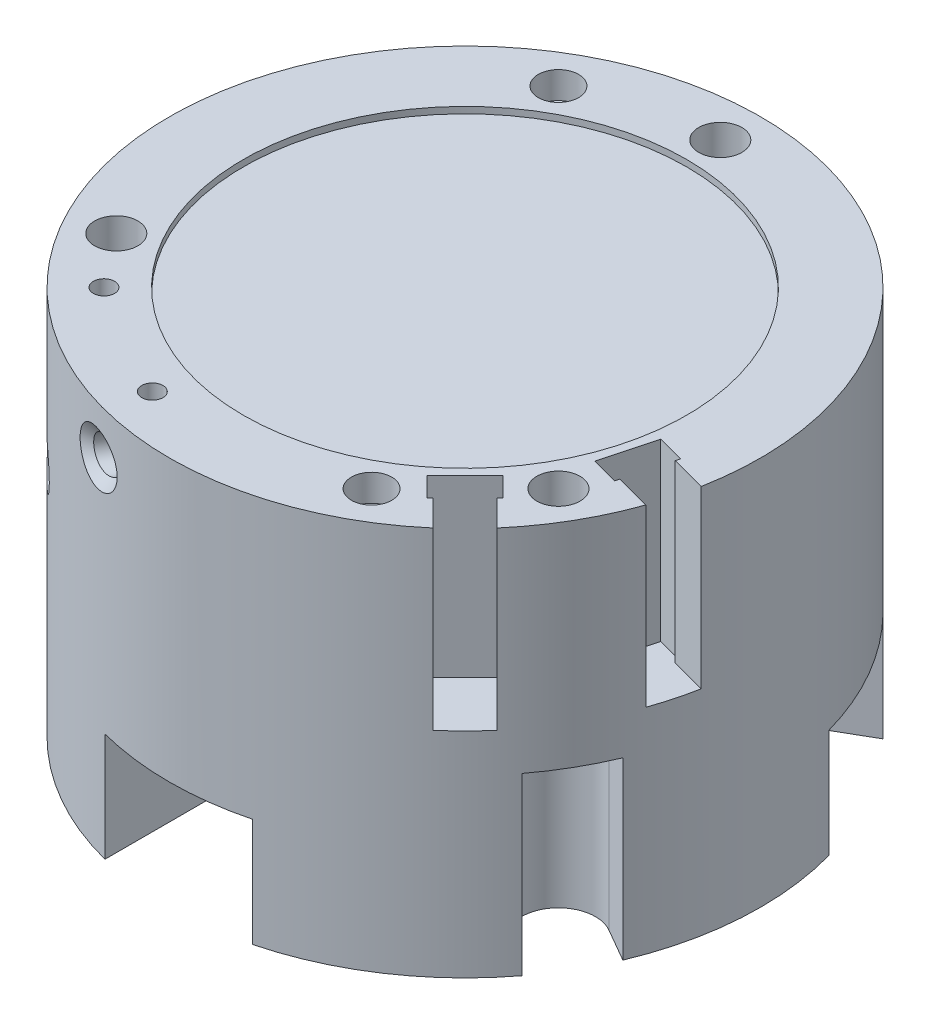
ISO-10303-21;
HEADER;
FILE_DESCRIPTION(('STEP AP214'),'2;1');
FILE_NAME('part.step','',(''),(''),'','','');
FILE_SCHEMA(('AUTOMOTIVE_DESIGN { 1 0 10303 214 1 1 1 1 }'));
ENDSEC;
DATA;
#1=APPLICATION_CONTEXT('core data for automotive mechanical design processes');
#2=APPLICATION_PROTOCOL_DEFINITION('international standard','automotive_design',2000,#1);
#3=PRODUCT_CONTEXT('',#1,'mechanical');
#4=PRODUCT('Part','Part','',(#3));
#5=PRODUCT_RELATED_PRODUCT_CATEGORY('part','',(#4));
#6=PRODUCT_DEFINITION_FORMATION('','',#4);
#7=PRODUCT_DEFINITION_CONTEXT('part definition',#1,'design');
#8=PRODUCT_DEFINITION('design','',#6,#7);
#9=PRODUCT_DEFINITION_SHAPE('','',#8);
#10=(LENGTH_UNIT() NAMED_UNIT(*) SI_UNIT(.MILLI.,.METRE.));
#11=(NAMED_UNIT(*) PLANE_ANGLE_UNIT() SI_UNIT($,.RADIAN.));
#12=(NAMED_UNIT(*) SI_UNIT($,.STERADIAN.) SOLID_ANGLE_UNIT());
#13=UNCERTAINTY_MEASURE_WITH_UNIT(LENGTH_MEASURE(1.E-05),#10,'distance_accuracy_value','');
#14=(GEOMETRIC_REPRESENTATION_CONTEXT(3) GLOBAL_UNCERTAINTY_ASSIGNED_CONTEXT((#13)) GLOBAL_UNIT_ASSIGNED_CONTEXT((#10,
#11,#12)) REPRESENTATION_CONTEXT('',''));
#15=CARTESIAN_POINT('',(0.,0.,0.));
#16=DIRECTION('',(0.,0.,1.));
#17=DIRECTION('',(1.,0.,0.));
#18=AXIS2_PLACEMENT_3D('',#15,#16,#17);
#19=CARTESIAN_POINT('',(26.1214912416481,22.987,15.0812500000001));
#20=DIRECTION('',(0.,1.,0.));
#21=DIRECTION('',(0.,0.,1.));
#22=AXIS2_PLACEMENT_3D('',#19,#20,#21);
#23=CYLINDRICAL_SURFACE('',#22,2.5527);
#24=CARTESIAN_POINT('',(26.1214912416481,22.987,15.0812500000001));
#25=DIRECTION('',(0.,1.,0.));
#26=DIRECTION('',(0.,0.,1.));
#27=AXIS2_PLACEMENT_3D('',#24,#25,#26);
#28=CIRCLE('',#27,2.5527);
#29=CARTESIAN_POINT('',(26.1214912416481,22.987,17.6339500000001));
#30=VERTEX_POINT('',#29);
#31=EDGE_CURVE('E816',#30,#30,#28,.T.);
#32=ORIENTED_EDGE('',*,*,#31,.T.);
#33=EDGE_LOOP('',(#32));
#34=FACE_BOUND('',#33,.T.);
#35=CARTESIAN_POINT('',(26.1214912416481,-2.286,15.0812500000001));
#36=DIRECTION('',(0.,-1.,0.));
#37=DIRECTION('',(0.,0.,-1.));
#38=AXIS2_PLACEMENT_3D('',#35,#36,#37);
#39=CIRCLE('',#38,2.5527);
#40=CARTESIAN_POINT('',(26.1214912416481,-2.286,12.5285500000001));
#41=VERTEX_POINT('',#40);
#42=EDGE_CURVE('E47',#41,#41,#39,.F.);
#43=ORIENTED_EDGE('',*,*,#42,.F.);
#44=EDGE_LOOP('',(#43));
#45=FACE_BOUND('',#44,.T.);
#46=ADVANCED_FACE('F40',(#34,#45),#23,.F.);
#47=CARTESIAN_POINT('',(-26.1214912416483,22.987,15.0812499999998));
#48=DIRECTION('',(0.,1.,0.));
#49=DIRECTION('',(0.,0.,1.));
#50=AXIS2_PLACEMENT_3D('',#47,#48,#49);
#51=CYLINDRICAL_SURFACE('',#50,2.5527);
#52=CARTESIAN_POINT('',(-26.1214912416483,22.987,15.0812499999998));
#53=DIRECTION('',(0.,1.,0.));
#54=DIRECTION('',(0.,0.,1.));
#55=AXIS2_PLACEMENT_3D('',#52,#53,#54);
#56=CIRCLE('',#55,2.5527);
#57=CARTESIAN_POINT('',(-26.1214912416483,22.987,17.6339499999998));
#58=VERTEX_POINT('',#57);
#59=EDGE_CURVE('E818',#58,#58,#56,.T.);
#60=ORIENTED_EDGE('',*,*,#59,.T.);
#61=EDGE_LOOP('',(#60));
#62=FACE_BOUND('',#61,.T.);
#63=CARTESIAN_POINT('',(-26.1214912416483,-2.286,15.0812499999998));
#64=DIRECTION('',(0.,-1.,0.));
#65=DIRECTION('',(0.,0.,-1.));
#66=AXIS2_PLACEMENT_3D('',#63,#64,#65);
#67=CIRCLE('',#66,2.5527);
#68=CARTESIAN_POINT('',(-26.1214912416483,-2.286,12.5285499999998));
#69=VERTEX_POINT('',#68);
#70=EDGE_CURVE('E438',#69,#69,#67,.F.);
#71=ORIENTED_EDGE('',*,*,#70,.F.);
#72=EDGE_LOOP('',(#71));
#73=FACE_BOUND('',#72,.T.);
#74=ADVANCED_FACE('F732',(#62,#73),#51,.F.);
#75=CARTESIAN_POINT('',(0.,22.987,-30.1625));
#76=DIRECTION('',(0.,1.,0.));
#77=DIRECTION('',(0.,0.,1.));
#78=AXIS2_PLACEMENT_3D('',#75,#76,#77);
#79=CYLINDRICAL_SURFACE('',#78,2.5527);
#80=CARTESIAN_POINT('',(0.,22.987,-30.1625));
#81=DIRECTION('',(0.,1.,0.));
#82=DIRECTION('',(0.,0.,1.));
#83=AXIS2_PLACEMENT_3D('',#80,#81,#82);
#84=CIRCLE('',#83,2.5527);
#85=CARTESIAN_POINT('',(0.,22.987,-27.6098));
#86=VERTEX_POINT('',#85);
#87=EDGE_CURVE('E798',#86,#86,#84,.T.);
#88=ORIENTED_EDGE('',*,*,#87,.T.);
#89=EDGE_LOOP('',(#88));
#90=FACE_BOUND('',#89,.T.);
#91=CARTESIAN_POINT('',(0.,-2.286,-30.1625));
#92=DIRECTION('',(0.,-1.,0.));
#93=DIRECTION('',(0.,0.,-1.));
#94=AXIS2_PLACEMENT_3D('',#91,#92,#93);
#95=CIRCLE('',#94,2.5527);
#96=CARTESIAN_POINT('',(0.,-2.286,-32.7152));
#97=VERTEX_POINT('',#96);
#98=EDGE_CURVE('E467',#97,#97,#95,.F.);
#99=ORIENTED_EDGE('',*,*,#98,.F.);
#100=EDGE_LOOP('',(#99));
#101=FACE_BOUND('',#100,.T.);
#102=ADVANCED_FACE('F738',(#90,#101),#79,.F.);
#103=CARTESIAN_POINT('',(0.,-22.987,0.));
#104=DIRECTION('',(0.,1.,0.));
#105=DIRECTION('',(0.,0.,1.));
#106=AXIS2_PLACEMENT_3D('',#103,#104,#105);
#107=PLANE('',#106);
#108=CARTESIAN_POINT('',(30.1625,-22.987,0.));
#109=DIRECTION('',(0.,-1.,0.));
#110=DIRECTION('',(0.,0.,-1.));
#111=AXIS2_PLACEMENT_3D('',#108,#109,#110);
#112=CIRCLE('',#111,1.7526);
#113=CARTESIAN_POINT('',(30.1625,-22.987,-1.7526));
#114=VERTEX_POINT('',#113);
#115=EDGE_CURVE('E364',#114,#114,#112,.T.);
#116=ORIENTED_EDGE('',*,*,#115,.F.);
#117=EDGE_LOOP('',(#116));
#118=FACE_BOUND('',#117,.T.);
#119=CARTESIAN_POINT('',(15.0812500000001,-22.987,26.1214912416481));
#120=DIRECTION('',(0.,-1.,0.));
#121=DIRECTION('',(0.,0.,-1.));
#122=AXIS2_PLACEMENT_3D('',#119,#120,#121);
#123=CIRCLE('',#122,1.7526);
#124=CARTESIAN_POINT('',(15.0812500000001,-22.987,24.3688912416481));
#125=VERTEX_POINT('',#124);
#126=EDGE_CURVE('E376',#125,#125,#123,.T.);
#127=ORIENTED_EDGE('',*,*,#126,.F.);
#128=EDGE_LOOP('',(#127));
#129=FACE_BOUND('',#128,.T.);
#130=CARTESIAN_POINT('',(0.,-22.987,0.));
#131=DIRECTION('',(0.,1.,0.));
#132=DIRECTION('',(0.,0.,1.));
#133=AXIS2_PLACEMENT_3D('',#130,#131,#132);
#134=CIRCLE('',#133,34.925);
#135=CARTESIAN_POINT('',(32.1927639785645,-22.987,13.5418452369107));
#136=VERTEX_POINT('',#135);
#137=CARTESIAN_POINT('',(33.6493721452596,-22.987,-9.35282733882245));
#138=VERTEX_POINT('',#137);
#139=EDGE_CURVE('E801',#136,#138,#134,.T.);
#140=ORIENTED_EDGE('',*,*,#139,.F.);
#141=DIRECTION('',(0.866025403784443,0.,0.499999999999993));
#142=VECTOR('',#141,1.);
#143=CARTESIAN_POINT('',(32.1927639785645,-22.987,13.5418452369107));
#144=LINE('',#143,#142);
#145=CARTESIAN_POINT('',(28.3058912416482,-22.987,11.2977582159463));
#146=VERTEX_POINT('',#145);
#147=EDGE_CURVE('E395',#146,#136,#144,.T.);
#148=ORIENTED_EDGE('',*,*,#147,.F.);
#149=CARTESIAN_POINT('',(26.1214912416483,-22.987,15.0812499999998));
#150=DIRECTION('',(0.,-1.,0.));
#151=DIRECTION('',(-0.866025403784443,0.,-0.499999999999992));
#152=AXIS2_PLACEMENT_3D('',#149,#150,#151);
#153=CIRCLE('',#152,4.3688);
#154=CARTESIAN_POINT('',(23.9370912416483,-22.987,18.8647417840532));
#155=VERTEX_POINT('',#154);
#156=EDGE_CURVE('E404',#155,#146,#153,.T.);
#157=ORIENTED_EDGE('',*,*,#156,.F.);
#158=DIRECTION('',(-0.866025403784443,0.,-0.499999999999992));
#159=VECTOR('',#158,1.);
#160=CARTESIAN_POINT('',(27.8239639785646,-22.987,21.1088288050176));
#161=LINE('',#160,#159);
#162=CARTESIAN_POINT('',(27.8239639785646,-22.987,21.1088288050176));
#163=VERTEX_POINT('',#162);
#164=EDGE_CURVE('E391',#163,#155,#161,.T.);
#165=ORIENTED_EDGE('',*,*,#164,.F.);
#166=CARTESIAN_POINT('',(8.72489999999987,-22.987,33.8176247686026));
#167=VERTEX_POINT('',#166);
#168=EDGE_CURVE('E796',#167,#163,#134,.T.);
#169=ORIENTED_EDGE('',*,*,#168,.F.);
#170=DIRECTION('',(0.,0.,1.));
#171=VECTOR('',#170,1.);
#172=CARTESIAN_POINT('',(8.72489999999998,-22.987,5.03732336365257));
#173=LINE('',#172,#171);
#174=CARTESIAN_POINT('',(8.72489999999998,-22.987,5.03732336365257));
#175=VERTEX_POINT('',#174);
#176=EDGE_CURVE('E477',#175,#167,#173,.T.);
#177=ORIENTED_EDGE('',*,*,#176,.F.);
#178=DIRECTION('',(-0.866025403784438,0.,0.500000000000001));
#179=VECTOR('',#178,1.);
#180=CARTESIAN_POINT('',(8.72489999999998,-22.987,5.03732336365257));
#181=LINE('',#180,#179);
#182=EDGE_CURVE('E511',#138,#175,#181,.T.);
#183=ORIENTED_EDGE('',*,*,#182,.F.);
#184=EDGE_LOOP('',(#140,#148,#157,#165,#169,#177,#183));
#185=FACE_BOUND('',#184,.T.);
#186=ADVANCED_FACE('F747',(#118,#129,#185),#107,.F.);
#187=CARTESIAN_POINT('',(-15.0812500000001,-22.987,-26.1214912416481));
#188=DIRECTION('',(0.,-1.,0.));
#189=DIRECTION('',(0.,0.,-1.));
#190=AXIS2_PLACEMENT_3D('',#187,#188,#189);
#191=CIRCLE('',#190,1.7526);
#192=CARTESIAN_POINT('',(-15.0812500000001,-22.987,-27.8740912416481));
#193=VERTEX_POINT('',#192);
#194=EDGE_CURVE('E340',#193,#193,#191,.T.);
#195=ORIENTED_EDGE('',*,*,#194,.F.);
#196=EDGE_LOOP('',(#195));
#197=FACE_BOUND('',#196,.T.);
#198=CARTESIAN_POINT('',(15.0812500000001,-22.987,-26.1214912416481));
#199=DIRECTION('',(0.,-1.,0.));
#200=DIRECTION('',(0.,0.,-1.));
#201=AXIS2_PLACEMENT_3D('',#198,#199,#200);
#202=CIRCLE('',#201,1.7526);
#203=CARTESIAN_POINT('',(15.0812500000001,-22.987,-27.8740912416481));
#204=VERTEX_POINT('',#203);
#205=EDGE_CURVE('E352',#204,#204,#202,.T.);
#206=ORIENTED_EDGE('',*,*,#205,.F.);
#207=EDGE_LOOP('',(#206));
#208=FACE_BOUND('',#207,.T.);
#209=CARTESIAN_POINT('',(-4.36879999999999,-22.987,-34.6506740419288));
#210=VERTEX_POINT('',#209);
#211=CARTESIAN_POINT('',(-24.9244721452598,-22.987,-24.46479742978));
#212=VERTEX_POINT('',#211);
#213=EDGE_CURVE('E807',#210,#212,#134,.T.);
#214=ORIENTED_EDGE('',*,*,#213,.F.);
#215=DIRECTION('',(0.,0.,-1.));
#216=VECTOR('',#215,1.);
#217=CARTESIAN_POINT('',(-4.36879999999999,-22.987,-34.6506740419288));
#218=LINE('',#217,#216);
#219=CARTESIAN_POINT('',(-4.3688,-22.987,-30.1625));
#220=VERTEX_POINT('',#219);
#221=EDGE_CURVE('E448',#220,#210,#218,.T.);
#222=ORIENTED_EDGE('',*,*,#221,.F.);
#223=CARTESIAN_POINT('',(0.,-22.987,-30.1625));
#224=DIRECTION('',(0.,-1.,0.));
#225=DIRECTION('',(0.,0.,1.));
#226=AXIS2_PLACEMENT_3D('',#223,#224,#225);
#227=CIRCLE('',#226,4.3688);
#228=CARTESIAN_POINT('',(4.3688,-22.987,-30.1625));
#229=VERTEX_POINT('',#228);
#230=EDGE_CURVE('E460',#229,#220,#227,.T.);
#231=ORIENTED_EDGE('',*,*,#230,.F.);
#232=DIRECTION('',(0.,0.,1.));
#233=VECTOR('',#232,1.);
#234=CARTESIAN_POINT('',(4.3688,-22.987,-34.6506740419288));
#235=LINE('',#234,#233);
#236=CARTESIAN_POINT('',(4.3688,-22.987,-34.6506740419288));
#237=VERTEX_POINT('',#236);
#238=EDGE_CURVE('E457',#237,#229,#235,.T.);
#239=ORIENTED_EDGE('',*,*,#238,.F.);
#240=CARTESIAN_POINT('',(24.9244721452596,-22.987,-24.4647974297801));
#241=VERTEX_POINT('',#240);
#242=EDGE_CURVE('E802',#241,#237,#134,.T.);
#243=ORIENTED_EDGE('',*,*,#242,.F.);
#244=DIRECTION('',(0.866025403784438,0.,-0.500000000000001));
#245=VECTOR('',#244,1.);
#246=CARTESIAN_POINT('',(0.,-22.987,-10.0746467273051));
#247=LINE('',#246,#245);
#248=CARTESIAN_POINT('',(0.,-22.987,-10.0746467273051));
#249=VERTEX_POINT('',#248);
#250=EDGE_CURVE('E509',#249,#241,#247,.T.);
#251=ORIENTED_EDGE('',*,*,#250,.F.);
#252=DIRECTION('',(0.866025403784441,0.,0.499999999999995));
#253=VECTOR('',#252,1.);
#254=CARTESIAN_POINT('',(0.,-22.987,-10.0746467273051));
#255=LINE('',#254,#253);
#256=EDGE_CURVE('E506',#212,#249,#255,.T.);
#257=ORIENTED_EDGE('',*,*,#256,.F.);
#258=EDGE_LOOP('',(#214,#222,#231,#239,#243,#251,#257));
#259=FACE_BOUND('',#258,.T.);
#260=ADVANCED_FACE('F759',(#197,#208,#259),#107,.F.);
#261=CARTESIAN_POINT('',(0.,22.987,0.));
#262=DIRECTION('',(0.,-1.,0.));
#263=DIRECTION('',(0.,0.,-1.));
#264=AXIS2_PLACEMENT_3D('',#261,#262,#263);
#265=CYLINDRICAL_SURFACE('',#264,34.925);
#266=CARTESIAN_POINT('',(0.,-2.286,0.));
#267=DIRECTION('',(0.,-1.,0.));
#268=DIRECTION('',(0.866025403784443,0.,0.499999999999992));
#269=AXIS2_PLACEMENT_3D('',#266,#267,#268);
#270=CIRCLE('',#269,34.925);
#271=CARTESIAN_POINT('',(32.1927639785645,-2.286,13.5418452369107));
#272=VERTEX_POINT('',#271);
#273=CARTESIAN_POINT('',(27.8239639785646,-2.286,21.1088288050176));
#274=VERTEX_POINT('',#273);
#275=EDGE_CURVE('E392',#272,#274,#270,.T.);
#276=ORIENTED_EDGE('',*,*,#275,.F.);
#277=DIRECTION('',(0.,-1.,0.));
#278=VECTOR('',#277,1.);
#279=CARTESIAN_POINT('',(32.1927639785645,-2.286,13.5418452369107));
#280=LINE('',#279,#278);
#281=EDGE_CURVE('E408',#272,#136,#280,.T.);
#282=ORIENTED_EDGE('',*,*,#281,.T.);
#283=ORIENTED_EDGE('',*,*,#139,.T.);
#284=DIRECTION('',(0.,-1.,0.));
#285=VECTOR('',#284,1.);
#286=CARTESIAN_POINT('',(33.6493721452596,-10.1727,-9.35282733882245));
#287=LINE('',#286,#285);
#288=CARTESIAN_POINT('',(33.6493721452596,-10.1727,-9.35282733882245));
#289=VERTEX_POINT('',#288);
#290=EDGE_CURVE('E524',#289,#138,#287,.T.);
#291=ORIENTED_EDGE('',*,*,#290,.F.);
#292=CARTESIAN_POINT('',(0.,-10.1727,0.));
#293=DIRECTION('',(0.,-1.,0.));
#294=DIRECTION('',(0.,0.,-1.));
#295=AXIS2_PLACEMENT_3D('',#292,#293,#294);
#296=CIRCLE('',#295,34.925);
#297=CARTESIAN_POINT('',(24.9244721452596,-10.1727,-24.4647974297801));
#298=VERTEX_POINT('',#297);
#299=EDGE_CURVE('E489',#298,#289,#296,.T.);
#300=ORIENTED_EDGE('',*,*,#299,.F.);
#301=DIRECTION('',(0.,-1.,0.));
#302=VECTOR('',#301,1.);
#303=CARTESIAN_POINT('',(24.9244721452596,-10.1727,-24.4647974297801));
#304=LINE('',#303,#302);
#305=EDGE_CURVE('E527',#298,#241,#304,.T.);
#306=ORIENTED_EDGE('',*,*,#305,.T.);
#307=ORIENTED_EDGE('',*,*,#242,.T.);
#308=DIRECTION('',(0.,-1.,0.));
#309=VECTOR('',#308,1.);
#310=CARTESIAN_POINT('',(4.3688,-2.286,-34.6506740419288));
#311=LINE('',#310,#309);
#312=CARTESIAN_POINT('',(4.3688,-2.286,-34.6506740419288));
#313=VERTEX_POINT('',#312);
#314=EDGE_CURVE('E456',#313,#237,#311,.T.);
#315=ORIENTED_EDGE('',*,*,#314,.F.);
#316=CARTESIAN_POINT('',(0.,-2.286,0.));
#317=DIRECTION('',(0.,-1.,0.));
#318=DIRECTION('',(0.,0.,-1.));
#319=AXIS2_PLACEMENT_3D('',#316,#317,#318);
#320=CIRCLE('',#319,34.925);
#321=CARTESIAN_POINT('',(-4.36879999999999,-2.286,-34.6506740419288));
#322=VERTEX_POINT('',#321);
#323=EDGE_CURVE('E444',#322,#313,#320,.T.);
#324=ORIENTED_EDGE('',*,*,#323,.F.);
#325=DIRECTION('',(0.,-1.,0.));
#326=VECTOR('',#325,1.);
#327=CARTESIAN_POINT('',(-4.36879999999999,-2.286,-34.6506740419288));
#328=LINE('',#327,#326);
#329=EDGE_CURVE('E464',#322,#210,#328,.T.);
#330=ORIENTED_EDGE('',*,*,#329,.T.);
#331=ORIENTED_EDGE('',*,*,#213,.T.);
#332=DIRECTION('',(0.,-1.,0.));
#333=VECTOR('',#332,1.);
#334=CARTESIAN_POINT('',(-24.9244721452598,-10.1727,-24.46479742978));
#335=LINE('',#334,#333);
#336=CARTESIAN_POINT('',(-24.9244721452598,-10.1727,-24.46479742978));
#337=VERTEX_POINT('',#336);
#338=EDGE_CURVE('E532',#337,#212,#335,.T.);
#339=ORIENTED_EDGE('',*,*,#338,.F.);
#340=CARTESIAN_POINT('',(0.,-10.1727,0.));
#341=DIRECTION('',(0.,-1.,0.));
#342=DIRECTION('',(0.,0.,-1.));
#343=AXIS2_PLACEMENT_3D('',#340,#341,#342);
#344=CIRCLE('',#343,34.925);
#345=CARTESIAN_POINT('',(-33.6493721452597,-10.1727,-9.35282733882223));
#346=VERTEX_POINT('',#345);
#347=EDGE_CURVE('E480',#346,#337,#344,.T.);
#348=ORIENTED_EDGE('',*,*,#347,.F.);
#349=DIRECTION('',(0.,-1.,0.));
#350=VECTOR('',#349,1.);
#351=CARTESIAN_POINT('',(-33.6493721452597,-10.1727,-9.35282733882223));
#352=LINE('',#351,#350);
#353=CARTESIAN_POINT('',(-33.6493721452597,-22.987,-9.35282733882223));
#354=VERTEX_POINT('',#353);
#355=EDGE_CURVE('E535',#346,#354,#352,.T.);
#356=ORIENTED_EDGE('',*,*,#355,.T.);
#357=CARTESIAN_POINT('',(-32.1927639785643,-22.987,13.5418452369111));
#358=VERTEX_POINT('',#357);
#359=EDGE_CURVE('E808',#354,#358,#134,.T.);
#360=ORIENTED_EDGE('',*,*,#359,.T.);
#361=DIRECTION('',(0.,-1.,0.));
#362=VECTOR('',#361,1.);
#363=CARTESIAN_POINT('',(-32.1927639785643,-2.286,13.5418452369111));
#364=LINE('',#363,#362);
#365=CARTESIAN_POINT('',(-32.1927639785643,-2.286,13.5418452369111));
#366=VERTEX_POINT('',#365);
#367=EDGE_CURVE('E67',#366,#358,#364,.T.);
#368=ORIENTED_EDGE('',*,*,#367,.F.);
#369=CARTESIAN_POINT('',(0.,-2.286,0.));
#370=DIRECTION('',(0.,-1.,0.));
#371=DIRECTION('',(-0.866025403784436,0.,0.500000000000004));
#372=AXIS2_PLACEMENT_3D('',#369,#370,#371);
#373=CIRCLE('',#372,34.925);
#374=CARTESIAN_POINT('',(-27.8239639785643,-2.286,21.108828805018));
#375=VERTEX_POINT('',#374);
#376=EDGE_CURVE('E416',#375,#366,#373,.T.);
#377=ORIENTED_EDGE('',*,*,#376,.F.);
#378=DIRECTION('',(0.,-1.,0.));
#379=VECTOR('',#378,1.);
#380=CARTESIAN_POINT('',(-27.8239639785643,-2.286,21.108828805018));
#381=LINE('',#380,#379);
#382=CARTESIAN_POINT('',(-27.8239639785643,-22.987,21.108828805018));
#383=VERTEX_POINT('',#382);
#384=EDGE_CURVE('E435',#375,#383,#381,.T.);
#385=ORIENTED_EDGE('',*,*,#384,.T.);
#386=CARTESIAN_POINT('',(-8.72490000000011,-22.987,33.8176247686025));
#387=VERTEX_POINT('',#386);
#388=EDGE_CURVE('E805',#383,#387,#134,.T.);
#389=ORIENTED_EDGE('',*,*,#388,.T.);
#390=DIRECTION('',(0.,-1.,0.));
#391=VECTOR('',#390,1.);
#392=CARTESIAN_POINT('',(-8.72490000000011,-10.1727,33.8176247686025));
#393=LINE('',#392,#391);
#394=CARTESIAN_POINT('',(-8.72490000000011,-10.1727,33.8176247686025));
#395=VERTEX_POINT('',#394);
#396=EDGE_CURVE('E515',#395,#387,#393,.T.);
#397=ORIENTED_EDGE('',*,*,#396,.F.);
#398=CARTESIAN_POINT('',(0.,-10.1727,0.));
#399=DIRECTION('',(0.,-1.,0.));
#400=DIRECTION('',(0.,0.,-1.));
#401=AXIS2_PLACEMENT_3D('',#398,#399,#400);
#402=CIRCLE('',#401,34.925);
#403=CARTESIAN_POINT('',(8.72489999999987,-10.1727,33.8176247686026));
#404=VERTEX_POINT('',#403);
#405=EDGE_CURVE('E498',#404,#395,#402,.T.);
#406=ORIENTED_EDGE('',*,*,#405,.F.);
#407=DIRECTION('',(0.,-1.,0.));
#408=VECTOR('',#407,1.);
#409=CARTESIAN_POINT('',(8.72489999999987,-10.1727,33.8176247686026));
#410=LINE('',#409,#408);
#411=EDGE_CURVE('E519',#404,#167,#410,.T.);
#412=ORIENTED_EDGE('',*,*,#411,.T.);
#413=ORIENTED_EDGE('',*,*,#168,.T.);
#414=DIRECTION('',(0.,-1.,0.));
#415=VECTOR('',#414,1.);
#416=CARTESIAN_POINT('',(27.8239639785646,-2.286,21.1088288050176));
#417=LINE('',#416,#415);
#418=EDGE_CURVE('E401',#274,#163,#417,.T.);
#419=ORIENTED_EDGE('',*,*,#418,.F.);
#420=EDGE_LOOP('',(#276,#282,#283,#291,#300,#306,#307,#315,#324,#330,#331,#339,#348,#356,#360,
#368,#377,#385,#389,#397,#406,#412,#413,#419));
#421=FACE_BOUND('',#420,.T.);
#422=CARTESIAN_POINT('',(0.,22.987,0.));
#423=DIRECTION('',(0.,1.,0.));
#424=DIRECTION('',(0.,0.,1.));
#425=AXIS2_PLACEMENT_3D('',#422,#423,#424);
#426=CIRCLE('',#425,34.925);
#427=CARTESIAN_POINT('',(34.3267249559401,22.987,6.43673665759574));
#428=VERTEX_POINT('',#427);
#429=CARTESIAN_POINT('',(22.7377399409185,22.987,26.5094475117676));
#430=VERTEX_POINT('',#429);
#431=EDGE_CURVE('E791',#428,#430,#426,.T.);
#432=ORIENTED_EDGE('',*,*,#431,.F.);
#433=DIRECTION('',(0.,1.,0.));
#434=VECTOR('',#433,1.);
#435=CARTESIAN_POINT('',(34.3267249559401,2.286,6.43673665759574));
#436=LINE('',#435,#434);
#437=CARTESIAN_POINT('',(34.3267249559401,2.286,6.43673665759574));
#438=VERTEX_POINT('',#437);
#439=EDGE_CURVE('E592',#438,#428,#436,.T.);
#440=ORIENTED_EDGE('',*,*,#439,.F.);
#441=CARTESIAN_POINT('',(0.,2.286,0.));
#442=DIRECTION('',(0.,1.,0.));
#443=DIRECTION('',(0.500000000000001,0.,0.866025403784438));
#444=AXIS2_PLACEMENT_3D('',#441,#442,#443);
#445=CIRCLE('',#444,34.925);
#446=CARTESIAN_POINT('',(32.9461841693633,2.286,11.5889850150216));
#447=VERTEX_POINT('',#446);
#448=EDGE_CURVE('E550',#447,#438,#445,.T.);
#449=ORIENTED_EDGE('',*,*,#448,.F.);
#450=DIRECTION('',(0.,1.,0.));
#451=VECTOR('',#450,1.);
#452=CARTESIAN_POINT('',(32.9461841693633,2.286,11.5889850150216));
#453=LINE('',#452,#451);
#454=CARTESIAN_POINT('',(32.9461841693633,22.987,11.5889850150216));
#455=VERTEX_POINT('',#454);
#456=EDGE_CURVE('E594',#447,#455,#453,.T.);
#457=ORIENTED_EDGE('',*,*,#456,.T.);
#458=CARTESIAN_POINT('',(26.5094475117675,22.987,22.7377399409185));
#459=VERTEX_POINT('',#458);
#460=EDGE_CURVE('E788',#459,#455,#426,.T.);
#461=ORIENTED_EDGE('',*,*,#460,.F.);
#462=DIRECTION('',(0.,1.,0.));
#463=VECTOR('',#462,1.);
#464=CARTESIAN_POINT('',(26.5094475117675,2.286,22.7377399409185));
#465=LINE('',#464,#463);
#466=CARTESIAN_POINT('',(26.5094475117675,2.286,22.7377399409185));
#467=VERTEX_POINT('',#466);
#468=EDGE_CURVE('E654',#467,#459,#465,.T.);
#469=ORIENTED_EDGE('',*,*,#468,.F.);
#470=CARTESIAN_POINT('',(0.,2.286,0.));
#471=DIRECTION('',(0.,1.,0.));
#472=DIRECTION('',(0.,0.,1.));
#473=AXIS2_PLACEMENT_3D('',#470,#471,#472);
#474=CIRCLE('',#473,34.925);
#475=CARTESIAN_POINT('',(22.7377399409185,2.286,26.5094475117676));
#476=VERTEX_POINT('',#475);
#477=EDGE_CURVE('E611',#476,#467,#474,.T.);
#478=ORIENTED_EDGE('',*,*,#477,.F.);
#479=DIRECTION('',(0.,1.,0.));
#480=VECTOR('',#479,1.);
#481=CARTESIAN_POINT('',(22.7377399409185,2.286,26.5094475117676));
#482=LINE('',#481,#480);
#483=EDGE_CURVE('E656',#476,#430,#482,.T.);
#484=ORIENTED_EDGE('',*,*,#483,.T.);
#485=EDGE_LOOP('',(#432,#440,#449,#457,#461,#469,#478,#484));
#486=FACE_BOUND('',#485,.T.);
#487=CARTESIAN_POINT('',(-6.84758372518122,17.272,34.2471345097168));
#488=CARTESIAN_POINT('',(-6.847545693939,17.3233646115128,34.2471431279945));
#489=CARTESIAN_POINT('',(-6.84894067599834,17.3747273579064,34.2468758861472));
#490=CARTESIAN_POINT('',(-6.85453446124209,17.477201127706,34.2457911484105));
#491=CARTESIAN_POINT('',(-6.85872817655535,17.5283124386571,34.2449746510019));
#492=CARTESIAN_POINT('',(-6.86985206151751,17.6301728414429,34.2427939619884));
#493=CARTESIAN_POINT('',(-6.87677954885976,17.680922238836,34.2414303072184));
#494=CARTESIAN_POINT('',(-6.89330140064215,17.7819507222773,34.2381582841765));
#495=CARTESIAN_POINT('',(-6.90289495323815,17.832229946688,34.2362500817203));
#496=CARTESIAN_POINT('',(-6.92468064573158,17.932209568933,34.2318917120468));
#497=CARTESIAN_POINT('',(-6.93687337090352,17.981909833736,34.2294414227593));
#498=CARTESIAN_POINT('',(-6.96378938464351,18.0806232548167,34.2240015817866));
#499=CARTESIAN_POINT('',(-6.97851425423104,18.1296359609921,34.2210116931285));
#500=CARTESIAN_POINT('',(-7.01042697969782,18.22686596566,34.2144952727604));
#501=CARTESIAN_POINT('',(-7.02761708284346,18.2750824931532,34.2109682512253));
#502=CARTESIAN_POINT('',(-7.06439300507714,18.3706118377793,34.2033801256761));
#503=CARTESIAN_POINT('',(-7.08398147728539,18.4179235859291,34.1993184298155));
#504=CARTESIAN_POINT('',(-7.12548712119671,18.5115350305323,34.1906634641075));
#505=CARTESIAN_POINT('',(-7.14740715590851,18.5578333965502,34.1860695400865));
#506=CARTESIAN_POINT('',(-7.19350910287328,18.6493096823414,34.1763525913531));
#507=CARTESIAN_POINT('',(-7.21769395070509,18.6944860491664,34.1712288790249));
#508=CARTESIAN_POINT('',(-7.2682588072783,18.7836099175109,34.1604547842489));
#509=CARTESIAN_POINT('',(-7.29464173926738,18.8275556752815,34.1548036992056));
#510=CARTESIAN_POINT('',(-7.34953622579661,18.9141097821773,34.1429773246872));
#511=CARTESIAN_POINT('',(-7.37805065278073,18.9567162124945,34.1368013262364));
#512=CARTESIAN_POINT('',(-7.43714125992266,19.0404834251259,34.1239273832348));
#513=CARTESIAN_POINT('',(-7.46772026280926,19.0816421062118,34.1172287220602));
#514=CARTESIAN_POINT('',(-7.53087452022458,19.1624043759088,34.1033124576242));
#515=CARTESIAN_POINT('',(-7.56345258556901,19.2020056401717,34.0960941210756));
#516=CARTESIAN_POINT('',(-7.63053430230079,19.2795481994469,34.0811387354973));
#517=CARTESIAN_POINT('',(-7.66504080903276,19.3174868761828,34.0734009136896));
#518=CARTESIAN_POINT('',(-7.73592786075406,19.391582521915,34.0574172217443));
#519=CARTESIAN_POINT('',(-7.77231142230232,19.4277364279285,34.0491705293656));
#520=CARTESIAN_POINT('',(-7.84680604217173,19.4981824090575,34.0321461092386));
#521=CARTESIAN_POINT('',(-7.8849192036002,19.5324720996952,34.0233677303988));
#522=CARTESIAN_POINT('',(-7.96269014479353,19.5991747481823,34.0052711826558));
#523=CARTESIAN_POINT('',(-8.00234927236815,19.6315860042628,33.9959525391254));
#524=CARTESIAN_POINT('',(-8.08312253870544,19.6944781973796,33.9768009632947));
#525=CARTESIAN_POINT('',(-8.12423824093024,19.7249569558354,33.9669674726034));
#526=CARTESIAN_POINT('',(-8.20781649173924,19.7839478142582,33.9468010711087));
#527=CARTESIAN_POINT('',(-8.2502806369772,19.8124574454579,33.9364675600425));
#528=CARTESIAN_POINT('',(-8.33645279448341,19.86746885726,33.9153187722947));
#529=CARTESIAN_POINT('',(-8.38016232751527,19.8939680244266,33.9045028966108));
#530=CARTESIAN_POINT('',(-8.46872103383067,19.9449184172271,33.8824062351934));
#531=CARTESIAN_POINT('',(-8.51357157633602,19.9693670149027,33.8711248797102));
#532=CARTESIAN_POINT('',(-8.60430850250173,20.0161757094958,33.8481142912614));
#533=CARTESIAN_POINT('',(-8.65019606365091,20.0385332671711,33.8363845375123));
#534=CARTESIAN_POINT('',(-8.74290316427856,20.0811193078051,33.8124941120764));
#535=CARTESIAN_POINT('',(-8.78972367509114,20.1013454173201,33.8003329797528));
#536=CARTESIAN_POINT('',(-8.88419284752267,20.1396278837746,33.7755967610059));
#537=CARTESIAN_POINT('',(-8.93184228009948,20.1576820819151,33.7630212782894));
#538=CARTESIAN_POINT('',(-9.02786545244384,20.1915800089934,33.7374733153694));
#539=CARTESIAN_POINT('',(-9.07623978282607,20.2074218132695,33.7245005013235));
#540=CARTESIAN_POINT('',(-9.17360888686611,20.2368541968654,33.6981748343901));
#541=CARTESIAN_POINT('',(-9.22260409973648,20.2504430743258,33.6848217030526));
#542=CARTESIAN_POINT('',(-9.32111107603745,20.2753289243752,33.6577523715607));
#543=CARTESIAN_POINT('',(-9.37062315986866,20.2866243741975,33.6440359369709));
#544=CARTESIAN_POINT('',(-9.47005994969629,20.3068824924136,33.6162569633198));
#545=CARTESIAN_POINT('',(-9.51998488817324,20.3158437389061,33.6021942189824));
#546=CARTESIAN_POINT('',(-9.62014344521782,20.3313935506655,33.5737396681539));
#547=CARTESIAN_POINT('',(-9.67037723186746,20.3379806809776,33.5593476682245));
#548=CARTESIAN_POINT('',(-9.77104946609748,20.348739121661,33.5302514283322));
#549=CARTESIAN_POINT('',(-9.82148802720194,20.3529088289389,33.5155469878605));
#550=CARTESIAN_POINT('',(-9.92246599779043,20.3588019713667,33.4858435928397));
#551=CARTESIAN_POINT('',(-9.97300545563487,20.3605234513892,33.4708444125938));
#552=CARTESIAN_POINT('',(-10.0740354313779,20.3614426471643,33.4405795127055));
#553=CARTESIAN_POINT('',(-10.124525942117,20.3606400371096,33.4253137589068));
#554=CARTESIAN_POINT('',(-10.2253074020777,20.3565071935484,33.3945723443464));
#555=CARTESIAN_POINT('',(-10.2755984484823,20.353178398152,33.3790968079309));
#556=CARTESIAN_POINT('',(-10.3758763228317,20.3440408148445,33.3479827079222));
#557=CARTESIAN_POINT('',(-10.4258632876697,20.3382332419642,33.3323442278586));
#558=CARTESIAN_POINT('',(-10.5254277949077,20.3241729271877,33.3009503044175));
#559=CARTESIAN_POINT('',(-10.575005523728,20.3159213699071,33.2851949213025));
#560=CARTESIAN_POINT('',(-10.673646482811,20.2970110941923,33.2536134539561));
#561=CARTESIAN_POINT('',(-10.722709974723,20.2863536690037,33.2377874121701));
#562=CARTESIAN_POINT('',(-10.8202173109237,20.2626686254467,33.2061108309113));
#563=CARTESIAN_POINT('',(-10.868661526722,20.2496425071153,33.1902603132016));
#564=CARTESIAN_POINT('',(-10.9648251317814,20.2212571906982,33.1585810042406));
#565=CARTESIAN_POINT('',(-11.0125450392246,20.2058997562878,33.1427522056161));
#566=CARTESIAN_POINT('',(-11.1071548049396,20.1728888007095,33.1111625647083));
#567=CARTESIAN_POINT('',(-11.154045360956,20.1552373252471,33.095401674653));
#568=CARTESIAN_POINT('',(-11.2468911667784,20.1176752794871,33.0639940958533));
#569=CARTESIAN_POINT('',(-11.2928473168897,20.097767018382,33.0483473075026));
#570=CARTESIAN_POINT('',(-11.3837190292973,20.0557284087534,33.017214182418));
#571=CARTESIAN_POINT('',(-11.4286357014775,20.0336005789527,33.0017276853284));
#572=CARTESIAN_POINT('',(-11.5173231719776,19.9871598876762,32.9709614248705));
#573=CARTESIAN_POINT('',(-11.5610952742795,19.9628496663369,32.9556814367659));
#574=CARTESIAN_POINT('',(-11.6473883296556,19.9120813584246,32.9253743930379));
#575=CARTESIAN_POINT('',(-11.6899107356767,19.8856259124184,32.910347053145));
#576=CARTESIAN_POINT('',(-11.7735991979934,19.8306043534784,32.8805918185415));
#577=CARTESIAN_POINT('',(-11.8147667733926,19.8020407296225,32.8658635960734));
#578=CARTESIAN_POINT('',(-11.8956403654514,19.7428404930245,32.8367518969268));
#579=CARTESIAN_POINT('',(-11.9353478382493,19.7122060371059,32.8223680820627));
#580=CARTESIAN_POINT('',(-12.0131965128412,19.6489007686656,32.7939949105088));
#581=CARTESIAN_POINT('',(-12.0513389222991,19.6162315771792,32.7800052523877));
#582=CARTESIAN_POINT('',(-12.1259516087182,19.5488982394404,32.752453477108));
#583=CARTESIAN_POINT('',(-12.162422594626,19.5142349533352,32.7388911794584));
#584=CARTESIAN_POINT('',(-12.2335372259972,19.4429927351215,32.7123093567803));
#585=CARTESIAN_POINT('',(-12.2681834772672,19.4064166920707,32.6992890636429));
#586=CARTESIAN_POINT('',(-12.3355502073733,19.3314961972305,32.6738907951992));
#587=CARTESIAN_POINT('',(-12.3682752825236,19.2931563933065,32.6615112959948));
#588=CARTESIAN_POINT('',(-12.4317563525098,19.21482359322,32.6374100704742));
#589=CARTESIAN_POINT('',(-12.4625163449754,19.1748342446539,32.6256870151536));
#590=CARTESIAN_POINT('',(-12.5220250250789,19.0933128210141,32.6029307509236));
#591=CARTESIAN_POINT('',(-12.5507772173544,19.0517836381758,32.5918963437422));
#592=CARTESIAN_POINT('',(-12.6062276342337,18.9672939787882,32.5705450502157));
#593=CARTESIAN_POINT('',(-12.6329289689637,18.9243358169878,32.5602270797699));
#594=CARTESIAN_POINT('',(-12.6842349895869,18.8370991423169,32.540337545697));
#595=CARTESIAN_POINT('',(-12.7088424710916,18.7928225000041,32.5307649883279));
#596=CARTESIAN_POINT('',(-12.7559179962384,18.7030597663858,32.5123948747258));
#597=CARTESIAN_POINT('',(-12.778388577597,18.6575751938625,32.50359640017));
#598=CARTESIAN_POINT('',(-12.8211474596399,18.5655073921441,32.4868031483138));
#599=CARTESIAN_POINT('',(-12.8414380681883,18.5189253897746,32.4788075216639));
#600=CARTESIAN_POINT('',(-12.8797941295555,18.4247734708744,32.4636486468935));
#601=CARTESIAN_POINT('',(-12.8978616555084,18.377204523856,32.4564846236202));
#602=CARTESIAN_POINT('',(-12.9317286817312,18.2811894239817,32.4430176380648));
#603=CARTESIAN_POINT('',(-12.9475299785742,18.2327440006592,32.4367139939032));
#604=CARTESIAN_POINT('',(-12.9768217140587,18.1350866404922,32.4249964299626));
#605=CARTESIAN_POINT('',(-12.9903135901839,18.0858752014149,32.4195819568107));
#606=CARTESIAN_POINT('',(-13.0149437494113,17.9867964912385,32.4096713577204));
#607=CARTESIAN_POINT('',(-13.0260829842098,17.9369294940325,32.4051748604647));
#608=CARTESIAN_POINT('',(-13.0459651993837,17.8366503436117,32.3971288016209));
#609=CARTESIAN_POINT('',(-13.0547084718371,17.7862382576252,32.3935791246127));
#610=CARTESIAN_POINT('',(-13.0697564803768,17.6849795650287,32.3874551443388));
#611=CARTESIAN_POINT('',(-13.0760606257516,17.6341328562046,32.3848810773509));
#612=CARTESIAN_POINT('',(-13.0861875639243,17.5321155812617,32.3807369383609));
#613=CARTESIAN_POINT('',(-13.09000860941,17.4809448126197,32.3791675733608));
#614=CARTESIAN_POINT('',(-13.0951296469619,17.3783897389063,32.377060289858));
#615=CARTESIAN_POINT('',(-13.0964264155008,17.3270052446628,32.3765236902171));
#616=CARTESIAN_POINT('',(-13.0964488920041,17.2242123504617,32.3765131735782));
#617=CARTESIAN_POINT('',(-13.0951734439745,17.172803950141,32.3770397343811));
#618=CARTESIAN_POINT('',(-13.0900826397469,17.0701578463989,32.3791314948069));
#619=CARTESIAN_POINT('',(-13.086268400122,17.0189200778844,32.3806962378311));
#620=CARTESIAN_POINT('',(-13.0761491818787,16.9167314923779,32.3848333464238));
#621=CARTESIAN_POINT('',(-13.069844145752,16.8657806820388,32.3874057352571));
#622=CARTESIAN_POINT('',(-13.0547892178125,16.7642825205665,32.3935283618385));
#623=CARTESIAN_POINT('',(-13.0460384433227,16.7137353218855,32.3970789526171));
#624=CARTESIAN_POINT('',(-13.0261383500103,16.6131607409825,32.405128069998));
#625=CARTESIAN_POINT('',(-13.0149876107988,16.5631336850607,32.409627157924));
#626=CARTESIAN_POINT('',(-12.990333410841,16.4637157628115,32.4195435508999));
#627=CARTESIAN_POINT('',(-12.9768282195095,16.4143253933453,32.4249615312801));
#628=CARTESIAN_POINT('',(-12.9475107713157,16.3162972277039,32.4366860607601));
#629=CARTESIAN_POINT('',(-12.9316966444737,16.2676600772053,32.4429933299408));
#630=CARTESIAN_POINT('',(-12.8978068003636,16.1712547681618,32.4564668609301));
#631=CARTESIAN_POINT('',(-12.8797291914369,16.123487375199,32.4636338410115));
#632=CARTESIAN_POINT('',(-12.8413577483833,16.028938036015,32.478797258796));
#633=CARTESIAN_POINT('',(-12.8210620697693,15.9821569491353,32.486794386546));
#634=CARTESIAN_POINT('',(-12.7782997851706,15.889696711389,32.5035885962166));
#635=CARTESIAN_POINT('',(-12.7558314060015,15.8440184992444,32.5123863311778));
#636=CARTESIAN_POINT('',(-12.7087689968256,15.7538805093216,32.5307522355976));
#637=CARTESIAN_POINT('',(-12.6841732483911,15.7094217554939,32.5403210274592));
#638=CARTESIAN_POINT('',(-12.6329013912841,15.6218392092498,32.5601996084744));
#639=CARTESIAN_POINT('',(-12.6062235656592,15.5787165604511,32.5705100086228));
#640=CARTESIAN_POINT('',(-12.5508329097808,15.4939225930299,32.5918420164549));
#641=CARTESIAN_POINT('',(-12.5221182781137,15.4522526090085,32.6028642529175));
#642=CARTESIAN_POINT('',(-12.4626994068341,15.3704807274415,32.6255913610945));
#643=CARTESIAN_POINT('',(-12.4319931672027,15.3303804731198,32.637296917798));
#644=CARTESIAN_POINT('',(-12.3686367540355,15.251862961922,32.6613573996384));
#645=CARTESIAN_POINT('',(-12.335984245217,15.2134478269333,32.6737131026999));
#646=CARTESIAN_POINT('',(-12.268780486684,15.1384217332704,32.6990579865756));
#647=CARTESIAN_POINT('',(-12.2342264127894,15.1018136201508,32.7120481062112));
#648=CARTESIAN_POINT('',(-12.1633032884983,15.0305346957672,32.7385672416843));
#649=CARTESIAN_POINT('',(-12.1269325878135,14.9958657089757,32.7520967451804));
#650=CARTESIAN_POINT('',(-12.0525180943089,14.9285226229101,32.7795838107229));
#651=CARTESIAN_POINT('',(-12.0144736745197,14.8958492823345,32.7935415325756));
#652=CARTESIAN_POINT('',(-11.9368178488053,14.8325380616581,32.821852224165));
#653=CARTESIAN_POINT('',(-11.8972052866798,14.8019017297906,32.8362054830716));
#654=CARTESIAN_POINT('',(-11.8165193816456,14.7426987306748,32.8652571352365));
#655=CARTESIAN_POINT('',(-11.7754446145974,14.714134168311,32.8799558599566));
#656=CARTESIAN_POINT('',(-11.6919401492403,14.6591109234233,32.909653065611));
#657=CARTESIAN_POINT('',(-11.6495089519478,14.6326546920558,32.9246518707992));
#658=CARTESIAN_POINT('',(-11.5633973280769,14.5818840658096,32.954902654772));
#659=CARTESIAN_POINT('',(-11.51971546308,14.5575722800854,32.9701549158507));
#660=CARTESIAN_POINT('',(-11.4312080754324,14.5111268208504,33.0008663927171));
#661=CARTESIAN_POINT('',(-11.3863812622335,14.4889957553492,33.0163258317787));
#662=CARTESIAN_POINT('',(-11.2956894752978,14.4469481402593,33.0474053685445));
#663=CARTESIAN_POINT('',(-11.2498234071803,14.4270340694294,33.0630256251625));
#664=CARTESIAN_POINT('',(-11.1571585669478,14.3894569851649,33.094380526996));
#665=CARTESIAN_POINT('',(-11.1103589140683,14.3717962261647,33.1101152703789));
#666=CARTESIAN_POINT('',(-11.0159323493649,14.3387624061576,33.1416528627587));
#667=CARTESIAN_POINT('',(-10.9683047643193,14.3233913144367,33.1574557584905));
#668=CARTESIAN_POINT('',(-10.8723277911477,14.294973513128,33.1890833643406));
#669=CARTESIAN_POINT('',(-10.8239779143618,14.2819284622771,33.2049080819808));
#670=CARTESIAN_POINT('',(-10.7266618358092,14.2581995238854,33.2365330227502));
#671=CARTESIAN_POINT('',(-10.6776952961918,14.2475169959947,33.252333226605));
#672=CARTESIAN_POINT('',(-10.5792514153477,14.2285496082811,33.2838628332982));
#673=CARTESIAN_POINT('',(-10.5297738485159,14.2202658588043,33.2995922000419));
#674=CARTESIAN_POINT('',(-10.4304134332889,14.2061334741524,33.3309337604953));
#675=CARTESIAN_POINT('',(-10.3805304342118,14.2002857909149,33.346545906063));
#676=CARTESIAN_POINT('',(-10.2804648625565,14.1910591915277,33.3776068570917));
#677=CARTESIAN_POINT('',(-10.2302821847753,14.1876812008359,33.3930555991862));
#678=CARTESIAN_POINT('',(-10.1297224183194,14.1834413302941,33.4237428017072));
#679=CARTESIAN_POINT('',(-10.0793452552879,14.1825805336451,33.4389811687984));
#680=CARTESIAN_POINT('',(-9.9785320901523,14.1833703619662,33.4691951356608));
#681=CARTESIAN_POINT('',(-9.92809608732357,14.1850210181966,33.4841707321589));
#682=CARTESIAN_POINT('',(-9.82730052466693,14.19075736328,33.513835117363));
#683=CARTESIAN_POINT('',(-9.77694094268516,14.194842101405,33.5285240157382));
#684=CARTESIAN_POINT('',(-9.67640342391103,14.205419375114,33.557596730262));
#685=CARTESIAN_POINT('',(-9.62622543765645,14.2119111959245,33.571980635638));
#686=CARTESIAN_POINT('',(-9.52615649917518,14.2272618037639,33.6004259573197));
#687=CARTESIAN_POINT('',(-9.4762654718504,14.2361199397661,33.6144874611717));
#688=CARTESIAN_POINT('',(-9.37687579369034,14.2561662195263,33.6422703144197));
#689=CARTESIAN_POINT('',(-9.32737702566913,14.2673536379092,33.6559917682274));
#690=CARTESIAN_POINT('',(-9.22887724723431,14.2920206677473,33.6830768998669));
#691=CARTESIAN_POINT('',(-9.17987604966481,14.3054993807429,33.696440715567));
#692=CARTESIAN_POINT('',(-9.08247682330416,14.3347115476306,33.7227929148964));
#693=CARTESIAN_POINT('',(-9.03407850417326,14.3504438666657,33.7357814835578));
#694=CARTESIAN_POINT('',(-8.93799048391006,14.3841257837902,33.7613655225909));
#695=CARTESIAN_POINT('',(-8.89030035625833,14.4020739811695,33.7739612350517));
#696=CARTESIAN_POINT('',(-8.79573420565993,14.4401502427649,33.798741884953));
#697=CARTESIAN_POINT('',(-8.74885759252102,14.4602766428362,33.8109271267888));
#698=CARTESIAN_POINT('',(-8.6560239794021,14.5026718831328,33.8348691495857));
#699=CARTESIAN_POINT('',(-8.61006620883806,14.5249388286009,33.8466262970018));
#700=CARTESIAN_POINT('',(-8.5191758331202,14.5715777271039,33.8696944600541));
#701=CARTESIAN_POINT('',(-8.47424227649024,14.595947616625,33.8810058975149));
#702=CARTESIAN_POINT('',(-8.38550577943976,14.6467548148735,33.9031649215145));
#703=CARTESIAN_POINT('',(-8.3417017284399,14.6731899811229,33.9140129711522));
#704=CARTESIAN_POINT('',(-8.25533004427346,14.7280904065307,33.9352277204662));
#705=CARTESIAN_POINT('',(-8.21276119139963,14.7565535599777,33.9455949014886));
#706=CARTESIAN_POINT('',(-8.12896425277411,14.8154712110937,33.9658296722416));
#707=CARTESIAN_POINT('',(-8.08773492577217,14.8459237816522,33.9756977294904));
#708=CARTESIAN_POINT('',(-8.00672650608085,14.9087862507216,33.9949188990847));
#709=CARTESIAN_POINT('',(-7.96694627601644,14.9411945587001,34.0042724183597));
#710=CARTESIAN_POINT('',(-7.88892596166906,15.0079161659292,34.0224385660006));
#711=CARTESIAN_POINT('',(-7.85068503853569,15.0422284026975,34.0312514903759));
#712=CARTESIAN_POINT('',(-7.77593806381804,15.1127423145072,34.0483427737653));
#713=CARTESIAN_POINT('',(-7.73943021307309,15.1489419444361,34.0566216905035));
#714=CARTESIAN_POINT('',(-7.66830615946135,15.2231454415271,34.0726663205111));
#715=CARTESIAN_POINT('',(-7.63368695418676,15.2611462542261,34.0804328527));
#716=CARTESIAN_POINT('',(-7.56638979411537,15.3388263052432,34.0954424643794));
#717=CARTESIAN_POINT('',(-7.53370901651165,15.3785029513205,34.1026863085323));
#718=CARTESIAN_POINT('',(-7.47035833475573,15.4594267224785,34.1166507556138));
#719=CARTESIAN_POINT('',(-7.43968565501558,15.5006715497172,34.1233720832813));
#720=CARTESIAN_POINT('',(-7.3804155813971,15.5846191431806,34.1362888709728));
#721=CARTESIAN_POINT('',(-7.35181538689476,15.6273198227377,34.1424850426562));
#722=CARTESIAN_POINT('',(-7.29675620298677,15.7140679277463,34.1543496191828));
#723=CARTESIAN_POINT('',(-7.27029433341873,15.7581134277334,34.1600187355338));
#724=CARTESIAN_POINT('',(-7.21957739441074,15.8474396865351,34.1708270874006));
#725=CARTESIAN_POINT('',(-7.19531934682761,15.8927186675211,34.1759670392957));
#726=CARTESIAN_POINT('',(-7.14907576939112,15.9844005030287,34.185714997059));
#727=CARTESIAN_POINT('',(-7.12708718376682,16.0308017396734,34.1903237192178));
#728=CARTESIAN_POINT('',(-7.08544820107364,16.1246166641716,34.1990071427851));
#729=CARTESIAN_POINT('',(-7.06579473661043,16.17202892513,34.2030825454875));
#730=CARTESIAN_POINT('',(-7.02889160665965,16.267754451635,34.2106972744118));
#731=CARTESIAN_POINT('',(-7.01163897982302,16.3160665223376,34.2142372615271));
#732=CARTESIAN_POINT('',(-6.9796030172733,16.4134801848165,34.2207791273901));
#733=CARTESIAN_POINT('',(-6.96481700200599,16.4625808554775,34.2237815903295));
#734=CARTESIAN_POINT('',(-6.93777956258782,16.5614601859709,34.2292464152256));
#735=CARTESIAN_POINT('',(-6.92552598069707,16.6112382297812,34.2317092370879));
#736=CARTESIAN_POINT('',(-6.90361851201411,16.7113607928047,34.2360928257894));
#737=CARTESIAN_POINT('',(-6.89396329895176,16.761705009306,34.2380138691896));
#738=CARTESIAN_POINT('',(-6.87731717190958,16.8628482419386,34.2413120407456));
#739=CARTESIAN_POINT('',(-6.87032614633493,16.9136472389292,34.2426891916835));
#740=CARTESIAN_POINT('',(-6.85907329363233,17.0155890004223,34.2448976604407));
#741=CARTESIAN_POINT('',(-6.85481302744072,17.0667319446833,34.2457286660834));
#742=CARTESIAN_POINT('',(-6.84908356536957,17.1692484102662,34.2468434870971));
#743=CARTESIAN_POINT('',(-6.84761812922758,17.2206221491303,34.2471265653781));
#744=CARTESIAN_POINT('',(-6.84758372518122,17.272,34.2471345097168));
#745=B_SPLINE_CURVE_WITH_KNOTS('',3,(#487,#488,#489,#490,#491,#492,#493,#494,#495,#496,#497,
#498,#499,#500,#501,#502,#503,#504,#505,#506,#507,#508,#509,#510,#511,#512,#513,#514,#515,#516,
#517,#518,#519,#520,#521,#522,#523,#524,#525,#526,#527,#528,#529,#530,#531,#532,#533,#534,#535,
#536,#537,#538,#539,#540,#541,#542,#543,#544,#545,#546,#547,#548,#549,#550,#551,#552,#553,#554,
#555,#556,#557,#558,#559,#560,#561,#562,#563,#564,#565,#566,#567,#568,#569,#570,#571,#572,#573,
#574,#575,#576,#577,#578,#579,#580,#581,#582,#583,#584,#585,#586,#587,#588,#589,#590,#591,#592,
#593,#594,#595,#596,#597,#598,#599,#600,#601,#602,#603,#604,#605,#606,#607,#608,#609,#610,#611,
#612,#613,#614,#615,#616,#617,#618,#619,#620,#621,#622,#623,#624,#625,#626,#627,#628,#629,#630,
#631,#632,#633,#634,#635,#636,#637,#638,#639,#640,#641,#642,#643,#644,#645,#646,#647,#648,#649,
#650,#651,#652,#653,#654,#655,#656,#657,#658,#659,#660,#661,#662,#663,#664,#665,#666,#667,#668,
#669,#670,#671,#672,#673,#674,#675,#676,#677,#678,#679,#680,#681,#682,#683,#684,#685,#686,#687,
#688,#689,#690,#691,#692,#693,#694,#695,#696,#697,#698,#699,#700,#701,#702,#703,#704,#705,#706,
#707,#708,#709,#710,#711,#712,#713,#714,#715,#716,#717,#718,#719,#720,#721,#722,#723,#724,#725,
#726,#727,#728,#729,#730,#731,#732,#733,#734,#735,#736,#737,#738,#739,#740,#741,#742,#743,#744),
.UNSPECIFIED.,.F.,.F.,(4,2,2,2,2,2,2,2,2,2,2,2,2,2,2,2,2,2,2,2,2,2,2,2,2,2,2,2,2,2,2,2,2,2,2,2,
2,2,2,2,2,2,2,2,2,2,2,2,2,2,2,2,2,2,2,2,2,2,2,2,2,2,2,2,2,2,2,2,2,2,2,2,2,2,2,2,2,2,2,2,2,2,2,2,
2,2,2,2,2,2,2,2,2,2,2,2,2,2,2,2,2,2,2,2,2,2,2,2,2,2,2,2,2,2,2,2,2,2,2,2,2,2,2,2,2,2,2,2,4),(0.,
0.154068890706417,0.307858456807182,0.461497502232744,0.61508981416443,0.768716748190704,
0.922439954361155,1.07630419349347,1.23034020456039,1.38456759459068,1.53899773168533,
1.69363662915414,1.84848781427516,2.0035551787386,2.15884580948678,2.31437279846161,
2.47015802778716,2.6261380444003,2.78225723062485,2.9385493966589,3.09503408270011,
3.25171881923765,3.40860138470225,3.5656720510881,3.72291581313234,3.88031460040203,
4.03784947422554,4.1955028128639,4.3532604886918,4.51111404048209,4.66906284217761,
4.82711626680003,4.98529584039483,5.14349583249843,5.30160583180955,5.45963841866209,
5.61759453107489,5.77546593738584,5.93323771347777,6.09089072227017,6.24840409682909,
6.4057577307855,6.5629347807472,6.71992418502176,6.87672320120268,7.03333996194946,
7.18979604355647,7.3461290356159,7.50239509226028,7.65843158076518,7.81407811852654,
7.96939721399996,8.12443804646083,8.27923891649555,8.43382975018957,8.58823464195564,
8.74247442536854,8.89656926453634,9.05054126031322,9.20441706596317,9.35823050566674,
9.51202518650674,9.66585709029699,9.81979712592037,9.97393361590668,10.1281393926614,
10.2822773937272,10.4364189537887,10.5906162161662,10.7449049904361,10.8993076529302,
11.0538360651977,11.2084944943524,11.3632825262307,11.5181979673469,11.6732397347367,
11.82841073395,11.9837207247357,12.1391891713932,12.2948480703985,12.4507447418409,
12.6067857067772,12.7628856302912,12.9191028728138,13.0754766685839,13.232029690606,
13.3887706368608,13.5456968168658,13.702796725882,13.8600526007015,14.0174429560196,
14.1749451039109,14.3325376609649,14.4902030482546,14.647929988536,14.805716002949,
14.963569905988,15.1214257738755,15.2792200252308,15.4369674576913,15.59467153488,
15.7523265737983,15.9099199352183,16.0674342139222,16.2248494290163,16.3821452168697,
16.5393030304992,16.6963083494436,16.8531529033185,17.0098369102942,17.1663713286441,
17.3227801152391,17.4791024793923,17.635258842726,17.7911592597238,17.9468267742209,
18.1022743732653,18.2575078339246,18.4125285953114,18.5673366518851,18.7219334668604,
18.8763249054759,19.0305241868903,19.1845548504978,19.3384537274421,19.4922739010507,
19.6460876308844,19.7999892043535,19.9540976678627),.UNSPECIFIED.);
#746=CARTESIAN_POINT('',(-6.84758372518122,17.272,34.2471345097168));
#747=VERTEX_POINT('',#746);
#748=EDGE_CURVE('E784',#747,#747,#745,.F.);
#749=ORIENTED_EDGE('',*,*,#748,.T.);
#750=EDGE_LOOP('',(#749));
#751=FACE_BOUND('',#750,.T.);
#752=CARTESIAN_POINT('',(-21.9817609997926,5.588,27.1395985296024));
#753=CARTESIAN_POINT('',(-21.9817328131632,5.62843948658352,27.1396220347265));
#754=CARTESIAN_POINT('',(-21.9825548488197,5.66887810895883,27.1389651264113));
#755=CARTESIAN_POINT('',(-21.9858650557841,5.74960238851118,27.136310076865));
#756=CARTESIAN_POINT('',(-21.9883515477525,5.78988815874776,27.1343132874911));
#757=CARTESIAN_POINT('',(-21.9949547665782,5.87021712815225,27.1289993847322));
#758=CARTESIAN_POINT('',(-21.9990706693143,5.91026043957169,27.1256829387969));
#759=CARTESIAN_POINT('',(-22.0088960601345,5.9900163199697,27.1177512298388));
#760=CARTESIAN_POINT('',(-22.0146053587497,6.02972892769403,27.1131361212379));
#761=CARTESIAN_POINT('',(-22.0275813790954,6.10873492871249,27.1026282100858));
#762=CARTESIAN_POINT('',(-22.0348483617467,6.14802825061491,27.096735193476));
#763=CARTESIAN_POINT('',(-22.0509036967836,6.22610732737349,27.0836925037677));
#764=CARTESIAN_POINT('',(-22.0596926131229,6.26489288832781,27.0765423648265));
#765=CARTESIAN_POINT('',(-22.0787559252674,6.34186806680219,27.0610063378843));
#766=CARTESIAN_POINT('',(-22.0890310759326,6.38005737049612,27.0526198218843));
#767=CARTESIAN_POINT('',(-22.1110310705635,6.45575165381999,27.0346318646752));
#768=CARTESIAN_POINT('',(-22.1227567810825,6.49325620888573,27.0250296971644));
#769=CARTESIAN_POINT('',(-22.1476221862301,6.56749259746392,27.0046311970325));
#770=CARTESIAN_POINT('',(-22.1607628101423,6.6042239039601,26.9938340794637));
#771=CARTESIAN_POINT('',(-22.1884223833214,6.67682538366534,26.9710664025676));
#772=CARTESIAN_POINT('',(-22.2029423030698,6.71269492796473,26.9590950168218));
#773=CARTESIAN_POINT('',(-22.2333248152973,6.78348447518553,26.9339995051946));
#774=CARTESIAN_POINT('',(-22.2491884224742,6.81840373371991,26.9208745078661));
#775=CARTESIAN_POINT('',(-22.2822227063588,6.88720428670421,26.8934924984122));
#776=CARTESIAN_POINT('',(-22.2993944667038,6.92108468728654,26.8792345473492));
#777=CARTESIAN_POINT('',(-22.3350092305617,6.98771923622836,26.8496073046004));
#778=CARTESIAN_POINT('',(-22.3534534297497,7.0204722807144,26.8342369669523));
#779=CARTESIAN_POINT('',(-22.3915779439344,7.08476351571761,26.8024059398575));
#780=CARTESIAN_POINT('',(-22.4112596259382,7.11630029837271,26.7859440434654));
#781=CARTESIAN_POINT('',(-22.4518211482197,7.17807190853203,26.7519499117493));
#782=CARTESIAN_POINT('',(-22.4727025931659,7.20830489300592,26.7344162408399));
#783=CARTESIAN_POINT('',(-22.5156359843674,7.26737669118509,26.6983024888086));
#784=CARTESIAN_POINT('',(-22.5376898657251,7.2962130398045,26.679720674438));
#785=CARTESIAN_POINT('',(-22.582871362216,7.35238158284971,26.6415457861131));
#786=CARTESIAN_POINT('',(-22.6059998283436,7.37971254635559,26.6219519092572));
#787=CARTESIAN_POINT('',(-22.6532018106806,7.43281487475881,26.5818188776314));
#788=CARTESIAN_POINT('',(-22.6772752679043,7.45858633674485,26.5612797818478));
#789=CARTESIAN_POINT('',(-22.7263051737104,7.5085364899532,26.5193135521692));
#790=CARTESIAN_POINT('',(-22.751261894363,7.53271468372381,26.4978861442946));
#791=CARTESIAN_POINT('',(-22.8019861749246,7.57945035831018,26.4541963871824));
#792=CARTESIAN_POINT('',(-22.8277541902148,7.60200690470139,26.4319335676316));
#793=CARTESIAN_POINT('',(-22.880031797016,7.64546973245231,26.3866270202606));
#794=CARTESIAN_POINT('',(-22.9065419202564,7.66637478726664,26.3635827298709));
#795=CARTESIAN_POINT('',(-22.9602338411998,7.70650531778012,26.3167668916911));
#796=CARTESIAN_POINT('',(-22.9874161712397,7.7257294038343,26.2929947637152));
#797=CARTESIAN_POINT('',(-23.0423828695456,7.76246844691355,26.2447769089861));
#798=CARTESIAN_POINT('',(-23.0701677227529,7.77998195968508,26.2203306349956));
#799=CARTESIAN_POINT('',(-23.1262698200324,7.81327022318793,26.1708180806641));
#800=CARTESIAN_POINT('',(-23.1545874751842,7.82904356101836,26.1457513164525));
#801=CARTESIAN_POINT('',(-23.2116855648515,7.85882174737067,26.0950513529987));
#802=CARTESIAN_POINT('',(-23.2404663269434,7.87282527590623,26.0694177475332));
#803=CARTESIAN_POINT('',(-23.2984210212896,7.89903405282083,26.0176376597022));
#804=CARTESIAN_POINT('',(-23.3275952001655,7.91123810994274,25.9914908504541));
#805=CARTESIAN_POINT('',(-23.3862671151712,7.93381812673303,25.9387379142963));
#806=CARTESIAN_POINT('',(-23.4157650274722,7.9441930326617,25.912131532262));
#807=CARTESIAN_POINT('',(-23.4750147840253,7.96308488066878,25.8585130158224));
#808=CARTESIAN_POINT('',(-23.5047667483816,7.97160088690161,25.8315006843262));
#809=CARTESIAN_POINT('',(-23.5644549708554,7.98674523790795,25.7771238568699));
#810=CARTESIAN_POINT('',(-23.5943913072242,7.99337271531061,25.7497592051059));
#811=CARTESIAN_POINT('',(-23.6543786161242,8.00470980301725,25.6947313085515));
#812=CARTESIAN_POINT('',(-23.6844296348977,8.00941853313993,25.6670679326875));
#813=CARTESIAN_POINT('',(-23.744576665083,8.01689008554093,25.6114962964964));
#814=CARTESIAN_POINT('',(-23.7746726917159,8.0196519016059,25.5835879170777));
#815=CARTESIAN_POINT('',(-23.8348400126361,8.02319392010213,25.5275795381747));
#816=CARTESIAN_POINT('',(-23.8649112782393,8.02397283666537,25.4994794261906));
#817=CARTESIAN_POINT('',(-23.9249349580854,8.02354274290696,25.4431657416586));
#818=CARTESIAN_POINT('',(-23.9548873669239,8.02233364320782,25.4149521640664));
#819=CARTESIAN_POINT('',(-24.0145939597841,8.01797873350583,25.3584985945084));
#820=CARTESIAN_POINT('',(-24.0443482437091,8.01483398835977,25.3302586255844));
#821=CARTESIAN_POINT('',(-24.1036036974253,8.00663290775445,25.2738147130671));
#822=CARTESIAN_POINT('',(-24.133104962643,8.00157732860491,25.2456107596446));
#823=CARTESIAN_POINT('',(-24.1917997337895,7.98958728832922,25.18930159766));
#824=CARTESIAN_POINT('',(-24.2209933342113,7.9826534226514,25.1611963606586));
#825=CARTESIAN_POINT('',(-24.2790180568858,7.96693728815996,25.1051472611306));
#826=CARTESIAN_POINT('',(-24.3078492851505,7.95815557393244,25.0772033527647));
#827=CARTESIAN_POINT('',(-24.3650945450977,7.93877466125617,25.0215395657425));
#828=CARTESIAN_POINT('',(-24.3935087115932,7.92817606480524,24.9938196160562));
#829=CARTESIAN_POINT('',(-24.4498651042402,7.90519207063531,24.9386664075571));
#830=CARTESIAN_POINT('',(-24.4778075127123,7.8928073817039,24.9112330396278));
#831=CARTESIAN_POINT('',(-24.5331656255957,7.86628186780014,24.8567156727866));
#832=CARTESIAN_POINT('',(-24.5605815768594,7.85214189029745,24.829631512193));
#833=CARTESIAN_POINT('',(-24.6148319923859,7.82213642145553,24.7758752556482));
#834=CARTESIAN_POINT('',(-24.6416667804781,7.80627192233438,24.7492029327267));
#835=CARTESIAN_POINT('',(-24.6947000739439,7.77284803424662,24.696333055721));
#836=CARTESIAN_POINT('',(-24.7208989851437,7.75528976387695,24.6701352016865));
#837=CARTESIAN_POINT('',(-24.772605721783,7.71850895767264,24.6182769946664));
#838=CARTESIAN_POINT('',(-24.7981140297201,7.69928762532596,24.5926162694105));
#839=CARTESIAN_POINT('',(-24.848384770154,7.65921142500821,24.5418949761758));
#840=CARTESIAN_POINT('',(-24.8731477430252,7.6383577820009,24.5168339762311));
#841=CARTESIAN_POINT('',(-24.9218730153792,7.59504751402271,24.467375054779));
#842=CARTESIAN_POINT('',(-24.9458358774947,7.57259205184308,24.4429766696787));
#843=CARTESIAN_POINT('',(-24.9929062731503,7.52610967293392,24.3949048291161));
#844=CARTESIAN_POINT('',(-25.0160143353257,7.50208375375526,24.37123092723));
#845=CARTESIAN_POINT('',(-25.0613201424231,7.45248876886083,24.3246737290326));
#846=CARTESIAN_POINT('',(-25.0835183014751,7.42692041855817,24.3017900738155));
#847=CARTESIAN_POINT('',(-25.1269508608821,7.37428138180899,24.2568645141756));
#848=CARTESIAN_POINT('',(-25.1481854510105,7.34721099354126,24.2348224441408));
#849=CARTESIAN_POINT('',(-25.1896104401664,7.29159167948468,24.1917075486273));
#850=CARTESIAN_POINT('',(-25.2098017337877,7.26304406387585,24.1706338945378));
#851=CARTESIAN_POINT('',(-25.2490843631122,7.2045449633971,24.1295628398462));
#852=CARTESIAN_POINT('',(-25.2681773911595,7.17459577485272,24.1095637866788));
#853=CARTESIAN_POINT('',(-25.305236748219,7.11338842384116,24.0706706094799));
#854=CARTESIAN_POINT('',(-25.3232045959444,7.08213212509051,24.051774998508));
#855=CARTESIAN_POINT('',(-25.3579850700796,7.01839323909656,24.0151321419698));
#856=CARTESIAN_POINT('',(-25.3747990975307,6.98591221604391,23.9973835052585));
#857=CARTESIAN_POINT('',(-25.4072438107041,6.91980968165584,23.9630741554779));
#858=CARTESIAN_POINT('',(-25.4228758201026,6.88618950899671,23.9465121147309));
#859=CARTESIAN_POINT('',(-25.4529282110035,6.81789354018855,23.9146166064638));
#860=CARTESIAN_POINT('',(-25.467349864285,6.78321890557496,23.8992818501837));
#861=CARTESIAN_POINT('',(-25.4949532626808,6.71289906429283,23.8698813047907));
#862=CARTESIAN_POINT('',(-25.5081362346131,6.6772548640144,23.8558142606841));
#863=CARTESIAN_POINT('',(-25.5332339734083,6.60508086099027,23.8289896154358));
#864=CARTESIAN_POINT('',(-25.5451499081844,6.56855191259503,23.8162308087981));
#865=CARTESIAN_POINT('',(-25.5676852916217,6.49469339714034,23.7920630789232));
#866=CARTESIAN_POINT('',(-25.5783058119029,6.45736452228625,23.7806530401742));
#867=CARTESIAN_POINT('',(-25.5982221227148,6.38199114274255,23.7592232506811));
#868=CARTESIAN_POINT('',(-25.6075188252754,6.34394715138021,23.7492025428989));
#869=CARTESIAN_POINT('',(-25.6247593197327,6.2672285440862,23.7305917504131));
#870=CARTESIAN_POINT('',(-25.6327037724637,6.22855424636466,23.7220009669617));
#871=CARTESIAN_POINT('',(-25.6472116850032,6.15066004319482,23.7062902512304));
#872=CARTESIAN_POINT('',(-25.6537754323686,6.11144025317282,23.6991700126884));
#873=CARTESIAN_POINT('',(-25.6654939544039,6.03254009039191,23.6864404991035));
#874=CARTESIAN_POINT('',(-25.6706484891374,5.99285964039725,23.6808314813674));
#875=CARTESIAN_POINT('',(-25.6795208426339,5.91312314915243,23.6711642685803));
#876=CARTESIAN_POINT('',(-25.6832377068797,5.87306687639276,23.6671071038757));
#877=CARTESIAN_POINT('',(-25.6892068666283,5.79266375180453,23.6605835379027));
#878=CARTESIAN_POINT('',(-25.6914572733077,5.75231659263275,23.6581191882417));
#879=CARTESIAN_POINT('',(-25.6944670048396,5.67141637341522,23.6548198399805));
#880=CARTESIAN_POINT('',(-25.6952232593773,5.63086306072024,23.6539881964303));
#881=CARTESIAN_POINT('',(-25.6952142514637,5.54974022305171,23.6539966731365));
#882=CARTESIAN_POINT('',(-25.6944483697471,5.50917069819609,23.6548374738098));
#883=CARTESIAN_POINT('',(-25.691415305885,5.42820878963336,23.6581590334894));
#884=CARTESIAN_POINT('',(-25.6891500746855,5.38781624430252,23.6606376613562));
#885=CARTESIAN_POINT('',(-25.6831502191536,5.30729732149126,23.667190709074));
#886=CARTESIAN_POINT('',(-25.6794165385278,5.26717078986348,23.6712641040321));
#887=CARTESIAN_POINT('',(-25.6705102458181,5.18727308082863,23.6809639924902));
#888=CARTESIAN_POINT('',(-25.6653378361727,5.1475018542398,23.686590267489));
#889=CARTESIAN_POINT('',(-25.6535845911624,5.06840378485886,23.6993532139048));
#890=CARTESIAN_POINT('',(-25.6470034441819,5.02907704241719,23.7064902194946));
#891=CARTESIAN_POINT('',(-25.6324629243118,4.95095696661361,23.7222322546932));
#892=CARTESIAN_POINT('',(-25.6245029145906,4.91216388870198,23.7308379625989));
#893=CARTESIAN_POINT('',(-25.607234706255,4.83520017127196,23.7494752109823));
#894=CARTESIAN_POINT('',(-25.5979256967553,4.79702992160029,23.7595076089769));
#895=CARTESIAN_POINT('',(-25.5779893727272,4.72140092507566,23.7809562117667));
#896=CARTESIAN_POINT('',(-25.567361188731,4.68394266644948,23.7923733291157));
#897=CARTESIAN_POINT('',(-25.5448162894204,4.60982676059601,23.8165494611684));
#898=CARTESIAN_POINT('',(-25.5328987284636,4.57316965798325,23.8293093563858));
#899=CARTESIAN_POINT('',(-25.5078047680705,4.50074522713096,23.8561292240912));
#900=CARTESIAN_POINT('',(-25.494627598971,4.46497845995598,23.870189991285));
#901=CARTESIAN_POINT('',(-25.4670440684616,4.39442389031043,23.8995698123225));
#902=CARTESIAN_POINT('',(-25.4526370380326,4.35963663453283,23.9148895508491));
#903=CARTESIAN_POINT('',(-25.4226233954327,4.29113037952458,23.946745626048));
#904=CARTESIAN_POINT('',(-25.4070162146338,4.25741189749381,23.9632825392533));
#905=CARTESIAN_POINT('',(-25.3746319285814,4.19113224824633,23.9975309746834));
#906=CARTESIAN_POINT('',(-25.3578543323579,4.1585715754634,24.0152429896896));
#907=CARTESIAN_POINT('',(-25.3231587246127,4.09469753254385,24.0518007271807));
#908=CARTESIAN_POINT('',(-25.3052402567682,4.06338466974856,24.070646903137));
#909=CARTESIAN_POINT('',(-25.2682930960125,4.00209270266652,24.109427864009));
#910=CARTESIAN_POINT('',(-25.2492639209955,3.97211418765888,24.1293631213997));
#911=CARTESIAN_POINT('',(-25.2101232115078,3.91359035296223,24.1702925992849));
#912=CARTESIAN_POINT('',(-25.1900110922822,3.88504582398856,24.1912873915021));
#913=CARTESIAN_POINT('',(-25.1487477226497,3.82944912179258,24.2342416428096));
#914=CARTESIAN_POINT('',(-25.1275960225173,3.80239760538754,24.2562015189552));
#915=CARTESIAN_POINT('',(-25.0843225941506,3.74978966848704,24.3009698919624));
#916=CARTESIAN_POINT('',(-25.0622004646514,3.72423387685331,24.3237787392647));
#917=CARTESIAN_POINT('',(-25.0170400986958,3.67465850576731,24.3701935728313));
#918=CARTESIAN_POINT('',(-24.9940012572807,3.65063996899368,24.3938000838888));
#919=CARTESIAN_POINT('',(-24.9470633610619,3.60416696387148,24.4417436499));
#920=CARTESIAN_POINT('',(-24.9231636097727,3.58171380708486,24.4660812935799));
#921=CARTESIAN_POINT('',(-24.8745591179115,3.53840315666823,24.5154247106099));
#922=CARTESIAN_POINT('',(-24.8498536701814,3.51754712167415,24.5404310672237));
#923=CARTESIAN_POINT('',(-24.7996930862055,3.47746147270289,24.5910484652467));
#924=CARTESIAN_POINT('',(-24.7742372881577,3.45823335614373,24.6166600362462));
#925=CARTESIAN_POINT('',(-24.7226312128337,3.42143467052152,24.668424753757));
#926=CARTESIAN_POINT('',(-24.6964803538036,3.40386554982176,24.6945783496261));
#927=CARTESIAN_POINT('',(-24.6435393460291,3.37041600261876,24.7473639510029));
#928=CARTESIAN_POINT('',(-24.6167487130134,3.35453690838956,24.773996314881));
#929=CARTESIAN_POINT('',(-24.5625833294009,3.3244986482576,24.8276763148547));
#930=CARTESIAN_POINT('',(-24.5352081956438,3.31034065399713,24.8547242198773));
#931=CARTESIAN_POINT('',(-24.4799289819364,3.2837758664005,24.9091721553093));
#932=CARTESIAN_POINT('',(-24.4520246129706,3.27137006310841,24.9365723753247));
#933=CARTESIAN_POINT('',(-24.3957421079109,3.24834096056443,24.991661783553));
#934=CARTESIAN_POINT('',(-24.3673637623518,3.23771847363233,25.0193510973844));
#935=CARTESIAN_POINT('',(-24.3101884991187,3.21828727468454,25.074955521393));
#936=CARTESIAN_POINT('',(-24.281391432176,3.20947922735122,25.1028707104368));
#937=CARTESIAN_POINT('',(-24.2234339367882,3.19370825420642,25.1588636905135));
#938=CARTESIAN_POINT('',(-24.1942733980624,3.18674590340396,25.1869415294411));
#939=CARTESIAN_POINT('',(-24.1356442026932,3.17469721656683,25.2431966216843));
#940=CARTESIAN_POINT('',(-24.1061754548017,3.16961145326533,25.2713739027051));
#941=CARTESIAN_POINT('',(-24.0469850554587,3.16134822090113,25.327764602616));
#942=CARTESIAN_POINT('',(-24.017263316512,3.15817144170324,25.3559780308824));
#943=CARTESIAN_POINT('',(-23.957622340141,3.15375283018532,25.4123780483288));
#944=CARTESIAN_POINT('',(-23.9277030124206,3.15251195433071,25.4405646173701));
#945=CARTESIAN_POINT('',(-23.8677396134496,3.15201236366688,25.4968299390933));
#946=CARTESIAN_POINT('',(-23.837695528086,3.15275387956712,25.5249086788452));
#947=CARTESIAN_POINT('',(-23.7775703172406,3.15620958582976,25.5808861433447));
#948=CARTESIAN_POINT('',(-23.7474892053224,3.15892319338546,25.6087849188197));
#949=CARTESIAN_POINT('',(-23.6873607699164,3.16629072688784,25.6643480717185));
#950=CARTESIAN_POINT('',(-23.6573134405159,3.17094423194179,25.6920124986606));
#951=CARTESIAN_POINT('',(-23.5973233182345,3.18216490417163,25.7470521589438));
#952=CARTESIAN_POINT('',(-23.5673805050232,3.18873167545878,25.774427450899));
#953=CARTESIAN_POINT('',(-23.5076701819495,3.20375087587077,25.8288341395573));
#954=CARTESIAN_POINT('',(-23.4779026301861,3.21220283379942,25.8558656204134));
#955=CARTESIAN_POINT('',(-23.418613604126,3.23096489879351,25.9095299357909));
#956=CARTESIAN_POINT('',(-23.389092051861,3.24127439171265,25.9361628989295));
#957=CARTESIAN_POINT('',(-23.330365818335,3.26372397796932,25.9889754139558));
#958=CARTESIAN_POINT('',(-23.3011610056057,3.27586327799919,26.0151551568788));
#959=CARTESIAN_POINT('',(-23.2431390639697,3.30194499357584,26.0670064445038));
#960=CARTESIAN_POINT('',(-23.2143217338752,3.31588643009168,26.0926782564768));
#961=CARTESIAN_POINT('',(-23.1571455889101,3.34554493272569,26.1434588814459));
#962=CARTESIAN_POINT('',(-23.1287864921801,3.3612608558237,26.1685680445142));
#963=CARTESIAN_POINT('',(-23.0725976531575,3.39444082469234,26.2181685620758));
#964=CARTESIAN_POINT('',(-23.044767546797,3.411903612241,26.2426603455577));
#965=CARTESIAN_POINT('',(-22.9897075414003,3.44854975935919,26.2909713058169));
#966=CARTESIAN_POINT('',(-22.9624772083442,3.46773182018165,26.3147909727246));
#967=CARTESIAN_POINT('',(-22.9086875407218,3.50778886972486,26.3617028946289));
#968=CARTESIAN_POINT('',(-22.8821277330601,3.52866261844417,26.3847956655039));
#969=CARTESIAN_POINT('',(-22.8297500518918,3.57207537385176,26.4301991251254));
#970=CARTESIAN_POINT('',(-22.8039317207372,3.59461332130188,26.4525102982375));
#971=CARTESIAN_POINT('',(-22.7531072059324,3.64132641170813,26.4962955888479));
#972=CARTESIAN_POINT('',(-22.7281006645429,3.66550081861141,26.5177700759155));
#973=CARTESIAN_POINT('',(-22.6789723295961,3.71545963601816,26.5598284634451));
#974=CARTESIAN_POINT('',(-22.6548503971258,3.74124379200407,26.5804125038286));
#975=CARTESIAN_POINT('',(-22.6075545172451,3.7943909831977,26.6206315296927));
#976=CARTESIAN_POINT('',(-22.5843808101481,3.82175441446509,26.6402662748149));
#977=CARTESIAN_POINT('',(-22.5391137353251,3.87799971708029,26.6785178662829));
#978=CARTESIAN_POINT('',(-22.5170195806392,3.9068804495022,26.6971354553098));
#979=CARTESIAN_POINT('',(-22.474010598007,3.96604320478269,26.7333162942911));
#980=CARTESIAN_POINT('',(-22.4530937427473,3.99632264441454,26.7508813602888));
#981=CARTESIAN_POINT('',(-22.4124662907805,4.05818974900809,26.7849337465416));
#982=CARTESIAN_POINT('',(-22.3927540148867,4.08977548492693,26.8014225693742));
#983=CARTESIAN_POINT('',(-22.3545720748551,4.15416603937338,26.8333039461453));
#984=CARTESIAN_POINT('',(-22.3361009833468,4.18696938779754,26.8486977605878));
#985=CARTESIAN_POINT('',(-22.3004353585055,4.25370521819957,26.8783691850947));
#986=CARTESIAN_POINT('',(-22.2832395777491,4.28763654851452,26.8926478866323));
#987=CARTESIAN_POINT('',(-22.2501592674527,4.35653879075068,26.9200694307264));
#988=CARTESIAN_POINT('',(-22.2342736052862,4.39150876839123,26.9332132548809));
#989=CARTESIAN_POINT('',(-22.2038481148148,4.46239877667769,26.958345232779));
#990=CARTESIAN_POINT('',(-22.1893072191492,4.49831802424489,26.9703343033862));
#991=CARTESIAN_POINT('',(-22.1616059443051,4.57101712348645,26.9931369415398));
#992=CARTESIAN_POINT('',(-22.1484445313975,4.60779630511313,27.003951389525));
#993=CARTESIAN_POINT('',(-22.1235369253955,4.68212585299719,27.0243849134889));
#994=CARTESIAN_POINT('',(-22.1117897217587,4.71967564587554,27.0340048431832));
#995=CARTESIAN_POINT('',(-22.0897452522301,4.79545701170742,27.0520294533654));
#996=CARTESIAN_POINT('',(-22.0794470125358,4.83368810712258,27.0604349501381));
#997=CARTESIAN_POINT('',(-22.060335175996,4.9107426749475,27.0760108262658));
#998=CARTESIAN_POINT('',(-22.0515206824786,4.94956577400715,27.0831819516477));
#999=CARTESIAN_POINT('',(-22.0354109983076,5.02771493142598,27.0962692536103));
#1000=CARTESIAN_POINT('',(-22.0281150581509,5.06704073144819,27.1021860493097));
#1001=CARTESIAN_POINT('',(-22.0150770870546,5.14610588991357,27.112744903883));
#1002=CARTESIAN_POINT('',(-22.0093345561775,5.18584511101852,27.1173873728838));
#1003=CARTESIAN_POINT('',(-21.9994378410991,5.26564761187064,27.1253779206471));
#1004=CARTESIAN_POINT('',(-21.9952835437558,5.30571086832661,27.1287260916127));
#1005=CARTESIAN_POINT('',(-21.9885978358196,5.38607231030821,27.1341083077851));
#1006=CARTESIAN_POINT('',(-21.9860668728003,5.42637055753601,27.1361419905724));
#1007=CARTESIAN_POINT('',(-21.9826612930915,5.50711154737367,27.1388763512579));
#1008=CARTESIAN_POINT('',(-21.981787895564,5.54755437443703,27.1395760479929));
#1009=CARTESIAN_POINT('',(-21.9817609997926,5.588,27.1395985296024));
#1010=B_SPLINE_CURVE_WITH_KNOTS('',3,(#752,#753,#754,#755,#756,#757,#758,#759,#760,#761,#762,
#763,#764,#765,#766,#767,#768,#769,#770,#771,#772,#773,#774,#775,#776,#777,#778,#779,#780,#781,
#782,#783,#784,#785,#786,#787,#788,#789,#790,#791,#792,#793,#794,#795,#796,#797,#798,#799,#800,
#801,#802,#803,#804,#805,#806,#807,#808,#809,#810,#811,#812,#813,#814,#815,#816,#817,#818,#819,
#820,#821,#822,#823,#824,#825,#826,#827,#828,#829,#830,#831,#832,#833,#834,#835,#836,#837,#838,
#839,#840,#841,#842,#843,#844,#845,#846,#847,#848,#849,#850,#851,#852,#853,#854,#855,#856,#857,
#858,#859,#860,#861,#862,#863,#864,#865,#866,#867,#868,#869,#870,#871,#872,#873,#874,#875,#876,
#877,#878,#879,#880,#881,#882,#883,#884,#885,#886,#887,#888,#889,#890,#891,#892,#893,#894,#895,
#896,#897,#898,#899,#900,#901,#902,#903,#904,#905,#906,#907,#908,#909,#910,#911,#912,#913,#914,
#915,#916,#917,#918,#919,#920,#921,#922,#923,#924,#925,#926,#927,#928,#929,#930,#931,#932,#933,
#934,#935,#936,#937,#938,#939,#940,#941,#942,#943,#944,#945,#946,#947,#948,#949,#950,#951,#952,
#953,#954,#955,#956,#957,#958,#959,#960,#961,#962,#963,#964,#965,#966,#967,#968,#969,#970,#971,
#972,#973,#974,#975,#976,#977,#978,#979,#980,#981,#982,#983,#984,#985,#986,#987,#988,#989,#990,
#991,#992,#993,#994,#995,#996,#997,#998,#999,#1000,#1001,#1002,#1003,#1004,#1005,#1006,#1007,
#1008,#1009),.UNSPECIFIED.,.F.,.F.,(4,2,2,2,2,2,2,2,2,2,2,2,2,2,2,2,2,2,2,2,2,2,2,2,2,2,2,2,2,2,
2,2,2,2,2,2,2,2,2,2,2,2,2,2,2,2,2,2,2,2,2,2,2,2,2,2,2,2,2,2,2,2,2,2,2,2,2,2,2,2,2,2,2,2,2,2,2,2,
2,2,2,2,2,2,2,2,2,2,2,2,2,2,2,2,2,2,2,2,2,2,2,2,2,2,2,2,2,2,2,2,2,2,2,2,2,2,2,2,2,2,2,2,2,2,2,2,
2,2,4),(0.,0.121301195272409,0.242480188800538,0.363597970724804,0.484701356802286,
0.605825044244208,0.726993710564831,0.848224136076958,0.969527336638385,1.09091069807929,
1.21238010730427,1.33394207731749,1.45560586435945,1.57738557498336,1.69930225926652,
1.82138598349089,1.94367787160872,2.06606831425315,2.18845112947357,2.3108719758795,
2.43336280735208,2.55594377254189,2.67862513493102,2.80140919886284,2.92429223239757,
3.04726638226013,3.17032157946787,3.2934474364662,3.41663513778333,3.53987932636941,
3.663179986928,3.78654432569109,3.90998864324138,4.03343851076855,4.15682052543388,
4.28015375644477,4.40344793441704,4.52670516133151,4.64992162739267,4.77308933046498,
4.89619779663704,5.01923580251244,5.14219310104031,5.26506215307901,5.38783986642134,
5.5105293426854,5.63314163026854,5.75569747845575,5.87822908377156,6.0006538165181,
6.12288454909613,6.24494657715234,6.36685766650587,6.48863014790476,6.61027303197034,
6.73179413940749,6.8532022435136,6.97450922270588,7.09573222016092,7.21689580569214,
7.33803413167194,7.45919307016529,7.58043231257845,7.7018274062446,7.82347169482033,
7.94516548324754,8.06670123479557,8.18815900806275,8.30959970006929,8.43106728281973,
8.55259111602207,8.67418830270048,8.79586606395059,8.91762411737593,9.03945705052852,
9.16135668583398,9.28331443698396,9.40532365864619,9.52738199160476,9.64949370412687,
9.77167202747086,9.89390367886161,10.0161863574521,10.1385511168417,10.2610171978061,
10.3835938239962,10.5062820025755,10.6290763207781,10.7519667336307,10.8749403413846,
10.9979831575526,11.1210818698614,11.2442255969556,11.367407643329,11.4906272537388,
11.6138913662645,11.7372163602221,11.8605557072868,11.9838586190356,12.1071347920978,
12.2303854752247,12.3536053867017,12.4767846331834,12.5999106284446,12.722970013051,
12.8459505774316,12.9688431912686,13.0916437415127,13.2143550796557,13.3369889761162,
13.4595680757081,13.5821278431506,13.7047184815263,13.8272183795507,13.94950043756,
14.0716079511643,14.1935725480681,14.3154162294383,14.437153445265,14.5587931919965,
14.6803411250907,14.8018016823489,14.9231802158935,15.0444851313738,15.1657300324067,
15.2869358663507,15.4081330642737,15.529363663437,15.6506833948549),.UNSPECIFIED.);
#1011=CARTESIAN_POINT('',(-21.9817609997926,5.588,27.1395985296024));
#1012=VERTEX_POINT('',#1011);
#1013=EDGE_CURVE('E787',#1012,#1012,#1010,.F.);
#1014=ORIENTED_EDGE('',*,*,#1013,.T.);
#1015=EDGE_LOOP('',(#1014));
#1016=FACE_BOUND('',#1015,.T.);
#1017=ADVANCED_FACE('F753',(#421,#486,#751,#1016),#265,.T.);
#1018=CARTESIAN_POINT('',(0.,22.987,0.));
#1019=DIRECTION('',(0.,1.,0.));
#1020=DIRECTION('',(0.,0.,1.));
#1021=AXIS2_PLACEMENT_3D('',#1018,#1019,#1020);
#1022=PLANE('',#1021);
#1023=DIRECTION('',(-0.965925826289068,0.,-0.258819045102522));
#1024=VECTOR('',#1023,1.);
#1025=CARTESIAN_POINT('',(30.1558572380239,22.987,5.31915602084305));
#1026=LINE('',#1025,#1024);
#1027=CARTESIAN_POINT('',(30.1558572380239,22.987,5.31915602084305));
#1028=VERTEX_POINT('',#1027);
#1029=EDGE_CURVE('E572',#428,#1028,#1026,.T.);
#1030=ORIENTED_EDGE('',*,*,#1029,.F.);
#1031=ORIENTED_EDGE('',*,*,#431,.T.);
#1032=DIRECTION('',(0.707106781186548,0.,0.707106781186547));
#1033=VECTOR('',#1032,1.);
#1034=CARTESIAN_POINT('',(22.7377399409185,22.987,26.5094475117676));
#1035=LINE('',#1034,#1033);
#1036=CARTESIAN_POINT('',(19.684452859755,22.987,23.4561604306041));
#1037=VERTEX_POINT('',#1036);
#1038=EDGE_CURVE('E631',#1037,#430,#1035,.T.);
#1039=ORIENTED_EDGE('',*,*,#1038,.F.);
#1040=DIRECTION('',(0.707106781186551,0.,-0.707106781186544));
#1041=VECTOR('',#1040,1.);
#1042=CARTESIAN_POINT('',(19.684452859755,22.987,23.4561604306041));
#1043=LINE('',#1042,#1041);
#1044=CARTESIAN_POINT('',(19.3252426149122,22.987,23.8153706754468));
#1045=VERTEX_POINT('',#1044);
#1046=EDGE_CURVE('E628',#1045,#1037,#1043,.T.);
#1047=ORIENTED_EDGE('',*,*,#1046,.F.);
#1048=DIRECTION('',(0.707106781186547,0.,0.707106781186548));
#1049=VECTOR('',#1048,1.);
#1050=CARTESIAN_POINT('',(19.3252426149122,22.987,23.8153706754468));
#1051=LINE('',#1050,#1049);
#1052=CARTESIAN_POINT('',(16.9903760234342,22.987,21.4805040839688));
#1053=VERTEX_POINT('',#1052);
#1054=EDGE_CURVE('E585',#1053,#1045,#1051,.T.);
#1055=ORIENTED_EDGE('',*,*,#1054,.F.);
#1056=DIRECTION('',(-0.707106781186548,0.,0.707106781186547));
#1057=VECTOR('',#1056,1.);
#1058=CARTESIAN_POINT('',(16.9903760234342,22.987,21.4805040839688));
#1059=LINE('',#1058,#1057);
#1060=CARTESIAN_POINT('',(21.4805040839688,22.987,16.9903760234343));
#1061=VERTEX_POINT('',#1060);
#1062=EDGE_CURVE('E605',#1061,#1053,#1059,.T.);
#1063=ORIENTED_EDGE('',*,*,#1062,.F.);
#1064=DIRECTION('',(-0.707106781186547,0.,-0.707106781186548));
#1065=VECTOR('',#1064,1.);
#1066=CARTESIAN_POINT('',(21.4805040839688,22.987,16.9903760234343));
#1067=LINE('',#1066,#1065);
#1068=CARTESIAN_POINT('',(23.8153706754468,22.987,19.3252426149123));
#1069=VERTEX_POINT('',#1068);
#1070=EDGE_CURVE('E640',#1069,#1061,#1067,.T.);
#1071=ORIENTED_EDGE('',*,*,#1070,.F.);
#1072=DIRECTION('',(0.707106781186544,0.,-0.707106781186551));
#1073=VECTOR('',#1072,1.);
#1074=CARTESIAN_POINT('',(23.8153706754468,22.987,19.3252426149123));
#1075=LINE('',#1074,#1073);
#1076=CARTESIAN_POINT('',(23.456160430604,22.987,19.684452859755));
#1077=VERTEX_POINT('',#1076);
#1078=EDGE_CURVE('E637',#1077,#1069,#1075,.T.);
#1079=ORIENTED_EDGE('',*,*,#1078,.F.);
#1080=DIRECTION('',(-0.707106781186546,0.,-0.707106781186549));
#1081=VECTOR('',#1080,1.);
#1082=CARTESIAN_POINT('',(23.456160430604,22.987,19.684452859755));
#1083=LINE('',#1082,#1081);
#1084=EDGE_CURVE('E634',#459,#1077,#1083,.T.);
#1085=ORIENTED_EDGE('',*,*,#1084,.F.);
#1086=ORIENTED_EDGE('',*,*,#460,.T.);
#1087=DIRECTION('',(0.965925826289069,0.,0.258819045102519));
#1088=VECTOR('',#1087,1.);
#1089=CARTESIAN_POINT('',(32.9461841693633,22.987,11.5889850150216));
#1090=LINE('',#1089,#1088);
#1091=CARTESIAN_POINT('',(28.7753164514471,22.987,10.4714043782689));
#1092=VERTEX_POINT('',#1091);
#1093=EDGE_CURVE('E570',#1092,#455,#1090,.T.);
#1094=ORIENTED_EDGE('',*,*,#1093,.F.);
#1095=DIRECTION('',(0.258819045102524,0.,-0.965925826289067));
#1096=VECTOR('',#1095,1.);
#1097=CARTESIAN_POINT('',(28.7753164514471,22.987,10.4714043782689));
#1098=LINE('',#1097,#1096);
#1099=CARTESIAN_POINT('',(28.643836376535,22.987,10.9620946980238));
#1100=VERTEX_POINT('',#1099);
#1101=EDGE_CURVE('E567',#1100,#1092,#1098,.T.);
#1102=ORIENTED_EDGE('',*,*,#1101,.F.);
#1103=DIRECTION('',(0.965925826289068,0.,0.25881904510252));
#1104=VECTOR('',#1103,1.);
#1105=CARTESIAN_POINT('',(28.643836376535,22.987,10.9620946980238));
#1106=LINE('',#1105,#1104);
#1107=CARTESIAN_POINT('',(25.4543492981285,22.987,10.1074742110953));
#1108=VERTEX_POINT('',#1107);
#1109=EDGE_CURVE('E518',#1108,#1100,#1106,.T.);
#1110=ORIENTED_EDGE('',*,*,#1109,.F.);
#1111=DIRECTION('',(-0.258819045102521,0.,0.965925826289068));
#1112=VECTOR('',#1111,1.);
#1113=CARTESIAN_POINT('',(25.4543492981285,22.987,10.1074742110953));
#1114=LINE('',#1113,#1112);
#1115=CARTESIAN_POINT('',(27.0978502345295,22.987,3.97384521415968));
#1116=VERTEX_POINT('',#1115);
#1117=EDGE_CURVE('E544',#1116,#1108,#1114,.T.);
#1118=ORIENTED_EDGE('',*,*,#1117,.F.);
#1119=DIRECTION('',(-0.965925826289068,0.,-0.25881904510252));
#1120=VECTOR('',#1119,1.);
#1121=CARTESIAN_POINT('',(27.0978502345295,22.987,3.97384521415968));
#1122=LINE('',#1121,#1120);
#1123=CARTESIAN_POINT('',(30.287337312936,22.987,4.8284657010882));
#1124=VERTEX_POINT('',#1123);
#1125=EDGE_CURVE('E578',#1124,#1116,#1122,.T.);
#1126=ORIENTED_EDGE('',*,*,#1125,.F.);
#1127=DIRECTION('',(0.258819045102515,0.,-0.96592582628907));
#1128=VECTOR('',#1127,1.);
#1129=CARTESIAN_POINT('',(30.287337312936,22.987,4.8284657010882));
#1130=LINE('',#1129,#1128);
#1131=EDGE_CURVE('E575',#1028,#1124,#1130,.T.);
#1132=ORIENTED_EDGE('',*,*,#1131,.F.);
#1133=EDGE_LOOP('',(#1030,#1031,#1039,#1047,#1055,#1063,#1071,#1079,#1085,#1086,#1094,#1102,
#1110,#1118,#1126,#1132));
#1134=FACE_BOUND('',#1133,.T.);
#1135=CARTESIAN_POINT('',(0.,22.987,0.));
#1136=DIRECTION('',(0.,1.,0.));
#1137=DIRECTION('',(0.,0.,1.));
#1138=AXIS2_PLACEMENT_3D('',#1135,#1136,#1137);
#1139=CIRCLE('',#1138,26.1874);
#1140=CARTESIAN_POINT('',(0.,22.987,26.1874));
#1141=VERTEX_POINT('',#1140);
#1142=EDGE_CURVE('E845',#1141,#1141,#1139,.T.);
#1143=ORIENTED_EDGE('',*,*,#1142,.F.);
#1144=EDGE_LOOP('',(#1143));
#1145=FACE_BOUND('',#1144,.T.);
#1146=CARTESIAN_POINT('',(-7.8066294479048,22.987,29.134737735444));
#1147=DIRECTION('',(0.,1.,0.));
#1148=DIRECTION('',(0.,0.,1.));
#1149=AXIS2_PLACEMENT_3D('',#1146,#1147,#1148);
#1150=CIRCLE('',#1149,1.25);
#1151=CARTESIAN_POINT('',(-7.8066294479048,22.987,30.384737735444));
#1152=VERTEX_POINT('',#1151);
#1153=EDGE_CURVE('E841',#1152,#1152,#1150,.T.);
#1154=ORIENTED_EDGE('',*,*,#1153,.F.);
#1155=EDGE_LOOP('',(#1154));
#1156=FACE_BOUND('',#1155,.T.);
#1157=CARTESIAN_POINT('',(-21.3281082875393,22.987,21.3281082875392));
#1158=DIRECTION('',(0.,1.,0.));
#1159=DIRECTION('',(0.,0.,1.));
#1160=AXIS2_PLACEMENT_3D('',#1157,#1158,#1159);
#1161=CIRCLE('',#1160,1.25);
#1162=CARTESIAN_POINT('',(-21.3281082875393,22.987,22.5781082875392));
#1163=VERTEX_POINT('',#1162);
#1164=EDGE_CURVE('E838',#1163,#1163,#1161,.T.);
#1165=ORIENTED_EDGE('',*,*,#1164,.F.);
#1166=EDGE_LOOP('',(#1165));
#1167=FACE_BOUND('',#1166,.T.);
#1168=CARTESIAN_POINT('',(15.0812499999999,22.987,26.1214912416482));
#1169=DIRECTION('',(0.,1.,0.));
#1170=DIRECTION('',(0.,0.,-1.));
#1171=AXIS2_PLACEMENT_3D('',#1168,#1169,#1170);
#1172=CIRCLE('',#1171,2.38125);
#1173=CARTESIAN_POINT('',(15.0812499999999,22.987,23.7402412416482));
#1174=VERTEX_POINT('',#1173);
#1175=EDGE_CURVE('E830',#1174,#1174,#1172,.T.);
#1176=ORIENTED_EDGE('',*,*,#1175,.F.);
#1177=EDGE_LOOP('',(#1176));
#1178=FACE_BOUND('',#1177,.T.);
#1179=CARTESIAN_POINT('',(-15.08125,22.987,-26.1214912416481));
#1180=DIRECTION('',(0.,1.,0.));
#1181=DIRECTION('',(0.,0.,1.));
#1182=AXIS2_PLACEMENT_3D('',#1179,#1180,#1181);
#1183=CIRCLE('',#1182,2.38125);
#1184=CARTESIAN_POINT('',(-15.08125,22.987,-23.7402412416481));
#1185=VERTEX_POINT('',#1184);
#1186=EDGE_CURVE('E824',#1185,#1185,#1183,.T.);
#1187=ORIENTED_EDGE('',*,*,#1186,.F.);
#1188=EDGE_LOOP('',(#1187));
#1189=FACE_BOUND('',#1188,.T.);
#1190=ORIENTED_EDGE('',*,*,#59,.F.);
#1191=EDGE_LOOP('',(#1190));
#1192=FACE_BOUND('',#1191,.T.);
#1193=ORIENTED_EDGE('',*,*,#31,.F.);
#1194=EDGE_LOOP('',(#1193));
#1195=FACE_BOUND('',#1194,.T.);
#1196=ORIENTED_EDGE('',*,*,#87,.F.);
#1197=EDGE_LOOP('',(#1196));
#1198=FACE_BOUND('',#1197,.T.);
#1199=ADVANCED_FACE('F749',(#1134,#1145,#1156,#1167,#1178,#1189,#1192,#1195,#1198),#1022,.T.);
#1200=CARTESIAN_POINT('',(-30.1625,-22.987,0.));
#1201=DIRECTION('',(0.,-1.,0.));
#1202=DIRECTION('',(0.,0.,-1.));
#1203=AXIS2_PLACEMENT_3D('',#1200,#1201,#1202);
#1204=CIRCLE('',#1203,1.7526);
#1205=CARTESIAN_POINT('',(-30.1625,-22.987,-1.7526));
#1206=VERTEX_POINT('',#1205);
#1207=EDGE_CURVE('E328',#1206,#1206,#1204,.T.);
#1208=ORIENTED_EDGE('',*,*,#1207,.F.);
#1209=EDGE_LOOP('',(#1208));
#1210=FACE_BOUND('',#1209,.T.);
#1211=CARTESIAN_POINT('',(-15.0812500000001,-22.987,26.1214912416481));
#1212=DIRECTION('',(0.,-1.,0.));
#1213=DIRECTION('',(0.,0.,-1.));
#1214=AXIS2_PLACEMENT_3D('',#1211,#1212,#1213);
#1215=CIRCLE('',#1214,1.7526);
#1216=CARTESIAN_POINT('',(-15.0812500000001,-22.987,24.3688912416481));
#1217=VERTEX_POINT('',#1216);
#1218=EDGE_CURVE('E388',#1217,#1217,#1215,.T.);
#1219=ORIENTED_EDGE('',*,*,#1218,.F.);
#1220=EDGE_LOOP('',(#1219));
#1221=FACE_BOUND('',#1220,.T.);
#1222=ORIENTED_EDGE('',*,*,#388,.F.);
#1223=DIRECTION('',(-0.866025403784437,0.,0.500000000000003));
#1224=VECTOR('',#1223,1.);
#1225=CARTESIAN_POINT('',(-27.8239639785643,-22.987,21.108828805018));
#1226=LINE('',#1225,#1224);
#1227=CARTESIAN_POINT('',(-23.937091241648,-22.987,18.8647417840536));
#1228=VERTEX_POINT('',#1227);
#1229=EDGE_CURVE('E420',#1228,#383,#1226,.T.);
#1230=ORIENTED_EDGE('',*,*,#1229,.F.);
#1231=CARTESIAN_POINT('',(-26.1214912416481,-22.987,15.0812500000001));
#1232=DIRECTION('',(0.,-1.,0.));
#1233=DIRECTION('',(0.866025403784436,0.,-0.500000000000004));
#1234=AXIS2_PLACEMENT_3D('',#1231,#1232,#1233);
#1235=CIRCLE('',#1234,4.3688);
#1236=CARTESIAN_POINT('',(-28.3058912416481,-22.987,11.2977582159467));
#1237=VERTEX_POINT('',#1236);
#1238=EDGE_CURVE('E431',#1237,#1228,#1235,.T.);
#1239=ORIENTED_EDGE('',*,*,#1238,.F.);
#1240=DIRECTION('',(0.866025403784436,0.,-0.500000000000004));
#1241=VECTOR('',#1240,1.);
#1242=CARTESIAN_POINT('',(-32.1927639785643,-22.987,13.5418452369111));
#1243=LINE('',#1242,#1241);
#1244=EDGE_CURVE('E429',#358,#1237,#1243,.T.);
#1245=ORIENTED_EDGE('',*,*,#1244,.F.);
#1246=ORIENTED_EDGE('',*,*,#359,.F.);
#1247=DIRECTION('',(-0.866025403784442,0.,-0.499999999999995));
#1248=VECTOR('',#1247,1.);
#1249=CARTESIAN_POINT('',(-8.72490000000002,-22.987,5.03732336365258));
#1250=LINE('',#1249,#1248);
#1251=CARTESIAN_POINT('',(-8.72490000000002,-22.987,5.03732336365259));
#1252=VERTEX_POINT('',#1251);
#1253=EDGE_CURVE('E504',#1252,#354,#1250,.T.);
#1254=ORIENTED_EDGE('',*,*,#1253,.F.);
#1255=DIRECTION('',(0.,0.,-1.));
#1256=VECTOR('',#1255,1.);
#1257=CARTESIAN_POINT('',(-8.72490000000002,-22.987,5.03732336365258));
#1258=LINE('',#1257,#1256);
#1259=EDGE_CURVE('E502',#387,#1252,#1258,.T.);
#1260=ORIENTED_EDGE('',*,*,#1259,.F.);
#1261=EDGE_LOOP('',(#1222,#1230,#1239,#1245,#1246,#1254,#1260));
#1262=FACE_BOUND('',#1261,.T.);
#1263=ADVANCED_FACE('F752',(#1210,#1221,#1262),#107,.F.);
#1264=CARTESIAN_POINT('',(-15.08125,19.812,-26.1214912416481));
#1265=DIRECTION('',(0.,1.,0.));
#1266=DIRECTION('',(0.,0.,1.));
#1267=AXIS2_PLACEMENT_3D('',#1264,#1265,#1266);
#1268=CYLINDRICAL_SURFACE('',#1267,2.38125);
#1269=CARTESIAN_POINT('',(-15.08125,19.812,-26.1214912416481));
#1270=DIRECTION('',(0.,1.,0.));
#1271=DIRECTION('',(0.,0.,1.));
#1272=AXIS2_PLACEMENT_3D('',#1269,#1270,#1271);
#1273=CIRCLE('',#1272,2.38125);
#1274=CARTESIAN_POINT('',(-15.08125,19.812,-23.7402412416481));
#1275=VERTEX_POINT('',#1274);
#1276=EDGE_CURVE('E821',#1275,#1275,#1273,.T.);
#1277=ORIENTED_EDGE('',*,*,#1276,.F.);
#1278=EDGE_LOOP('',(#1277));
#1279=FACE_BOUND('',#1278,.T.);
#1280=ORIENTED_EDGE('',*,*,#1186,.T.);
#1281=EDGE_LOOP('',(#1280));
#1282=FACE_BOUND('',#1281,.T.);
#1283=ADVANCED_FACE('F757',(#1279,#1282),#1268,.F.);
#1284=CARTESIAN_POINT('',(-15.08125,19.812,-26.1214912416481));
#1285=DIRECTION('',(0.,1.,0.));
#1286=DIRECTION('',(0.,0.,1.));
#1287=AXIS2_PLACEMENT_3D('',#1284,#1285,#1286);
#1288=PLANE('',#1287);
#1289=ORIENTED_EDGE('',*,*,#1276,.T.);
#1290=EDGE_LOOP('',(#1289));
#1291=FACE_BOUND('',#1290,.T.);
#1292=ADVANCED_FACE('F1563',(#1291),#1288,.T.);
#1293=CARTESIAN_POINT('',(15.0812499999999,19.812,26.1214912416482));
#1294=DIRECTION('',(0.,1.,0.));
#1295=DIRECTION('',(0.,0.,1.));
#1296=AXIS2_PLACEMENT_3D('',#1293,#1294,#1295);
#1297=CYLINDRICAL_SURFACE('',#1296,2.38125);
#1298=CARTESIAN_POINT('',(15.0812499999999,19.812,26.1214912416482));
#1299=DIRECTION('',(0.,1.,0.));
#1300=DIRECTION('',(0.,0.,-1.));
#1301=AXIS2_PLACEMENT_3D('',#1298,#1299,#1300);
#1302=CIRCLE('',#1301,2.38125);
#1303=CARTESIAN_POINT('',(15.0812499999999,19.812,23.7402412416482));
#1304=VERTEX_POINT('',#1303);
#1305=EDGE_CURVE('E827',#1304,#1304,#1302,.T.);
#1306=ORIENTED_EDGE('',*,*,#1305,.F.);
#1307=EDGE_LOOP('',(#1306));
#1308=FACE_BOUND('',#1307,.T.);
#1309=ORIENTED_EDGE('',*,*,#1175,.T.);
#1310=EDGE_LOOP('',(#1309));
#1311=FACE_BOUND('',#1310,.T.);
#1312=ADVANCED_FACE('F1554',(#1308,#1311),#1297,.F.);
#1313=CARTESIAN_POINT('',(15.0812499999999,19.812,26.1214912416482));
#1314=DIRECTION('',(0.,1.,0.));
#1315=DIRECTION('',(0.,0.,-1.));
#1316=AXIS2_PLACEMENT_3D('',#1313,#1314,#1315);
#1317=PLANE('',#1316);
#1318=ORIENTED_EDGE('',*,*,#1305,.T.);
#1319=EDGE_LOOP('',(#1318));
#1320=FACE_BOUND('',#1319,.T.);
#1321=ADVANCED_FACE('F1545',(#1320),#1317,.T.);
#1322=CARTESIAN_POINT('',(-21.3281082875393,17.311878,21.3281082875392));
#1323=DIRECTION('',(0.,1.,0.));
#1324=DIRECTION('',(0.,0.,1.));
#1325=AXIS2_PLACEMENT_3D('',#1322,#1323,#1324);
#1326=CONICAL_SURFACE('',#1325,1.25,1.02974425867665);
#1327=CARTESIAN_POINT('',(-21.3281082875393,16.5608022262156,21.3281082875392));
#1328=VERTEX_POINT('',#1327);
#1329=VERTEX_LOOP('',#1328);
#1330=FACE_BOUND('',#1329,.T.);
#1331=CARTESIAN_POINT('',(-21.3281082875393,17.311878,21.3281082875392));
#1332=DIRECTION('',(0.,1.,0.));
#1333=DIRECTION('',(0.,0.,1.));
#1334=AXIS2_PLACEMENT_3D('',#1331,#1332,#1333);
#1335=CIRCLE('',#1334,1.25);
#1336=CARTESIAN_POINT('',(-21.3281082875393,17.311878,22.5781082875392));
#1337=VERTEX_POINT('',#1336);
#1338=EDGE_CURVE('E833',#1337,#1337,#1335,.T.);
#1339=ORIENTED_EDGE('',*,*,#1338,.T.);
#1340=EDGE_LOOP('',(#1339));
#1341=FACE_BOUND('',#1340,.T.);
#1342=ADVANCED_FACE('F1536',(#1330,#1341),#1326,.F.);
#1343=CARTESIAN_POINT('',(-21.3281082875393,22.987,21.3281082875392));
#1344=DIRECTION('',(0.,1.,0.));
#1345=DIRECTION('',(0.,0.,1.));
#1346=AXIS2_PLACEMENT_3D('',#1343,#1344,#1345);
#1347=CYLINDRICAL_SURFACE('',#1346,1.25);
#1348=ORIENTED_EDGE('',*,*,#1338,.F.);
#1349=EDGE_LOOP('',(#1348));
#1350=FACE_BOUND('',#1349,.T.);
#1351=ORIENTED_EDGE('',*,*,#1164,.T.);
#1352=EDGE_LOOP('',(#1351));
#1353=FACE_BOUND('',#1352,.T.);
#1354=ADVANCED_FACE('F727',(#1350,#1353),#1347,.F.);
#1355=CARTESIAN_POINT('',(-7.8066294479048,22.987,29.134737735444));
#1356=DIRECTION('',(0.,1.,0.));
#1357=DIRECTION('',(0.,0.,1.));
#1358=AXIS2_PLACEMENT_3D('',#1355,#1356,#1357);
#1359=CYLINDRICAL_SURFACE('',#1358,1.25);
#1360=CARTESIAN_POINT('',(-7.8066294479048,19.1921425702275,30.384737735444));
#1361=CARTESIAN_POINT('',(-7.8680551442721,19.2094563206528,30.3847359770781));
#1362=CARTESIAN_POINT('',(-7.92996555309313,19.225190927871,30.3802030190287));
#1363=CARTESIAN_POINT('',(-8.05339496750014,19.2522257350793,30.3617256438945));
#1364=CARTESIAN_POINT('',(-8.11491388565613,19.2635249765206,30.3477791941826));
#1365=CARTESIAN_POINT('',(-8.23609917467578,19.280700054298,30.3103609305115));
#1366=CARTESIAN_POINT('',(-8.29575678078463,19.2865531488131,30.2868497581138));
#1367=CARTESIAN_POINT('',(-8.41097038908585,19.2921610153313,30.2308087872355));
#1368=CARTESIAN_POINT('',(-8.46652807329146,19.2919183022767,30.1982827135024));
#1369=CARTESIAN_POINT('',(-8.56864791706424,19.285563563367,30.1274430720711));
#1370=CARTESIAN_POINT('',(-8.61554645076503,19.2797963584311,30.0895804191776));
#1371=CARTESIAN_POINT('',(-8.70298048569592,19.2634052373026,30.0080254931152));
#1372=CARTESIAN_POINT('',(-8.74351446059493,19.2527801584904,29.9643318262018));
#1373=CARTESIAN_POINT('',(-8.8186525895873,19.2271378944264,29.8709535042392));
#1374=CARTESIAN_POINT('',(-8.85303334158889,19.2119944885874,29.8211248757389));
#1375=CARTESIAN_POINT('',(-8.91391440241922,19.1786150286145,29.7178482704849));
#1376=CARTESIAN_POINT('',(-8.94041235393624,19.1603780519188,29.664399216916));
#1377=CARTESIAN_POINT('',(-8.98841329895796,19.1195058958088,29.5475271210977));
#1378=CARTESIAN_POINT('',(-9.00877373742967,19.0966087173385,29.4837263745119));
#1379=CARTESIAN_POINT('',(-9.03910537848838,19.0504037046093,29.3537494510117));
#1380=CARTESIAN_POINT('',(-9.0490601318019,19.0270952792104,29.2875696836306));
#1381=CARTESIAN_POINT('',(-9.05878695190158,18.9798302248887,29.1464789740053));
#1382=CARTESIAN_POINT('',(-9.05732398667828,18.9560823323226,29.0714057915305));
#1383=CARTESIAN_POINT('',(-9.04055958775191,18.9143902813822,28.921229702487));
#1384=CARTESIAN_POINT('',(-9.02529433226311,18.8964311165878,28.846127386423));
#1385=CARTESIAN_POINT('',(-8.98679218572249,18.8736065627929,28.7190178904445));
#1386=CARTESIAN_POINT('',(-8.96694372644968,18.8664904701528,28.6663860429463));
#1387=CARTESIAN_POINT('',(-8.92010827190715,18.8581441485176,28.5639239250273));
#1388=CARTESIAN_POINT('',(-8.89312830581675,18.8569081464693,28.5140909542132));
#1389=CARTESIAN_POINT('',(-8.83278620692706,18.8605038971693,28.4187146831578));
#1390=CARTESIAN_POINT('',(-8.79942461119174,18.8653351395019,28.3731710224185));
#1391=CARTESIAN_POINT('',(-8.72738627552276,18.8803564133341,28.287479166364));
#1392=CARTESIAN_POINT('',(-8.68870473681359,18.8905513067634,28.2473359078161));
#1393=CARTESIAN_POINT('',(-8.60582790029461,18.9154231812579,28.1719174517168));
#1394=CARTESIAN_POINT('',(-8.56149660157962,18.9302321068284,28.1368371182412));
#1395=CARTESIAN_POINT('',(-8.46926275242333,18.9626728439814,28.0733441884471));
#1396=CARTESIAN_POINT('',(-8.42135871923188,18.9803058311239,28.0449343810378));
#1397=CARTESIAN_POINT('',(-8.31249775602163,19.0207347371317,27.9897278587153));
#1398=CARTESIAN_POINT('',(-8.25088023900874,19.0438473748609,27.9644599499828));
#1399=CARTESIAN_POINT('',(-8.12431705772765,19.0899092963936,27.9239548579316));
#1400=CARTESIAN_POINT('',(-8.05936811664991,19.112858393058,27.9087277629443));
#1401=CARTESIAN_POINT('',(-7.91955239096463,19.1591158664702,27.8876223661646));
#1402=CARTESIAN_POINT('',(-7.84440019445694,19.1821658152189,27.8830107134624));
#1403=CARTESIAN_POINT('',(-7.69309061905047,19.2230369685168,27.8876131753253));
#1404=CARTESIAN_POINT('',(-7.61693433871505,19.2408634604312,27.8968132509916));
#1405=CARTESIAN_POINT('',(-7.47368687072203,19.2677046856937,27.9278908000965));
#1406=CARTESIAN_POINT('',(-7.40643986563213,19.2774128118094,27.9484346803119));
#1407=CARTESIAN_POINT('',(-7.27583875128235,19.2896564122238,28.0008520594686));
#1408=CARTESIAN_POINT('',(-7.21248070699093,19.2921992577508,28.0327138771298));
#1409=CARTESIAN_POINT('',(-7.10019469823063,19.2899830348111,28.1016814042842));
#1410=CARTESIAN_POINT('',(-7.05046760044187,19.2861482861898,28.1375299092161));
#1411=CARTESIAN_POINT('',(-6.95717550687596,19.273239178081,28.2156997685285));
#1412=CARTESIAN_POINT('',(-6.91361092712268,19.2641644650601,28.2580215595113));
#1413=CARTESIAN_POINT('',(-6.83350369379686,19.2415403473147,28.3478717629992));
#1414=CARTESIAN_POINT('',(-6.79697128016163,19.2279844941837,28.3954076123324));
#1415=CARTESIAN_POINT('',(-6.73146110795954,19.1974529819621,28.4943945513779));
#1416=CARTESIAN_POINT('',(-6.70248510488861,19.1804765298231,28.5458465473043));
#1417=CARTESIAN_POINT('',(-6.64919447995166,19.1420598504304,28.6581193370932));
#1418=CARTESIAN_POINT('',(-6.62588425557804,19.1203276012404,28.7193161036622));
#1419=CARTESIAN_POINT('',(-6.58909272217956,19.0757912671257,28.8442954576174));
#1420=CARTESIAN_POINT('',(-6.57562551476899,19.0529856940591,28.9080816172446));
#1421=CARTESIAN_POINT('',(-6.55764514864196,19.0053969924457,29.0455950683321));
#1422=CARTESIAN_POINT('',(-6.55450015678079,18.9807348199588,29.1195490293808));
#1423=CARTESIAN_POINT('',(-6.56155539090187,18.9358182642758,29.2681445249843));
#1424=CARTESIAN_POINT('',(-6.57173156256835,18.9155560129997,29.3427845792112));
#1425=CARTESIAN_POINT('',(-6.60155156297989,18.887219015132,29.4715762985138));
#1426=CARTESIAN_POINT('',(-6.61808067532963,18.8773492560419,29.5260521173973));
#1427=CARTESIAN_POINT('',(-6.65873932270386,18.8633157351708,29.6328351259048));
#1428=CARTESIAN_POINT('',(-6.68285875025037,18.8591444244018,29.6851450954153));
#1429=CARTESIAN_POINT('',(-6.73821990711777,18.857133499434,29.786139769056));
#1430=CARTESIAN_POINT('',(-6.76947750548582,18.859308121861,29.8348160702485));
#1431=CARTESIAN_POINT('',(-6.83805476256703,18.8696755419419,29.926993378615));
#1432=CARTESIAN_POINT('',(-6.87537886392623,18.8778727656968,29.970490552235));
#1433=CARTESIAN_POINT('',(-6.95423631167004,18.8989601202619,30.0507314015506));
#1434=CARTESIAN_POINT('',(-6.99569321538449,18.9117734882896,30.0875715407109));
#1435=CARTESIAN_POINT('',(-7.0823574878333,18.940709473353,30.1550070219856));
#1436=CARTESIAN_POINT('',(-7.12756746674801,18.9568344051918,30.1855979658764));
#1437=CARTESIAN_POINT('',(-7.22976472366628,18.9942123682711,30.2455323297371));
#1438=CARTESIAN_POINT('',(-7.28737228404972,19.0158602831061,30.2735699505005));
#1439=CARTESIAN_POINT('',(-7.40592752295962,19.059798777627,30.320486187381));
#1440=CARTESIAN_POINT('',(-7.46687349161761,19.0820890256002,30.3393694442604));
#1441=CARTESIAN_POINT('',(-7.57424137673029,19.1195541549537,30.3638187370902));
#1442=CARTESIAN_POINT('',(-7.62006843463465,19.1350054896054,30.3716158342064));
#1443=CARTESIAN_POINT('',(-7.71271177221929,19.1646616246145,30.3820761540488));
#1444=CARTESIAN_POINT('',(-7.75952810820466,19.1788663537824,30.3847390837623));
#1445=CARTESIAN_POINT('',(-7.8066294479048,19.1921425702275,30.384737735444));
#1446=B_SPLINE_CURVE_WITH_KNOTS('',3,(#1360,#1361,#1362,#1363,#1364,#1365,#1366,#1367,#1368,
#1369,#1370,#1371,#1372,#1373,#1374,#1375,#1376,#1377,#1378,#1379,#1380,#1381,#1382,#1383,#1384,
#1385,#1386,#1387,#1388,#1389,#1390,#1391,#1392,#1393,#1394,#1395,#1396,#1397,#1398,#1399,#1400,
#1401,#1402,#1403,#1404,#1405,#1406,#1407,#1408,#1409,#1410,#1411,#1412,#1413,#1414,#1415,#1416,
#1417,#1418,#1419,#1420,#1421,#1422,#1423,#1424,#1425,#1426,#1427,#1428,#1429,#1430,#1431,#1432,
#1433,#1434,#1435,#1436,#1437,#1438,#1439,#1440,#1441,#1442,#1443,#1444,#1445),.UNSPECIFIED.,
.T.,.F.,(4,2,2,2,2,2,2,2,2,2,2,2,2,2,2,2,2,2,2,2,2,2,2,2,2,2,2,2,2,2,2,2,2,2,2,2,2,2,2,2,2,2,4),
(0.,0.191309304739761,0.382659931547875,0.574806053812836,0.76687290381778,0.94768314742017,
1.12853668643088,1.31501005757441,1.50153913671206,1.71302351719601,1.92484170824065,
2.15986543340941,2.39427490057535,2.56362458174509,2.73280796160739,2.90197710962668,
3.07129986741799,3.24599488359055,3.42076280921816,3.63141347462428,3.84227546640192,
4.07722497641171,4.31193583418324,4.52359882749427,4.73504399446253,4.91842612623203,
5.10182063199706,5.2854802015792,5.46918240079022,5.67536557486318,5.88184356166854,
6.1147740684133,6.34728454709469,6.51989115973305,6.69226889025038,6.86503363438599,
7.03792547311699,7.20806577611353,7.37832541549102,7.58046085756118,7.78249372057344,
7.92918168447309,8.07587801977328),.UNSPECIFIED.);
#1447=CARTESIAN_POINT('',(-7.8066294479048,19.1921425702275,30.384737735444));
#1448=VERTEX_POINT('',#1447);
#1449=EDGE_CURVE('E665',#1448,#1448,#1446,.T.);
#1450=ORIENTED_EDGE('',*,*,#1449,.T.);
#1451=EDGE_LOOP('',(#1450));
#1452=FACE_BOUND('',#1451,.T.);
#1453=ORIENTED_EDGE('',*,*,#1153,.T.);
#1454=EDGE_LOOP('',(#1453));
#1455=FACE_BOUND('',#1454,.T.);
#1456=ADVANCED_FACE('F674',(#1452,#1455),#1359,.F.);
#1457=CARTESIAN_POINT('',(0.,22.225,0.));
#1458=DIRECTION('',(0.,1.,0.));
#1459=DIRECTION('',(0.,0.,1.));
#1460=AXIS2_PLACEMENT_3D('',#1457,#1458,#1459);
#1461=CYLINDRICAL_SURFACE('',#1460,26.1874);
#1462=CARTESIAN_POINT('',(0.,22.225,0.));
#1463=DIRECTION('',(0.,1.,0.));
#1464=DIRECTION('',(0.,0.,1.));
#1465=AXIS2_PLACEMENT_3D('',#1462,#1463,#1464);
#1466=CIRCLE('',#1465,26.1874);
#1467=CARTESIAN_POINT('',(0.,22.225,26.1874));
#1468=VERTEX_POINT('',#1467);
#1469=EDGE_CURVE('E844',#1468,#1468,#1466,.T.);
#1470=CARTESIAN_POINT('',(0.,22.225,26.1874));
#1471=CARTESIAN_POINT('',(0.,22.2329375,26.1874));
#1472=CARTESIAN_POINT('',(0.,22.240875,26.1874));
#1473=CARTESIAN_POINT('',(0.,22.25675,26.1874));
#1474=CARTESIAN_POINT('',(0.,22.2646875,26.1874));
#1475=CARTESIAN_POINT('',(0.,22.2805625,26.1874));
#1476=CARTESIAN_POINT('',(0.,22.2885,26.1874));
#1477=CARTESIAN_POINT('',(0.,22.304375,26.1874));
#1478=CARTESIAN_POINT('',(0.,22.3123125,26.1874));
#1479=CARTESIAN_POINT('',(0.,22.3281875,26.1874));
#1480=CARTESIAN_POINT('',(0.,22.336125,26.1874));
#1481=CARTESIAN_POINT('',(0.,22.352,26.1874));
#1482=CARTESIAN_POINT('',(0.,22.3599375,26.1874));
#1483=CARTESIAN_POINT('',(0.,22.3758125,26.1874));
#1484=CARTESIAN_POINT('',(0.,22.38375,26.1874));
#1485=CARTESIAN_POINT('',(0.,22.399625,26.1874));
#1486=CARTESIAN_POINT('',(0.,22.4075625,26.1874));
#1487=CARTESIAN_POINT('',(0.,22.4234375,26.1874));
#1488=CARTESIAN_POINT('',(0.,22.431375,26.1874));
#1489=CARTESIAN_POINT('',(0.,22.44725,26.1874));
#1490=CARTESIAN_POINT('',(0.,22.4551875,26.1874));
#1491=CARTESIAN_POINT('',(0.,22.4710625,26.1874));
#1492=CARTESIAN_POINT('',(0.,22.479,26.1874));
#1493=CARTESIAN_POINT('',(0.,22.494875,26.1874));
#1494=CARTESIAN_POINT('',(0.,22.5028125,26.1874));
#1495=CARTESIAN_POINT('',(0.,22.5186875,26.1874));
#1496=CARTESIAN_POINT('',(0.,22.526625,26.1874));
#1497=CARTESIAN_POINT('',(0.,22.5425,26.1874));
#1498=CARTESIAN_POINT('',(0.,22.5504375,26.1874));
#1499=CARTESIAN_POINT('',(0.,22.5663125,26.1874));
#1500=CARTESIAN_POINT('',(0.,22.57425,26.1874));
#1501=CARTESIAN_POINT('',(0.,22.590125,26.1874));
#1502=CARTESIAN_POINT('',(0.,22.5980625,26.1874));
#1503=CARTESIAN_POINT('',(0.,22.6139375,26.1874));
#1504=CARTESIAN_POINT('',(0.,22.621875,26.1874));
#1505=CARTESIAN_POINT('',(0.,22.63775,26.1874));
#1506=CARTESIAN_POINT('',(0.,22.6456875,26.1874));
#1507=CARTESIAN_POINT('',(0.,22.6615625,26.1874));
#1508=CARTESIAN_POINT('',(0.,22.6695,26.1874));
#1509=CARTESIAN_POINT('',(0.,22.685375,26.1874));
#1510=CARTESIAN_POINT('',(0.,22.6933125,26.1874));
#1511=CARTESIAN_POINT('',(0.,22.7091875,26.1874));
#1512=CARTESIAN_POINT('',(0.,22.717125,26.1874));
#1513=CARTESIAN_POINT('',(0.,22.733,26.1874));
#1514=CARTESIAN_POINT('',(0.,22.7409375,26.1874));
#1515=CARTESIAN_POINT('',(0.,22.7568125,26.1874));
#1516=CARTESIAN_POINT('',(0.,22.76475,26.1874));
#1517=CARTESIAN_POINT('',(0.,22.780625,26.1874));
#1518=CARTESIAN_POINT('',(0.,22.7885625,26.1874));
#1519=CARTESIAN_POINT('',(0.,22.8044375,26.1874));
#1520=CARTESIAN_POINT('',(0.,22.812375,26.1874));
#1521=CARTESIAN_POINT('',(0.,22.82825,26.1874));
#1522=CARTESIAN_POINT('',(0.,22.8361875,26.1874));
#1523=CARTESIAN_POINT('',(0.,22.8520625,26.1874));
#1524=CARTESIAN_POINT('',(0.,22.86,26.1874));
#1525=CARTESIAN_POINT('',(0.,22.875875,26.1874));
#1526=CARTESIAN_POINT('',(0.,22.8838125,26.1874));
#1527=CARTESIAN_POINT('',(0.,22.8996875,26.1874));
#1528=CARTESIAN_POINT('',(0.,22.907625,26.1874));
#1529=CARTESIAN_POINT('',(0.,22.9235,26.1874));
#1530=CARTESIAN_POINT('',(0.,22.9314375,26.1874));
#1531=CARTESIAN_POINT('',(0.,22.9473125,26.1874));
#1532=CARTESIAN_POINT('',(0.,22.95525,26.1874));
#1533=CARTESIAN_POINT('',(0.,22.971125,26.1874));
#1534=CARTESIAN_POINT('',(0.,22.9790625,26.1874));
#1535=CARTESIAN_POINT('',(0.,22.987,26.1874));
#1536=B_SPLINE_CURVE_WITH_KNOTS('',3,(#1470,#1471,#1472,#1473,#1474,#1475,#1476,#1477,#1478,
#1479,#1480,#1481,#1482,#1483,#1484,#1485,#1486,#1487,#1488,#1489,#1490,#1491,#1492,#1493,#1494,
#1495,#1496,#1497,#1498,#1499,#1500,#1501,#1502,#1503,#1504,#1505,#1506,#1507,#1508,#1509,#1510,
#1511,#1512,#1513,#1514,#1515,#1516,#1517,#1518,#1519,#1520,#1521,#1522,#1523,#1524,#1525,#1526,
#1527,#1528,#1529,#1530,#1531,#1532,#1533,#1534,#1535),.UNSPECIFIED.,.F.,.F.,(4,2,2,2,2,2,2,2,2,
2,2,2,2,2,2,2,2,2,2,2,2,2,2,2,2,2,2,2,2,2,2,2,4),(0.,0.0238125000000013,0.0476250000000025,
0.0714375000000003,0.0952500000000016,0.119062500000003,0.142875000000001,0.166687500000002,
0.1905,0.214312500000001,0.238125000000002,0.2619375,0.285750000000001,0.309562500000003,
0.333375,0.357187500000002,0.380999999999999,0.404812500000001,0.428625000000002,0.4524375,
0.476250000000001,0.500062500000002,0.523875,0.547687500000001,0.571499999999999,0.5953125,
0.619125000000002,0.642937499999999,0.666750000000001,0.690562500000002,0.714375,
0.738187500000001,0.761999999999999),.UNSPECIFIED.);
#1537=EDGE_CURVE('BSEAM720',#1468,#1141,#1536,.T.);
#1538=ORIENTED_EDGE('',*,*,#1469,.F.);
#1539=ORIENTED_EDGE('',*,*,#1142,.T.);
#1540=ORIENTED_EDGE('',*,*,#1537,.T.);
#1541=ORIENTED_EDGE('',*,*,#1537,.F.);
#1542=EDGE_LOOP('',(#1538,#1540,#1539,#1541));
#1543=FACE_BOUND('',#1542,.T.);
#1544=ADVANCED_FACE('F720',(#1543),#1461,.F.);
#1545=CARTESIAN_POINT('',(0.,22.225,0.));
#1546=DIRECTION('',(0.,1.,0.));
#1547=DIRECTION('',(0.,0.,1.));
#1548=AXIS2_PLACEMENT_3D('',#1545,#1546,#1547);
#1549=PLANE('',#1548);
#1550=ORIENTED_EDGE('',*,*,#1469,.T.);
#1551=EDGE_LOOP('',(#1550));
#1552=FACE_BOUND('',#1551,.T.);
#1553=ADVANCED_FACE('F718',(#1552),#1549,.T.);
#1554=CARTESIAN_POINT('',(-24.2232394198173,5.588,26.3426225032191));
#1555=DIRECTION('',(-0.500000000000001,0.,0.866025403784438));
#1556=DIRECTION('',(0.866025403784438,0.,0.500000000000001));
#1557=AXIS2_PLACEMENT_3D('',#1554,#1555,#1556);
#1558=CYLINDRICAL_SURFACE('',#1557,2.01929999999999);
#1559=CARTESIAN_POINT('',(-21.9559676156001,5.588,26.4541925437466));
#1560=CARTESIAN_POINT('',(-21.9563180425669,5.05123597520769,26.4538787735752));
#1561=CARTESIAN_POINT('',(-22.129583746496,4.52031998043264,26.3063444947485));
#1562=CARTESIAN_POINT('',(-22.7059197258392,3.77383999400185,25.7832312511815));
#1563=CARTESIAN_POINT('',(-23.0971336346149,3.56537541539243,25.4107138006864));
#1564=CARTESIAN_POINT('',(-23.8535160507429,3.57210195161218,24.6336829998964));
#1565=CARTESIAN_POINT('',(-24.2153060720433,3.78453754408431,24.2329229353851));
#1566=CARTESIAN_POINT('',(-24.7308229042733,4.52183556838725,23.6342455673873));
#1567=CARTESIAN_POINT('',(-24.8827165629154,5.05129608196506,23.4464023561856));
#1568=CARTESIAN_POINT('',(-24.8828111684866,6.12853378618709,23.4463059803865));
#1569=CARTESIAN_POINT('',(-24.7315445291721,6.65441637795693,23.6334708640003));
#1570=CARTESIAN_POINT('',(-24.2138396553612,7.39227619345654,24.2345607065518));
#1571=CARTESIAN_POINT('',(-23.8517367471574,7.60435521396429,24.6355764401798));
#1572=CARTESIAN_POINT('',(-23.094498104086,7.61020052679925,25.4133550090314));
#1573=CARTESIAN_POINT('',(-22.7041979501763,7.40009346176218,25.7848297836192));
#1574=CARTESIAN_POINT('',(-22.1289727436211,6.65471813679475,26.3068680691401));
#1575=CARTESIAN_POINT('',(-21.9556171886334,6.12476402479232,26.454506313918));
#1576=CARTESIAN_POINT('',(-21.9559676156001,5.588,26.4541925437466));
#1577=B_SPLINE_CURVE_WITH_KNOTS('',3,(#1559,#1560,#1561,#1562,#1563,#1564,#1565,#1566,#1567,
#1568,#1569,#1570,#1571,#1572,#1573,#1574,#1575,#1576),.UNSPECIFIED.,.T.,.F.,(4,2,2,2,2,2,2,2,
4),(0.00054243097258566,0.00247278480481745,0.00440313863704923,0.00633349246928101,
0.0082638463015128,0.0101942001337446,0.0121245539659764,0.0140549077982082,0.0159852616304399),.UNSPECIFIED.);
#1578=CARTESIAN_POINT('',(-21.9559676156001,5.588,26.4541925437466));
#1579=VERTEX_POINT('',#1578);
#1580=EDGE_CURVE('E12',#1579,#1579,#1577,.F.);
#1581=ORIENTED_EDGE('',*,*,#1580,.T.);
#1582=EDGE_LOOP('',(#1581));
#1583=FACE_BOUND('',#1582,.T.);
#1584=CARTESIAN_POINT('',(-20.2100394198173,5.588,19.3915562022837));
#1585=DIRECTION('',(-0.500000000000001,0.,0.866025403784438));
#1586=DIRECTION('',(0.866025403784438,0.,0.500000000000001));
#1587=AXIS2_PLACEMENT_3D('',#1584,#1585,#1586);
#1588=CIRCLE('',#1587,2.0193);
#1589=CARTESIAN_POINT('',(-18.4612743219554,5.588,20.4012062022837));
#1590=VERTEX_POINT('',#1589);
#1591=EDGE_CURVE('E672',#1590,#1590,#1588,.T.);
#1592=ORIENTED_EDGE('',*,*,#1591,.F.);
#1593=EDGE_LOOP('',(#1592));
#1594=FACE_BOUND('',#1593,.T.);
#1595=ADVANCED_FACE('F709',(#1583,#1594),#1558,.F.);
#1596=CARTESIAN_POINT('',(-20.2100394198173,5.588,19.3915562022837));
#1597=DIRECTION('',(-0.500000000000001,0.,0.866025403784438));
#1598=DIRECTION('',(0.866025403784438,0.,0.500000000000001));
#1599=AXIS2_PLACEMENT_3D('',#1596,#1597,#1598);
#1600=CONICAL_SURFACE('',#1599,2.0193,1.02974425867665);
#1601=CARTESIAN_POINT('',(-19.6033804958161,5.588,18.3407921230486));
#1602=VERTEX_POINT('',#1601);
#1603=VERTEX_LOOP('',#1602);
#1604=FACE_BOUND('',#1603,.T.);
#1605=ORIENTED_EDGE('',*,*,#1591,.T.);
#1606=EDGE_LOOP('',(#1605));
#1607=FACE_BOUND('',#1606,.T.);
#1608=ADVANCED_FACE('F684',(#1604,#1607),#1600,.F.);
#1609=CARTESIAN_POINT('',(-10.7017605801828,17.272,34.1492519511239));
#1610=DIRECTION('',(-0.500000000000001,0.,0.866025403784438));
#1611=DIRECTION('',(0.866025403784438,0.,0.500000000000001));
#1612=AXIS2_PLACEMENT_3D('',#1609,#1610,#1611);
#1613=CYLINDRICAL_SURFACE('',#1612,2.01929999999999);
#1614=CARTESIAN_POINT('',(-7.59196215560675,17.272,32.8015230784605));
#1615=CARTESIAN_POINT('',(-7.59235991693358,16.7341318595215,32.8014898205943));
#1616=CARTESIAN_POINT('',(-7.8463196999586,16.2062478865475,32.7923070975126));
#1617=CARTESIAN_POINT('',(-8.66881364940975,15.4687294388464,32.7239766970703));
#1618=CARTESIAN_POINT('',(-9.22260921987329,15.2569761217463,32.6579881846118));
#1619=CARTESIAN_POINT('',(-10.3146286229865,15.2485194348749,32.463581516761));
#1620=CARTESIAN_POINT('',(-10.8477634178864,15.4572262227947,32.335552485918));
#1621=CARTESIAN_POINT('',(-11.6037977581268,16.2029602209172,32.1235095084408));
#1622=CARTESIAN_POINT('',(-11.8218388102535,16.7364695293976,32.0503941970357));
#1623=CARTESIAN_POINT('',(-11.821563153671,17.8122636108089,32.0505026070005));
#1624=CARTESIAN_POINT('',(-11.604391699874,18.3416362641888,32.1234106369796));
#1625=CARTESIAN_POINT('',(-10.8461366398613,19.087194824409,32.335938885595));
#1626=CARTESIAN_POINT('',(-10.3122307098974,19.2961219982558,32.4641112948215));
#1627=CARTESIAN_POINT('',(-9.21766782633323,19.2863281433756,32.6587650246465));
#1628=CARTESIAN_POINT('',(-8.66481415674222,19.0725611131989,32.7243772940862));
#1629=CARTESIAN_POINT('',(-7.84515750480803,18.3358092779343,32.7923427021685));
#1630=CARTESIAN_POINT('',(-7.59156439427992,17.8098681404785,32.8015563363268));
#1631=CARTESIAN_POINT('',(-7.59196215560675,17.272,32.8015230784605));
#1632=B_SPLINE_CURVE_WITH_KNOTS('',3,(#1614,#1615,#1616,#1617,#1618,#1619,#1620,#1621,#1622,
#1623,#1624,#1625,#1626,#1627,#1628,#1629,#1630,#1631),.UNSPECIFIED.,.T.,.F.,(4,2,2,2,2,2,2,2,
4),(0.000610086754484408,0.00305851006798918,0.00550693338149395,0.00795535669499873,
0.0104037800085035,0.0128522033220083,0.015300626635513,0.0177490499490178,0.0201974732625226),.UNSPECIFIED.);
#1633=CARTESIAN_POINT('',(-7.59196215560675,17.272,32.8015230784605));
#1634=VERTEX_POINT('',#1633);
#1635=EDGE_CURVE('E52',#1634,#1634,#1632,.F.);
#1636=ORIENTED_EDGE('',*,*,#1635,.T.);
#1637=EDGE_LOOP('',(#1636));
#1638=FACE_BOUND('',#1637,.T.);
#1639=CARTESIAN_POINT('',(-6.68856058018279,17.272,27.1981856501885));
#1640=DIRECTION('',(-0.500000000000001,0.,0.866025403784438));
#1641=DIRECTION('',(0.866025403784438,0.,0.500000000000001));
#1642=AXIS2_PLACEMENT_3D('',#1639,#1640,#1641);
#1643=CIRCLE('',#1642,2.0193);
#1644=CARTESIAN_POINT('',(-4.93979548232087,17.272,28.2078356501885));
#1645=VERTEX_POINT('',#1644);
#1646=EDGE_CURVE('E647',#1645,#1645,#1643,.T.);
#1647=ORIENTED_EDGE('',*,*,#1646,.F.);
#1648=EDGE_LOOP('',(#1647));
#1649=FACE_BOUND('',#1648,.T.);
#1650=ORIENTED_EDGE('',*,*,#1449,.F.);
#1651=EDGE_LOOP('',(#1650));
#1652=FACE_BOUND('',#1651,.T.);
#1653=ADVANCED_FACE('F678',(#1638,#1649,#1652),#1613,.F.);
#1654=CARTESIAN_POINT('',(-6.68856058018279,17.272,27.1981856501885));
#1655=DIRECTION('',(-0.500000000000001,0.,0.866025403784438));
#1656=DIRECTION('',(0.866025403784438,0.,0.500000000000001));
#1657=AXIS2_PLACEMENT_3D('',#1654,#1655,#1656);
#1658=CONICAL_SURFACE('',#1657,2.0193,1.02974425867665);
#1659=CARTESIAN_POINT('',(-6.08190165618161,17.272,26.1474215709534));
#1660=VERTEX_POINT('',#1659);
#1661=VERTEX_LOOP('',#1660);
#1662=FACE_BOUND('',#1661,.T.);
#1663=ORIENTED_EDGE('',*,*,#1646,.T.);
#1664=EDGE_LOOP('',(#1663));
#1665=FACE_BOUND('',#1664,.T.);
#1666=ADVANCED_FACE('F683',(#1662,#1665),#1658,.F.);
#1667=CARTESIAN_POINT('',(-6.84758372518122,17.272,34.2471345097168));
#1668=CARTESIAN_POINT('',(-6.8481625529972,16.4491792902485,34.2470020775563));
#1669=CARTESIAN_POINT('',(-7.21488925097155,15.6416270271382,34.1764680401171));
#1670=CARTESIAN_POINT('',(-8.41169414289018,14.5133811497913,33.9031353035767));
#1671=CARTESIAN_POINT('',(-9.22222719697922,14.1894439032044,33.6958514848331));
#1672=CARTESIAN_POINT('',(-10.8356507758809,14.1765069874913,33.2123246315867));
#1673=CARTESIAN_POINT('',(-11.6311464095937,14.4957839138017,32.9377329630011));
#1674=CARTESIAN_POINT('',(-12.7664160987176,15.636597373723,32.5128701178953));
#1675=CARTESIAN_POINT('',(-13.0966482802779,16.4527523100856,32.3764228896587));
#1676=CARTESIAN_POINT('',(-13.0962270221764,18.098488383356,32.3766139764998));
#1677=CARTESIAN_POINT('',(-12.7672920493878,18.9083150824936,32.512615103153));
#1678=CARTESIAN_POINT('',(-11.6287200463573,20.0488602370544,32.9385658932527));
#1679=CARTESIAN_POINT('',(-10.8320837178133,20.3684742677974,33.2135060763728));
#1680=CARTESIAN_POINT('',(-9.21495064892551,20.3534917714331,33.697919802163));
#1681=CARTESIAN_POINT('',(-8.40585843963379,20.0264740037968,33.904543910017));
#1682=CARTESIAN_POINT('',(-7.21321248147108,18.8994008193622,34.1767833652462));
#1683=CARTESIAN_POINT('',(-6.84700489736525,18.0948207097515,34.2472669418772));
#1684=CARTESIAN_POINT('',(-6.84758372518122,17.272,34.2471345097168));
#1685=CARTESIAN_POINT('',(-7.59196215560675,17.272,32.8015230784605));
#1686=CARTESIAN_POINT('',(-7.59235991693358,16.7341318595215,32.8014898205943));
#1687=CARTESIAN_POINT('',(-7.84631969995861,16.2062478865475,32.7923070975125));
#1688=CARTESIAN_POINT('',(-8.66881364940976,15.4687294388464,32.7239766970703));
#1689=CARTESIAN_POINT('',(-9.22260921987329,15.2569761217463,32.6579881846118));
#1690=CARTESIAN_POINT('',(-10.3146286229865,15.2485194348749,32.463581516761));
#1691=CARTESIAN_POINT('',(-10.8477634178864,15.4572262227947,32.335552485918));
#1692=CARTESIAN_POINT('',(-11.6037977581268,16.2029602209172,32.1235095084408));
#1693=CARTESIAN_POINT('',(-11.8218388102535,16.7364695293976,32.0503941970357));
#1694=CARTESIAN_POINT('',(-11.821563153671,17.8122636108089,32.0505026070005));
#1695=CARTESIAN_POINT('',(-11.604391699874,18.3416362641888,32.1234106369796));
#1696=CARTESIAN_POINT('',(-10.8461366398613,19.087194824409,32.335938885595));
#1697=CARTESIAN_POINT('',(-10.3122307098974,19.2961219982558,32.4641112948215));
#1698=CARTESIAN_POINT('',(-9.21766782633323,19.2863281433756,32.6587650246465));
#1699=CARTESIAN_POINT('',(-8.66481415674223,19.0725611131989,32.7243772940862));
#1700=CARTESIAN_POINT('',(-7.84515750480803,18.3358092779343,32.7923427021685));
#1701=CARTESIAN_POINT('',(-7.59156439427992,17.8098681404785,32.8015563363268));
#1702=CARTESIAN_POINT('',(-7.59196215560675,17.272,32.8015230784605));
#1703=B_SPLINE_SURFACE_WITH_KNOTS('',1,3,((#1667,#1668,#1669,#1670,#1671,#1672,#1673,#1674,
#1675,#1676,#1677,#1678,#1679,#1680,#1681,#1682,#1683,#1684),(#1685,#1686,#1687,#1688,#1689,
#1690,#1691,#1692,#1693,#1694,#1695,#1696,#1697,#1698,#1699,#1700,#1701,#1702)),.UNSPECIFIED.,
.F.,.T.,.F.,(2,2),(4,2,2,2,2,2,2,2,4),(0.,1.),(0.000610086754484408,0.00305851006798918,
0.00550693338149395,0.00795535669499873,0.0104037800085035,0.0128522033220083,0.015300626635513,
0.0177490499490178,0.0201974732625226),.UNSPECIFIED.);
#1704=ORIENTED_EDGE('',*,*,#1635,.F.);
#1705=EDGE_LOOP('',(#1704));
#1706=FACE_BOUND('',#1705,.T.);
#1707=ORIENTED_EDGE('',*,*,#748,.F.);
#1708=EDGE_LOOP('',(#1707));
#1709=FACE_BOUND('',#1708,.T.);
#1710=ADVANCED_FACE('F763',(#1706,#1709),#1703,.T.);
#1711=CARTESIAN_POINT('',(-21.9817609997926,5.588,27.1395985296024));
#1712=CARTESIAN_POINT('',(-21.982201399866,4.94052710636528,27.1392308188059));
#1713=CARTESIAN_POINT('',(-22.1992619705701,4.30010891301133,26.9655614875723));
#1714=CARTESIAN_POINT('',(-22.924215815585,3.39966604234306,26.3532368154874));
#1715=CARTESIAN_POINT('',(-23.4178955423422,3.14820522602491,25.9189361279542));
#1716=CARTESIAN_POINT('',(-24.3775505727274,3.15631912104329,25.0184551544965));
#1717=CARTESIAN_POINT('',(-24.8392142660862,3.41256993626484,24.5565989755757));
#1718=CARTESIAN_POINT('',(-25.4995535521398,4.30193714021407,23.8689206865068));
#1719=CARTESIAN_POINT('',(-25.6951587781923,4.94060021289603,23.6540483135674));
#1720=CARTESIAN_POINT('',(-25.6952787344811,6.24001957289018,23.653936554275));
#1721=CARTESIAN_POINT('',(-25.5004721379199,6.87436677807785,23.8680258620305));
#1722=CARTESIAN_POINT('',(-24.8373418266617,7.76441162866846,24.5584853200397));
#1723=CARTESIAN_POINT('',(-24.375287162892,8.02023233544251,25.0206435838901));
#1724=CARTESIAN_POINT('',(-23.4145577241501,8.02728325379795,25.9220028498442));
#1725=CARTESIAN_POINT('',(-22.9220467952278,7.77384117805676,26.355104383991));
#1726=CARTESIAN_POINT('',(-22.1984962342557,6.87473082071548,26.9661774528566));
#1727=CARTESIAN_POINT('',(-21.9813205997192,6.23547289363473,27.1399662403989));
#1728=CARTESIAN_POINT('',(-21.9817609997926,5.588,27.1395985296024));
#1729=CARTESIAN_POINT('',(-21.9559676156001,5.588,26.4541925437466));
#1730=CARTESIAN_POINT('',(-21.9563180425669,5.05123597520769,26.4538787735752));
#1731=CARTESIAN_POINT('',(-22.129583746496,4.52031998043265,26.3063444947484));
#1732=CARTESIAN_POINT('',(-22.7059197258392,3.77383999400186,25.7832312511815));
#1733=CARTESIAN_POINT('',(-23.0971336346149,3.56537541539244,25.4107138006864));
#1734=CARTESIAN_POINT('',(-23.8535160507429,3.57210195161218,24.6336829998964));
#1735=CARTESIAN_POINT('',(-24.2153060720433,3.78453754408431,24.2329229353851));
#1736=CARTESIAN_POINT('',(-24.7308229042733,4.52183556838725,23.6342455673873));
#1737=CARTESIAN_POINT('',(-24.8827165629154,5.05129608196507,23.4464023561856));
#1738=CARTESIAN_POINT('',(-24.8828111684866,6.12853378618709,23.4463059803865));
#1739=CARTESIAN_POINT('',(-24.7315445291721,6.65441637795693,23.6334708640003));
#1740=CARTESIAN_POINT('',(-24.2138396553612,7.39227619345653,24.2345607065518));
#1741=CARTESIAN_POINT('',(-23.8517367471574,7.60435521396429,24.6355764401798));
#1742=CARTESIAN_POINT('',(-23.094498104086,7.61020052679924,25.4133550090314));
#1743=CARTESIAN_POINT('',(-22.7041979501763,7.40009346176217,25.7848297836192));
#1744=CARTESIAN_POINT('',(-22.1289727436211,6.65471813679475,26.3068680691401));
#1745=CARTESIAN_POINT('',(-21.9556171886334,6.12476402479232,26.454506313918));
#1746=CARTESIAN_POINT('',(-21.9559676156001,5.588,26.4541925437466));
#1747=B_SPLINE_SURFACE_WITH_KNOTS('',1,3,((#1711,#1712,#1713,#1714,#1715,#1716,#1717,#1718,
#1719,#1720,#1721,#1722,#1723,#1724,#1725,#1726,#1727,#1728),(#1729,#1730,#1731,#1732,#1733,
#1734,#1735,#1736,#1737,#1738,#1739,#1740,#1741,#1742,#1743,#1744,#1745,#1746)),.UNSPECIFIED.,
.F.,.T.,.F.,(2,2),(4,2,2,2,2,2,2,2,4),(0.,1.),(0.00054243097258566,0.00247278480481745,
0.00440313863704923,0.00633349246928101,0.0082638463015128,0.0101942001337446,
0.0121245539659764,0.0140549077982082,0.0159852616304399),.UNSPECIFIED.);
#1748=ORIENTED_EDGE('',*,*,#1580,.F.);
#1749=EDGE_LOOP('',(#1748));
#1750=FACE_BOUND('',#1749,.T.);
#1751=ORIENTED_EDGE('',*,*,#1013,.F.);
#1752=EDGE_LOOP('',(#1751));
#1753=FACE_BOUND('',#1752,.T.);
#1754=ADVANCED_FACE('F42',(#1750,#1753),#1747,.T.);
#1755=CARTESIAN_POINT('',(19.3252426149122,2.286,23.8153706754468));
#1756=DIRECTION('',(-0.707106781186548,0.,0.707106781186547));
#1757=DIRECTION('',(0.707106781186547,0.,0.707106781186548));
#1758=AXIS2_PLACEMENT_3D('',#1755,#1756,#1757);
#1759=PLANE('',#1758);
#1760=ORIENTED_EDGE('',*,*,#1054,.T.);
#1761=DIRECTION('',(0.,1.,0.));
#1762=VECTOR('',#1761,1.);
#1763=CARTESIAN_POINT('',(19.3252426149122,2.286,23.8153706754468));
#1764=LINE('',#1763,#1762);
#1765=CARTESIAN_POINT('',(19.3252426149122,2.286,23.8153706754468));
#1766=VERTEX_POINT('',#1765);
#1767=EDGE_CURVE('E626',#1766,#1045,#1764,.T.);
#1768=ORIENTED_EDGE('',*,*,#1767,.F.);
#1769=DIRECTION('',(0.707106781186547,0.,0.707106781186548));
#1770=VECTOR('',#1769,1.);
#1771=CARTESIAN_POINT('',(19.3252426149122,2.286,23.8153706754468));
#1772=LINE('',#1771,#1770);
#1773=CARTESIAN_POINT('',(16.9903760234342,2.286,21.4805040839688));
#1774=VERTEX_POINT('',#1773);
#1775=EDGE_CURVE('E601',#1774,#1766,#1772,.T.);
#1776=ORIENTED_EDGE('',*,*,#1775,.F.);
#1777=DIRECTION('',(0.,1.,0.));
#1778=VECTOR('',#1777,1.);
#1779=CARTESIAN_POINT('',(16.9903760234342,2.286,21.4805040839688));
#1780=LINE('',#1779,#1778);
#1781=EDGE_CURVE('E645',#1774,#1053,#1780,.T.);
#1782=ORIENTED_EDGE('',*,*,#1781,.T.);
#1783=EDGE_LOOP('',(#1760,#1768,#1776,#1782));
#1784=FACE_BOUND('',#1783,.T.);
#1785=ADVANCED_FACE('F884',(#1784),#1759,.F.);
#1786=CARTESIAN_POINT('',(16.9903760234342,2.286,21.4805040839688));
#1787=DIRECTION('',(-0.707106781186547,0.,-0.707106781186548));
#1788=DIRECTION('',(-0.707106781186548,0.,0.707106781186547));
#1789=AXIS2_PLACEMENT_3D('',#1786,#1787,#1788);
#1790=PLANE('',#1789);
#1791=ORIENTED_EDGE('',*,*,#1062,.T.);
#1792=ORIENTED_EDGE('',*,*,#1781,.F.);
#1793=DIRECTION('',(-0.707106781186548,0.,0.707106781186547));
#1794=VECTOR('',#1793,1.);
#1795=CARTESIAN_POINT('',(16.9903760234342,2.286,21.4805040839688));
#1796=LINE('',#1795,#1794);
#1797=CARTESIAN_POINT('',(21.4805040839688,2.286,16.9903760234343));
#1798=VERTEX_POINT('',#1797);
#1799=EDGE_CURVE('E623',#1798,#1774,#1796,.T.);
#1800=ORIENTED_EDGE('',*,*,#1799,.F.);
#1801=DIRECTION('',(0.,1.,0.));
#1802=VECTOR('',#1801,1.);
#1803=CARTESIAN_POINT('',(21.4805040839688,2.286,16.9903760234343));
#1804=LINE('',#1803,#1802);
#1805=EDGE_CURVE('E648',#1798,#1061,#1804,.T.);
#1806=ORIENTED_EDGE('',*,*,#1805,.T.);
#1807=EDGE_LOOP('',(#1791,#1792,#1800,#1806));
#1808=FACE_BOUND('',#1807,.T.);
#1809=ADVANCED_FACE('F891',(#1808),#1790,.F.);
#1810=CARTESIAN_POINT('',(21.4805040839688,2.286,16.9903760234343));
#1811=DIRECTION('',(0.707106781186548,0.,-0.707106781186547));
#1812=DIRECTION('',(-0.707106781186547,0.,-0.707106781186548));
#1813=AXIS2_PLACEMENT_3D('',#1810,#1811,#1812);
#1814=PLANE('',#1813);
#1815=ORIENTED_EDGE('',*,*,#1070,.T.);
#1816=ORIENTED_EDGE('',*,*,#1805,.F.);
#1817=DIRECTION('',(-0.707106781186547,0.,-0.707106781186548));
#1818=VECTOR('',#1817,1.);
#1819=CARTESIAN_POINT('',(21.4805040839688,2.286,16.9903760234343));
#1820=LINE('',#1819,#1818);
#1821=CARTESIAN_POINT('',(23.8153706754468,2.286,19.3252426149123));
#1822=VERTEX_POINT('',#1821);
#1823=EDGE_CURVE('E620',#1822,#1798,#1820,.T.);
#1824=ORIENTED_EDGE('',*,*,#1823,.F.);
#1825=DIRECTION('',(0.,1.,0.));
#1826=VECTOR('',#1825,1.);
#1827=CARTESIAN_POINT('',(23.8153706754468,2.286,19.3252426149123));
#1828=LINE('',#1827,#1826);
#1829=EDGE_CURVE('E650',#1822,#1069,#1828,.T.);
#1830=ORIENTED_EDGE('',*,*,#1829,.T.);
#1831=EDGE_LOOP('',(#1815,#1816,#1824,#1830));
#1832=FACE_BOUND('',#1831,.T.);
#1833=ADVANCED_FACE('F898',(#1832),#1814,.F.);
#1834=CARTESIAN_POINT('',(23.8153706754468,2.286,19.3252426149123));
#1835=DIRECTION('',(0.707106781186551,0.,0.707106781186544));
#1836=DIRECTION('',(0.707106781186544,0.,-0.707106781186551));
#1837=AXIS2_PLACEMENT_3D('',#1834,#1835,#1836);
#1838=PLANE('',#1837);
#1839=ORIENTED_EDGE('',*,*,#1078,.T.);
#1840=ORIENTED_EDGE('',*,*,#1829,.F.);
#1841=DIRECTION('',(0.707106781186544,0.,-0.707106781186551));
#1842=VECTOR('',#1841,1.);
#1843=CARTESIAN_POINT('',(23.8153706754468,2.286,19.3252426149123));
#1844=LINE('',#1843,#1842);
#1845=CARTESIAN_POINT('',(23.456160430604,2.286,19.684452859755));
#1846=VERTEX_POINT('',#1845);
#1847=EDGE_CURVE('E617',#1846,#1822,#1844,.T.);
#1848=ORIENTED_EDGE('',*,*,#1847,.F.);
#1849=DIRECTION('',(0.,1.,0.));
#1850=VECTOR('',#1849,1.);
#1851=CARTESIAN_POINT('',(23.456160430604,2.286,19.684452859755));
#1852=LINE('',#1851,#1850);
#1853=EDGE_CURVE('E652',#1846,#1077,#1852,.T.);
#1854=ORIENTED_EDGE('',*,*,#1853,.T.);
#1855=EDGE_LOOP('',(#1839,#1840,#1848,#1854));
#1856=FACE_BOUND('',#1855,.T.);
#1857=ADVANCED_FACE('F906',(#1856),#1838,.F.);
#1858=CARTESIAN_POINT('',(23.456160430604,2.286,19.684452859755));
#1859=DIRECTION('',(0.707106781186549,0.,-0.707106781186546));
#1860=DIRECTION('',(-0.707106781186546,0.,-0.707106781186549));
#1861=AXIS2_PLACEMENT_3D('',#1858,#1859,#1860);
#1862=PLANE('',#1861);
#1863=ORIENTED_EDGE('',*,*,#1084,.T.);
#1864=ORIENTED_EDGE('',*,*,#1853,.F.);
#1865=DIRECTION('',(-0.707106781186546,0.,-0.707106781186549));
#1866=VECTOR('',#1865,1.);
#1867=CARTESIAN_POINT('',(23.456160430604,2.286,19.684452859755));
#1868=LINE('',#1867,#1866);
#1869=EDGE_CURVE('E614',#467,#1846,#1868,.T.);
#1870=ORIENTED_EDGE('',*,*,#1869,.F.);
#1871=ORIENTED_EDGE('',*,*,#468,.T.);
#1872=EDGE_LOOP('',(#1863,#1864,#1870,#1871));
#1873=FACE_BOUND('',#1872,.T.);
#1874=ADVANCED_FACE('F914',(#1873),#1862,.F.);
#1875=CARTESIAN_POINT('',(22.7377399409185,2.286,26.5094475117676));
#1876=DIRECTION('',(-0.707106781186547,0.,0.707106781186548));
#1877=DIRECTION('',(0.707106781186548,0.,0.707106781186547));
#1878=AXIS2_PLACEMENT_3D('',#1875,#1876,#1877);
#1879=PLANE('',#1878);
#1880=ORIENTED_EDGE('',*,*,#1038,.T.);
#1881=ORIENTED_EDGE('',*,*,#483,.F.);
#1882=DIRECTION('',(0.707106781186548,0.,0.707106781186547));
#1883=VECTOR('',#1882,1.);
#1884=CARTESIAN_POINT('',(22.7377399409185,2.286,26.5094475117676));
#1885=LINE('',#1884,#1883);
#1886=CARTESIAN_POINT('',(19.684452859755,2.286,23.4561604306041));
#1887=VERTEX_POINT('',#1886);
#1888=EDGE_CURVE('E608',#1887,#476,#1885,.T.);
#1889=ORIENTED_EDGE('',*,*,#1888,.F.);
#1890=DIRECTION('',(0.,1.,0.));
#1891=VECTOR('',#1890,1.);
#1892=CARTESIAN_POINT('',(19.684452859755,2.286,23.4561604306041));
#1893=LINE('',#1892,#1891);
#1894=EDGE_CURVE('E659',#1887,#1037,#1893,.T.);
#1895=ORIENTED_EDGE('',*,*,#1894,.T.);
#1896=EDGE_LOOP('',(#1880,#1881,#1889,#1895));
#1897=FACE_BOUND('',#1896,.T.);
#1898=ADVANCED_FACE('F922',(#1897),#1879,.F.);
#1899=CARTESIAN_POINT('',(19.684452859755,2.286,23.4561604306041));
#1900=DIRECTION('',(0.707106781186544,0.,0.707106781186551));
#1901=DIRECTION('',(0.707106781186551,0.,-0.707106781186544));
#1902=AXIS2_PLACEMENT_3D('',#1899,#1900,#1901);
#1903=PLANE('',#1902);
#1904=ORIENTED_EDGE('',*,*,#1046,.T.);
#1905=ORIENTED_EDGE('',*,*,#1894,.F.);
#1906=DIRECTION('',(0.707106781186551,0.,-0.707106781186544));
#1907=VECTOR('',#1906,1.);
#1908=CARTESIAN_POINT('',(19.684452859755,2.286,23.4561604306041));
#1909=LINE('',#1908,#1907);
#1910=EDGE_CURVE('E604',#1766,#1887,#1909,.T.);
#1911=ORIENTED_EDGE('',*,*,#1910,.F.);
#1912=ORIENTED_EDGE('',*,*,#1767,.T.);
#1913=EDGE_LOOP('',(#1904,#1905,#1911,#1912));
#1914=FACE_BOUND('',#1913,.T.);
#1915=ADVANCED_FACE('F930',(#1914),#1903,.F.);
#1916=CARTESIAN_POINT('',(0.,2.286,0.));
#1917=DIRECTION('',(0.,1.,0.));
#1918=DIRECTION('',(0.,0.,1.));
#1919=AXIS2_PLACEMENT_3D('',#1916,#1917,#1918);
#1920=PLANE('',#1919);
#1921=ORIENTED_EDGE('',*,*,#1775,.T.);
#1922=ORIENTED_EDGE('',*,*,#1910,.T.);
#1923=ORIENTED_EDGE('',*,*,#1888,.T.);
#1924=ORIENTED_EDGE('',*,*,#477,.T.);
#1925=ORIENTED_EDGE('',*,*,#1869,.T.);
#1926=ORIENTED_EDGE('',*,*,#1847,.T.);
#1927=ORIENTED_EDGE('',*,*,#1823,.T.);
#1928=ORIENTED_EDGE('',*,*,#1799,.T.);
#1929=EDGE_LOOP('',(#1921,#1922,#1923,#1924,#1925,#1926,#1927,#1928));
#1930=FACE_BOUND('',#1929,.T.);
#1931=ADVANCED_FACE('F938',(#1930),#1920,.T.);
#1932=CARTESIAN_POINT('',(28.643836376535,2.286,10.9620946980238));
#1933=DIRECTION('',(-0.25881904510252,0.,0.965925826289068));
#1934=DIRECTION('',(0.965925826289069,0.,0.25881904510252));
#1935=AXIS2_PLACEMENT_3D('',#1932,#1933,#1934);
#1936=PLANE('',#1935);
#1937=ORIENTED_EDGE('',*,*,#1109,.T.);
#1938=DIRECTION('',(0.,1.,0.));
#1939=VECTOR('',#1938,1.);
#1940=CARTESIAN_POINT('',(28.643836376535,2.286,10.9620946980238));
#1941=LINE('',#1940,#1939);
#1942=CARTESIAN_POINT('',(28.643836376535,2.286,10.9620946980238));
#1943=VERTEX_POINT('',#1942);
#1944=EDGE_CURVE('E565',#1943,#1100,#1941,.T.);
#1945=ORIENTED_EDGE('',*,*,#1944,.F.);
#1946=DIRECTION('',(0.965925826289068,0.,0.25881904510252));
#1947=VECTOR('',#1946,1.);
#1948=CARTESIAN_POINT('',(28.643836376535,2.286,10.9620946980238));
#1949=LINE('',#1948,#1947);
#1950=CARTESIAN_POINT('',(25.4543492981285,2.286,10.1074742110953));
#1951=VERTEX_POINT('',#1950);
#1952=EDGE_CURVE('E540',#1951,#1943,#1949,.T.);
#1953=ORIENTED_EDGE('',*,*,#1952,.F.);
#1954=DIRECTION('',(0.,1.,0.));
#1955=VECTOR('',#1954,1.);
#1956=CARTESIAN_POINT('',(25.4543492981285,2.286,10.1074742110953));
#1957=LINE('',#1956,#1955);
#1958=EDGE_CURVE('E583',#1951,#1108,#1957,.T.);
#1959=ORIENTED_EDGE('',*,*,#1958,.T.);
#1960=EDGE_LOOP('',(#1937,#1945,#1953,#1959));
#1961=FACE_BOUND('',#1960,.T.);
#1962=ADVANCED_FACE('F946',(#1961),#1936,.F.);
#1963=CARTESIAN_POINT('',(25.4543492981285,2.286,10.1074742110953));
#1964=DIRECTION('',(-0.965925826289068,0.,-0.258819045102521));
#1965=DIRECTION('',(-0.258819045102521,0.,0.965925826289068));
#1966=AXIS2_PLACEMENT_3D('',#1963,#1964,#1965);
#1967=PLANE('',#1966);
#1968=ORIENTED_EDGE('',*,*,#1117,.T.);
#1969=ORIENTED_EDGE('',*,*,#1958,.F.);
#1970=DIRECTION('',(-0.258819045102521,0.,0.965925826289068));
#1971=VECTOR('',#1970,1.);
#1972=CARTESIAN_POINT('',(25.4543492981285,2.286,10.1074742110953));
#1973=LINE('',#1972,#1971);
#1974=CARTESIAN_POINT('',(27.0978502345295,2.286,3.97384521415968));
#1975=VERTEX_POINT('',#1974);
#1976=EDGE_CURVE('E562',#1975,#1951,#1973,.T.);
#1977=ORIENTED_EDGE('',*,*,#1976,.F.);
#1978=DIRECTION('',(0.,1.,0.));
#1979=VECTOR('',#1978,1.);
#1980=CARTESIAN_POINT('',(27.0978502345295,2.286,3.97384521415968));
#1981=LINE('',#1980,#1979);
#1982=EDGE_CURVE('E586',#1975,#1116,#1981,.T.);
#1983=ORIENTED_EDGE('',*,*,#1982,.T.);
#1984=EDGE_LOOP('',(#1968,#1969,#1977,#1983));
#1985=FACE_BOUND('',#1984,.T.);
#1986=ADVANCED_FACE('F955',(#1985),#1967,.F.);
#1987=CARTESIAN_POINT('',(27.0978502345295,2.286,3.97384521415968));
#1988=DIRECTION('',(0.25881904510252,0.,-0.965925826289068));
#1989=DIRECTION('',(-0.965925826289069,0.,-0.25881904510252));
#1990=AXIS2_PLACEMENT_3D('',#1987,#1988,#1989);
#1991=PLANE('',#1990);
#1992=ORIENTED_EDGE('',*,*,#1125,.T.);
#1993=ORIENTED_EDGE('',*,*,#1982,.F.);
#1994=DIRECTION('',(-0.965925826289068,0.,-0.25881904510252));
#1995=VECTOR('',#1994,1.);
#1996=CARTESIAN_POINT('',(27.0978502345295,2.286,3.97384521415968));
#1997=LINE('',#1996,#1995);
#1998=CARTESIAN_POINT('',(30.287337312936,2.286,4.8284657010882));
#1999=VERTEX_POINT('',#1998);
#2000=EDGE_CURVE('E559',#1999,#1975,#1997,.T.);
#2001=ORIENTED_EDGE('',*,*,#2000,.F.);
#2002=DIRECTION('',(0.,1.,0.));
#2003=VECTOR('',#2002,1.);
#2004=CARTESIAN_POINT('',(30.287337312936,2.286,4.8284657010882));
#2005=LINE('',#2004,#2003);
#2006=EDGE_CURVE('E588',#1999,#1124,#2005,.T.);
#2007=ORIENTED_EDGE('',*,*,#2006,.T.);
#2008=EDGE_LOOP('',(#1992,#1993,#2001,#2007));
#2009=FACE_BOUND('',#2008,.T.);
#2010=ADVANCED_FACE('F963',(#2009),#1991,.F.);
#2011=CARTESIAN_POINT('',(30.287337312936,2.286,4.8284657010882));
#2012=DIRECTION('',(0.96592582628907,0.,0.258819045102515));
#2013=DIRECTION('',(0.258819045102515,0.,-0.96592582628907));
#2014=AXIS2_PLACEMENT_3D('',#2011,#2012,#2013);
#2015=PLANE('',#2014);
#2016=ORIENTED_EDGE('',*,*,#1131,.T.);
#2017=ORIENTED_EDGE('',*,*,#2006,.F.);
#2018=DIRECTION('',(0.258819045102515,0.,-0.96592582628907));
#2019=VECTOR('',#2018,1.);
#2020=CARTESIAN_POINT('',(30.287337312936,2.286,4.8284657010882));
#2021=LINE('',#2020,#2019);
#2022=CARTESIAN_POINT('',(30.1558572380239,2.286,5.31915602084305));
#2023=VERTEX_POINT('',#2022);
#2024=EDGE_CURVE('E556',#2023,#1999,#2021,.T.);
#2025=ORIENTED_EDGE('',*,*,#2024,.F.);
#2026=DIRECTION('',(0.,1.,0.));
#2027=VECTOR('',#2026,1.);
#2028=CARTESIAN_POINT('',(30.1558572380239,2.286,5.31915602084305));
#2029=LINE('',#2028,#2027);
#2030=EDGE_CURVE('E590',#2023,#1028,#2029,.T.);
#2031=ORIENTED_EDGE('',*,*,#2030,.T.);
#2032=EDGE_LOOP('',(#2016,#2017,#2025,#2031));
#2033=FACE_BOUND('',#2032,.T.);
#2034=ADVANCED_FACE('F971',(#2033),#2015,.F.);
#2035=CARTESIAN_POINT('',(30.1558572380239,2.286,5.31915602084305));
#2036=DIRECTION('',(0.258819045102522,0.,-0.965925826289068));
#2037=DIRECTION('',(-0.965925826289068,0.,-0.258819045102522));
#2038=AXIS2_PLACEMENT_3D('',#2035,#2036,#2037);
#2039=PLANE('',#2038);
#2040=ORIENTED_EDGE('',*,*,#1029,.T.);
#2041=ORIENTED_EDGE('',*,*,#2030,.F.);
#2042=DIRECTION('',(-0.965925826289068,0.,-0.258819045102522));
#2043=VECTOR('',#2042,1.);
#2044=CARTESIAN_POINT('',(30.1558572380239,2.286,5.31915602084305));
#2045=LINE('',#2044,#2043);
#2046=EDGE_CURVE('E553',#438,#2023,#2045,.T.);
#2047=ORIENTED_EDGE('',*,*,#2046,.F.);
#2048=ORIENTED_EDGE('',*,*,#439,.T.);
#2049=EDGE_LOOP('',(#2040,#2041,#2047,#2048));
#2050=FACE_BOUND('',#2049,.T.);
#2051=ADVANCED_FACE('F979',(#2050),#2039,.F.);
#2052=CARTESIAN_POINT('',(32.9461841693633,2.286,11.5889850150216));
#2053=DIRECTION('',(-0.258819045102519,0.,0.965925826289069));
#2054=DIRECTION('',(0.965925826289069,0.,0.258819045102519));
#2055=AXIS2_PLACEMENT_3D('',#2052,#2053,#2054);
#2056=PLANE('',#2055);
#2057=ORIENTED_EDGE('',*,*,#1093,.T.);
#2058=ORIENTED_EDGE('',*,*,#456,.F.);
#2059=DIRECTION('',(0.965925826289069,0.,0.258819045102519));
#2060=VECTOR('',#2059,1.);
#2061=CARTESIAN_POINT('',(32.9461841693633,2.286,11.5889850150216));
#2062=LINE('',#2061,#2060);
#2063=CARTESIAN_POINT('',(28.7753164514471,2.286,10.4714043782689));
#2064=VERTEX_POINT('',#2063);
#2065=EDGE_CURVE('E547',#2064,#447,#2062,.T.);
#2066=ORIENTED_EDGE('',*,*,#2065,.F.);
#2067=DIRECTION('',(0.,1.,0.));
#2068=VECTOR('',#2067,1.);
#2069=CARTESIAN_POINT('',(28.7753164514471,2.286,10.4714043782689));
#2070=LINE('',#2069,#2068);
#2071=EDGE_CURVE('E597',#2064,#1092,#2070,.T.);
#2072=ORIENTED_EDGE('',*,*,#2071,.T.);
#2073=EDGE_LOOP('',(#2057,#2058,#2066,#2072));
#2074=FACE_BOUND('',#2073,.T.);
#2075=ADVANCED_FACE('F987',(#2074),#2056,.F.);
#2076=CARTESIAN_POINT('',(28.7753164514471,2.286,10.4714043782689));
#2077=DIRECTION('',(0.965925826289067,0.,0.258819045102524));
#2078=DIRECTION('',(0.258819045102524,0.,-0.965925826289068));
#2079=AXIS2_PLACEMENT_3D('',#2076,#2077,#2078);
#2080=PLANE('',#2079);
#2081=ORIENTED_EDGE('',*,*,#1101,.T.);
#2082=ORIENTED_EDGE('',*,*,#2071,.F.);
#2083=DIRECTION('',(0.258819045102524,0.,-0.965925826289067));
#2084=VECTOR('',#2083,1.);
#2085=CARTESIAN_POINT('',(28.7753164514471,2.286,10.4714043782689));
#2086=LINE('',#2085,#2084);
#2087=EDGE_CURVE('E543',#1943,#2064,#2086,.T.);
#2088=ORIENTED_EDGE('',*,*,#2087,.F.);
#2089=ORIENTED_EDGE('',*,*,#1944,.T.);
#2090=EDGE_LOOP('',(#2081,#2082,#2088,#2089));
#2091=FACE_BOUND('',#2090,.T.);
#2092=ADVANCED_FACE('F995',(#2091),#2080,.F.);
#2093=CARTESIAN_POINT('',(0.,2.286,0.));
#2094=DIRECTION('',(0.,1.,0.));
#2095=DIRECTION('',(0.500000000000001,0.,0.866025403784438));
#2096=AXIS2_PLACEMENT_3D('',#2093,#2094,#2095);
#2097=PLANE('',#2096);
#2098=ORIENTED_EDGE('',*,*,#1952,.T.);
#2099=ORIENTED_EDGE('',*,*,#2087,.T.);
#2100=ORIENTED_EDGE('',*,*,#2065,.T.);
#2101=ORIENTED_EDGE('',*,*,#448,.T.);
#2102=ORIENTED_EDGE('',*,*,#2046,.T.);
#2103=ORIENTED_EDGE('',*,*,#2024,.T.);
#2104=ORIENTED_EDGE('',*,*,#2000,.T.);
#2105=ORIENTED_EDGE('',*,*,#1976,.T.);
#2106=EDGE_LOOP('',(#2098,#2099,#2100,#2101,#2102,#2103,#2104,#2105));
#2107=FACE_BOUND('',#2106,.T.);
#2108=ADVANCED_FACE('F1003',(#2107),#2097,.T.);
#2109=CARTESIAN_POINT('',(-8.72490000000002,-10.1727,5.03732336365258));
#2110=DIRECTION('',(-1.,0.,0.));
#2111=DIRECTION('',(0.,0.,1.));
#2112=AXIS2_PLACEMENT_3D('',#2109,#2110,#2111);
#2113=PLANE('',#2112);
#2114=ORIENTED_EDGE('',*,*,#1259,.T.);
#2115=DIRECTION('',(0.,-1.,0.));
#2116=VECTOR('',#2115,1.);
#2117=CARTESIAN_POINT('',(-8.72490000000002,-10.1727,5.03732336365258));
#2118=LINE('',#2117,#2116);
#2119=CARTESIAN_POINT('',(-8.72490000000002,-10.1727,5.03732336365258));
#2120=VERTEX_POINT('',#2119);
#2121=EDGE_CURVE('E501',#2120,#1252,#2118,.T.);
#2122=ORIENTED_EDGE('',*,*,#2121,.F.);
#2123=DIRECTION('',(0.,0.,-1.));
#2124=VECTOR('',#2123,1.);
#2125=CARTESIAN_POINT('',(-8.72490000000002,-10.1727,5.03732336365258));
#2126=LINE('',#2125,#2124);
#2127=EDGE_CURVE('E473',#395,#2120,#2126,.T.);
#2128=ORIENTED_EDGE('',*,*,#2127,.F.);
#2129=ORIENTED_EDGE('',*,*,#396,.T.);
#2130=EDGE_LOOP('',(#2114,#2122,#2128,#2129));
#2131=FACE_BOUND('',#2130,.T.);
#2132=ADVANCED_FACE('F1011',(#2131),#2113,.F.);
#2133=CARTESIAN_POINT('',(8.72489999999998,-10.1727,5.03732336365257));
#2134=DIRECTION('',(1.,0.,0.));
#2135=DIRECTION('',(0.,0.,-1.));
#2136=AXIS2_PLACEMENT_3D('',#2133,#2134,#2135);
#2137=PLANE('',#2136);
#2138=ORIENTED_EDGE('',*,*,#176,.T.);
#2139=ORIENTED_EDGE('',*,*,#411,.F.);
#2140=DIRECTION('',(0.,0.,1.));
#2141=VECTOR('',#2140,1.);
#2142=CARTESIAN_POINT('',(8.72489999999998,-10.1727,5.03732336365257));
#2143=LINE('',#2142,#2141);
#2144=CARTESIAN_POINT('',(8.72489999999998,-10.1727,5.03732336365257));
#2145=VERTEX_POINT('',#2144);
#2146=EDGE_CURVE('E495',#2145,#404,#2143,.T.);
#2147=ORIENTED_EDGE('',*,*,#2146,.F.);
#2148=DIRECTION('',(0.,-1.,0.));
#2149=VECTOR('',#2148,1.);
#2150=CARTESIAN_POINT('',(8.72489999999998,-10.1727,5.03732336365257));
#2151=LINE('',#2150,#2149);
#2152=EDGE_CURVE('E522',#2145,#175,#2151,.T.);
#2153=ORIENTED_EDGE('',*,*,#2152,.T.);
#2154=EDGE_LOOP('',(#2138,#2139,#2147,#2153));
#2155=FACE_BOUND('',#2154,.T.);
#2156=ADVANCED_FACE('F1019',(#2155),#2137,.F.);
#2157=CARTESIAN_POINT('',(8.72489999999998,-10.1727,5.03732336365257));
#2158=DIRECTION('',(0.500000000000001,0.,0.866025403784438));
#2159=DIRECTION('',(0.866025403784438,0.,-0.500000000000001));
#2160=AXIS2_PLACEMENT_3D('',#2157,#2158,#2159);
#2161=PLANE('',#2160);
#2162=ORIENTED_EDGE('',*,*,#182,.T.);
#2163=ORIENTED_EDGE('',*,*,#2152,.F.);
#2164=DIRECTION('',(-0.866025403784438,0.,0.500000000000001));
#2165=VECTOR('',#2164,1.);
#2166=CARTESIAN_POINT('',(8.72489999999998,-10.1727,5.03732336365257));
#2167=LINE('',#2166,#2165);
#2168=EDGE_CURVE('E492',#289,#2145,#2167,.T.);
#2169=ORIENTED_EDGE('',*,*,#2168,.F.);
#2170=ORIENTED_EDGE('',*,*,#290,.T.);
#2171=EDGE_LOOP('',(#2162,#2163,#2169,#2170));
#2172=FACE_BOUND('',#2171,.T.);
#2173=ADVANCED_FACE('F1027',(#2172),#2161,.F.);
#2174=CARTESIAN_POINT('',(0.,-10.1727,-10.0746467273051));
#2175=DIRECTION('',(-0.500000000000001,0.,-0.866025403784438));
#2176=DIRECTION('',(-0.866025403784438,0.,0.500000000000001));
#2177=AXIS2_PLACEMENT_3D('',#2174,#2175,#2176);
#2178=PLANE('',#2177);
#2179=ORIENTED_EDGE('',*,*,#250,.T.);
#2180=ORIENTED_EDGE('',*,*,#305,.F.);
#2181=DIRECTION('',(0.866025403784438,0.,-0.500000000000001));
#2182=VECTOR('',#2181,1.);
#2183=CARTESIAN_POINT('',(0.,-10.1727,-10.0746467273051));
#2184=LINE('',#2183,#2182);
#2185=CARTESIAN_POINT('',(0.,-10.1727,-10.0746467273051));
#2186=VERTEX_POINT('',#2185);
#2187=EDGE_CURVE('E486',#2186,#298,#2184,.T.);
#2188=ORIENTED_EDGE('',*,*,#2187,.F.);
#2189=DIRECTION('',(0.,-1.,0.));
#2190=VECTOR('',#2189,1.);
#2191=CARTESIAN_POINT('',(0.,-10.1727,-10.0746467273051));
#2192=LINE('',#2191,#2190);
#2193=EDGE_CURVE('E530',#2186,#249,#2192,.T.);
#2194=ORIENTED_EDGE('',*,*,#2193,.T.);
#2195=EDGE_LOOP('',(#2179,#2180,#2188,#2194));
#2196=FACE_BOUND('',#2195,.T.);
#2197=ADVANCED_FACE('F1035',(#2196),#2178,.F.);
#2198=CARTESIAN_POINT('',(0.,-10.1727,-10.0746467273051));
#2199=DIRECTION('',(0.499999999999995,0.,-0.866025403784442));
#2200=DIRECTION('',(-0.866025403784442,0.,-0.499999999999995));
#2201=AXIS2_PLACEMENT_3D('',#2198,#2199,#2200);
#2202=PLANE('',#2201);
#2203=ORIENTED_EDGE('',*,*,#256,.T.);
#2204=ORIENTED_EDGE('',*,*,#2193,.F.);
#2205=DIRECTION('',(0.866025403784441,0.,0.499999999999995));
#2206=VECTOR('',#2205,1.);
#2207=CARTESIAN_POINT('',(0.,-10.1727,-10.0746467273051));
#2208=LINE('',#2207,#2206);
#2209=EDGE_CURVE('E483',#337,#2186,#2208,.T.);
#2210=ORIENTED_EDGE('',*,*,#2209,.F.);
#2211=ORIENTED_EDGE('',*,*,#338,.T.);
#2212=EDGE_LOOP('',(#2203,#2204,#2210,#2211));
#2213=FACE_BOUND('',#2212,.T.);
#2214=ADVANCED_FACE('F1043',(#2213),#2202,.F.);
#2215=CARTESIAN_POINT('',(-8.72490000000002,-10.1727,5.03732336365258));
#2216=DIRECTION('',(-0.499999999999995,0.,0.866025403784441));
#2217=DIRECTION('',(0.866025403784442,0.,0.499999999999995));
#2218=AXIS2_PLACEMENT_3D('',#2215,#2216,#2217);
#2219=PLANE('',#2218);
#2220=ORIENTED_EDGE('',*,*,#1253,.T.);
#2221=ORIENTED_EDGE('',*,*,#355,.F.);
#2222=DIRECTION('',(-0.866025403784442,0.,-0.499999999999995));
#2223=VECTOR('',#2222,1.);
#2224=CARTESIAN_POINT('',(-8.72490000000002,-10.1727,5.03732336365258));
#2225=LINE('',#2224,#2223);
#2226=EDGE_CURVE('E476',#2120,#346,#2225,.T.);
#2227=ORIENTED_EDGE('',*,*,#2226,.F.);
#2228=ORIENTED_EDGE('',*,*,#2121,.T.);
#2229=EDGE_LOOP('',(#2220,#2221,#2227,#2228));
#2230=FACE_BOUND('',#2229,.T.);
#2231=ADVANCED_FACE('F1051',(#2230),#2219,.F.);
#2232=CARTESIAN_POINT('',(0.,-10.1727,0.));
#2233=DIRECTION('',(0.,-1.,0.));
#2234=DIRECTION('',(0.,0.,-1.));
#2235=AXIS2_PLACEMENT_3D('',#2232,#2233,#2234);
#2236=PLANE('',#2235);
#2237=ORIENTED_EDGE('',*,*,#2127,.T.);
#2238=ORIENTED_EDGE('',*,*,#2226,.T.);
#2239=ORIENTED_EDGE('',*,*,#347,.T.);
#2240=ORIENTED_EDGE('',*,*,#2209,.T.);
#2241=ORIENTED_EDGE('',*,*,#2187,.T.);
#2242=ORIENTED_EDGE('',*,*,#299,.T.);
#2243=ORIENTED_EDGE('',*,*,#2168,.T.);
#2244=ORIENTED_EDGE('',*,*,#2146,.T.);
#2245=ORIENTED_EDGE('',*,*,#405,.T.);
#2246=EDGE_LOOP('',(#2237,#2238,#2239,#2240,#2241,#2242,#2243,#2244,#2245));
#2247=FACE_BOUND('',#2246,.T.);
#2248=ADVANCED_FACE('F1059',(#2247),#2236,.T.);
#2249=CARTESIAN_POINT('',(0.,-2.286,0.));
#2250=DIRECTION('',(0.,-1.,0.));
#2251=DIRECTION('',(0.,0.,-1.));
#2252=AXIS2_PLACEMENT_3D('',#2249,#2250,#2251);
#2253=PLANE('',#2252);
#2254=ORIENTED_EDGE('',*,*,#323,.T.);
#2255=DIRECTION('',(0.,0.,1.));
#2256=VECTOR('',#2255,1.);
#2257=CARTESIAN_POINT('',(4.3688,-2.286,-34.6506740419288));
#2258=LINE('',#2257,#2256);
#2259=CARTESIAN_POINT('',(4.3688,-2.286,-30.1625));
#2260=VERTEX_POINT('',#2259);
#2261=EDGE_CURVE('E447',#313,#2260,#2258,.T.);
#2262=ORIENTED_EDGE('',*,*,#2261,.T.);
#2263=CARTESIAN_POINT('',(0.,-2.286,-30.1625));
#2264=DIRECTION('',(0.,-1.,0.));
#2265=DIRECTION('',(0.,0.,1.));
#2266=AXIS2_PLACEMENT_3D('',#2263,#2264,#2265);
#2267=CIRCLE('',#2266,4.3688);
#2268=CARTESIAN_POINT('',(-4.3688,-2.286,-30.1625));
#2269=VERTEX_POINT('',#2268);
#2270=EDGE_CURVE('E451',#2260,#2269,#2267,.T.);
#2271=ORIENTED_EDGE('',*,*,#2270,.T.);
#2272=DIRECTION('',(0.,0.,-1.));
#2273=VECTOR('',#2272,1.);
#2274=CARTESIAN_POINT('',(-4.36879999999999,-2.286,-34.6506740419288));
#2275=LINE('',#2274,#2273);
#2276=EDGE_CURVE('E454',#2269,#322,#2275,.T.);
#2277=ORIENTED_EDGE('',*,*,#2276,.T.);
#2278=EDGE_LOOP('',(#2254,#2262,#2271,#2277));
#2279=FACE_BOUND('',#2278,.T.);
#2280=ORIENTED_EDGE('',*,*,#98,.T.);
#2281=EDGE_LOOP('',(#2280));
#2282=FACE_BOUND('',#2281,.T.);
#2283=ADVANCED_FACE('F1067',(#2279,#2282),#2253,.T.);
#2284=CARTESIAN_POINT('',(-4.36879999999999,-2.286,-34.6506740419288));
#2285=DIRECTION('',(-1.,0.,0.));
#2286=DIRECTION('',(0.,0.,1.));
#2287=AXIS2_PLACEMENT_3D('',#2284,#2285,#2286);
#2288=PLANE('',#2287);
#2289=ORIENTED_EDGE('',*,*,#221,.T.);
#2290=ORIENTED_EDGE('',*,*,#329,.F.);
#2291=ORIENTED_EDGE('',*,*,#2276,.F.);
#2292=DIRECTION('',(0.,-1.,0.));
#2293=VECTOR('',#2292,1.);
#2294=CARTESIAN_POINT('',(-4.3688,-2.286,-30.1625));
#2295=LINE('',#2294,#2293);
#2296=EDGE_CURVE('E468',#2269,#220,#2295,.T.);
#2297=ORIENTED_EDGE('',*,*,#2296,.T.);
#2298=EDGE_LOOP('',(#2289,#2290,#2291,#2297));
#2299=FACE_BOUND('',#2298,.T.);
#2300=ADVANCED_FACE('F1076',(#2299),#2288,.F.);
#2301=CARTESIAN_POINT('',(0.,-2.286,-30.1625));
#2302=DIRECTION('',(0.,-1.,0.));
#2303=DIRECTION('',(0.,0.,-1.));
#2304=AXIS2_PLACEMENT_3D('',#2301,#2302,#2303);
#2305=CYLINDRICAL_SURFACE('',#2304,4.3688);
#2306=ORIENTED_EDGE('',*,*,#230,.T.);
#2307=ORIENTED_EDGE('',*,*,#2296,.F.);
#2308=ORIENTED_EDGE('',*,*,#2270,.F.);
#2309=DIRECTION('',(0.,-1.,0.));
#2310=VECTOR('',#2309,1.);
#2311=CARTESIAN_POINT('',(4.3688,-2.286,-30.1625));
#2312=LINE('',#2311,#2310);
#2313=EDGE_CURVE('E470',#2260,#229,#2312,.T.);
#2314=ORIENTED_EDGE('',*,*,#2313,.T.);
#2315=EDGE_LOOP('',(#2306,#2307,#2308,#2314));
#2316=FACE_BOUND('',#2315,.T.);
#2317=ADVANCED_FACE('F1084',(#2316),#2305,.F.);
#2318=CARTESIAN_POINT('',(4.3688,-2.286,-34.6506740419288));
#2319=DIRECTION('',(1.,0.,0.));
#2320=DIRECTION('',(0.,0.,-1.));
#2321=AXIS2_PLACEMENT_3D('',#2318,#2319,#2320);
#2322=PLANE('',#2321);
#2323=ORIENTED_EDGE('',*,*,#238,.T.);
#2324=ORIENTED_EDGE('',*,*,#2313,.F.);
#2325=ORIENTED_EDGE('',*,*,#2261,.F.);
#2326=ORIENTED_EDGE('',*,*,#314,.T.);
#2327=EDGE_LOOP('',(#2323,#2324,#2325,#2326));
#2328=FACE_BOUND('',#2327,.T.);
#2329=ADVANCED_FACE('F1092',(#2328),#2322,.F.);
#2330=CARTESIAN_POINT('',(0.,-2.286,0.));
#2331=DIRECTION('',(0.,-1.,0.));
#2332=DIRECTION('',(-0.866025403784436,0.,0.500000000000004));
#2333=AXIS2_PLACEMENT_3D('',#2330,#2331,#2332);
#2334=PLANE('',#2333);
#2335=ORIENTED_EDGE('',*,*,#376,.T.);
#2336=DIRECTION('',(0.866025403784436,0.,-0.500000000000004));
#2337=VECTOR('',#2336,1.);
#2338=CARTESIAN_POINT('',(-32.1927639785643,-2.286,13.5418452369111));
#2339=LINE('',#2338,#2337);
#2340=CARTESIAN_POINT('',(-28.3058912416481,-2.286,11.2977582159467));
#2341=VERTEX_POINT('',#2340);
#2342=EDGE_CURVE('E419',#366,#2341,#2339,.T.);
#2343=ORIENTED_EDGE('',*,*,#2342,.T.);
#2344=CARTESIAN_POINT('',(-26.1214912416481,-2.286,15.0812500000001));
#2345=DIRECTION('',(0.,-1.,0.));
#2346=DIRECTION('',(0.866025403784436,0.,-0.500000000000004));
#2347=AXIS2_PLACEMENT_3D('',#2344,#2345,#2346);
#2348=CIRCLE('',#2347,4.3688);
#2349=CARTESIAN_POINT('',(-23.937091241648,-2.286,18.8647417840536));
#2350=VERTEX_POINT('',#2349);
#2351=EDGE_CURVE('E423',#2341,#2350,#2348,.T.);
#2352=ORIENTED_EDGE('',*,*,#2351,.T.);
#2353=DIRECTION('',(-0.866025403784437,0.,0.500000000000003));
#2354=VECTOR('',#2353,1.);
#2355=CARTESIAN_POINT('',(-27.8239639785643,-2.286,21.108828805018));
#2356=LINE('',#2355,#2354);
#2357=EDGE_CURVE('E426',#2350,#375,#2356,.T.);
#2358=ORIENTED_EDGE('',*,*,#2357,.T.);
#2359=EDGE_LOOP('',(#2335,#2343,#2352,#2358));
#2360=FACE_BOUND('',#2359,.T.);
#2361=ORIENTED_EDGE('',*,*,#70,.T.);
#2362=EDGE_LOOP('',(#2361));
#2363=FACE_BOUND('',#2362,.T.);
#2364=ADVANCED_FACE('F1100',(#2360,#2363),#2334,.T.);
#2365=CARTESIAN_POINT('',(-27.8239639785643,-2.286,21.108828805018));
#2366=DIRECTION('',(0.500000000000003,0.,0.866025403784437));
#2367=DIRECTION('',(0.866025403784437,0.,-0.500000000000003));
#2368=AXIS2_PLACEMENT_3D('',#2365,#2366,#2367);
#2369=PLANE('',#2368);
#2370=ORIENTED_EDGE('',*,*,#1229,.T.);
#2371=ORIENTED_EDGE('',*,*,#384,.F.);
#2372=ORIENTED_EDGE('',*,*,#2357,.F.);
#2373=DIRECTION('',(0.,-1.,0.));
#2374=VECTOR('',#2373,1.);
#2375=CARTESIAN_POINT('',(-23.937091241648,-2.286,18.8647417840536));
#2376=LINE('',#2375,#2374);
#2377=EDGE_CURVE('E439',#2350,#1228,#2376,.T.);
#2378=ORIENTED_EDGE('',*,*,#2377,.T.);
#2379=EDGE_LOOP('',(#2370,#2371,#2372,#2378));
#2380=FACE_BOUND('',#2379,.T.);
#2381=ADVANCED_FACE('F1108',(#2380),#2369,.F.);
#2382=CARTESIAN_POINT('',(-26.1214912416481,-2.286,15.0812500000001));
#2383=DIRECTION('',(0.,-1.,0.));
#2384=DIRECTION('',(0.,0.,-1.));
#2385=AXIS2_PLACEMENT_3D('',#2382,#2383,#2384);
#2386=CYLINDRICAL_SURFACE('',#2385,4.3688);
#2387=ORIENTED_EDGE('',*,*,#1238,.T.);
#2388=ORIENTED_EDGE('',*,*,#2377,.F.);
#2389=ORIENTED_EDGE('',*,*,#2351,.F.);
#2390=DIRECTION('',(0.,-1.,0.));
#2391=VECTOR('',#2390,1.);
#2392=CARTESIAN_POINT('',(-28.3058912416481,-2.286,11.2977582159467));
#2393=LINE('',#2392,#2391);
#2394=EDGE_CURVE('E441',#2341,#1237,#2393,.T.);
#2395=ORIENTED_EDGE('',*,*,#2394,.T.);
#2396=EDGE_LOOP('',(#2387,#2388,#2389,#2395));
#2397=FACE_BOUND('',#2396,.T.);
#2398=ADVANCED_FACE('F1117',(#2397),#2386,.F.);
#2399=CARTESIAN_POINT('',(-32.1927639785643,-2.286,13.5418452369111));
#2400=DIRECTION('',(-0.500000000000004,0.,-0.866025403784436));
#2401=DIRECTION('',(-0.866025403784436,0.,0.500000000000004));
#2402=AXIS2_PLACEMENT_3D('',#2399,#2400,#2401);
#2403=PLANE('',#2402);
#2404=ORIENTED_EDGE('',*,*,#1244,.T.);
#2405=ORIENTED_EDGE('',*,*,#2394,.F.);
#2406=ORIENTED_EDGE('',*,*,#2342,.F.);
#2407=ORIENTED_EDGE('',*,*,#367,.T.);
#2408=EDGE_LOOP('',(#2404,#2405,#2406,#2407));
#2409=FACE_BOUND('',#2408,.T.);
#2410=ADVANCED_FACE('F1125',(#2409),#2403,.F.);
#2411=CARTESIAN_POINT('',(0.,-2.286,0.));
#2412=DIRECTION('',(0.,-1.,0.));
#2413=DIRECTION('',(0.866025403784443,0.,0.499999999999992));
#2414=AXIS2_PLACEMENT_3D('',#2411,#2412,#2413);
#2415=PLANE('',#2414);
#2416=ORIENTED_EDGE('',*,*,#275,.T.);
#2417=DIRECTION('',(-0.866025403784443,0.,-0.499999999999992));
#2418=VECTOR('',#2417,1.);
#2419=CARTESIAN_POINT('',(27.8239639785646,-2.286,21.1088288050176));
#2420=LINE('',#2419,#2418);
#2421=CARTESIAN_POINT('',(23.9370912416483,-2.286,18.8647417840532));
#2422=VERTEX_POINT('',#2421);
#2423=EDGE_CURVE('E394',#274,#2422,#2420,.T.);
#2424=ORIENTED_EDGE('',*,*,#2423,.T.);
#2425=CARTESIAN_POINT('',(26.1214912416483,-2.286,15.0812499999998));
#2426=DIRECTION('',(0.,-1.,0.));
#2427=DIRECTION('',(-0.866025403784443,0.,-0.499999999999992));
#2428=AXIS2_PLACEMENT_3D('',#2425,#2426,#2427);
#2429=CIRCLE('',#2428,4.3688);
#2430=CARTESIAN_POINT('',(28.3058912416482,-2.286,11.2977582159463));
#2431=VERTEX_POINT('',#2430);
#2432=EDGE_CURVE('E398',#2422,#2431,#2429,.T.);
#2433=ORIENTED_EDGE('',*,*,#2432,.T.);
#2434=DIRECTION('',(0.866025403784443,0.,0.499999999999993));
#2435=VECTOR('',#2434,1.);
#2436=CARTESIAN_POINT('',(32.1927639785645,-2.286,13.5418452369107));
#2437=LINE('',#2436,#2435);
#2438=EDGE_CURVE('E59',#2431,#272,#2437,.T.);
#2439=ORIENTED_EDGE('',*,*,#2438,.T.);
#2440=EDGE_LOOP('',(#2416,#2424,#2433,#2439));
#2441=FACE_BOUND('',#2440,.T.);
#2442=ORIENTED_EDGE('',*,*,#42,.T.);
#2443=EDGE_LOOP('',(#2442));
#2444=FACE_BOUND('',#2443,.T.);
#2445=ADVANCED_FACE('F1133',(#2441,#2444),#2415,.T.);
#2446=CARTESIAN_POINT('',(32.1927639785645,-2.286,13.5418452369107));
#2447=DIRECTION('',(0.499999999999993,0.,-0.866025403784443));
#2448=DIRECTION('',(-0.866025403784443,0.,-0.499999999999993));
#2449=AXIS2_PLACEMENT_3D('',#2446,#2447,#2448);
#2450=PLANE('',#2449);
#2451=ORIENTED_EDGE('',*,*,#147,.T.);
#2452=ORIENTED_EDGE('',*,*,#281,.F.);
#2453=ORIENTED_EDGE('',*,*,#2438,.F.);
#2454=DIRECTION('',(0.,-1.,0.));
#2455=VECTOR('',#2454,1.);
#2456=CARTESIAN_POINT('',(28.3058912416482,-2.286,11.2977582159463));
#2457=LINE('',#2456,#2455);
#2458=EDGE_CURVE('E411',#2431,#146,#2457,.T.);
#2459=ORIENTED_EDGE('',*,*,#2458,.T.);
#2460=EDGE_LOOP('',(#2451,#2452,#2453,#2459));
#2461=FACE_BOUND('',#2460,.T.);
#2462=ADVANCED_FACE('F1140',(#2461),#2450,.F.);
#2463=CARTESIAN_POINT('',(26.1214912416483,-2.286,15.0812499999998));
#2464=DIRECTION('',(0.,-1.,0.));
#2465=DIRECTION('',(0.,0.,-1.));
#2466=AXIS2_PLACEMENT_3D('',#2463,#2464,#2465);
#2467=CYLINDRICAL_SURFACE('',#2466,4.3688);
#2468=ORIENTED_EDGE('',*,*,#156,.T.);
#2469=ORIENTED_EDGE('',*,*,#2458,.F.);
#2470=ORIENTED_EDGE('',*,*,#2432,.F.);
#2471=DIRECTION('',(0.,-1.,0.));
#2472=VECTOR('',#2471,1.);
#2473=CARTESIAN_POINT('',(23.9370912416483,-2.286,18.8647417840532));
#2474=LINE('',#2473,#2472);
#2475=EDGE_CURVE('E413',#2422,#155,#2474,.T.);
#2476=ORIENTED_EDGE('',*,*,#2475,.T.);
#2477=EDGE_LOOP('',(#2468,#2469,#2470,#2476));
#2478=FACE_BOUND('',#2477,.T.);
#2479=ADVANCED_FACE('F1147',(#2478),#2467,.F.);
#2480=CARTESIAN_POINT('',(27.8239639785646,-2.286,21.1088288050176));
#2481=DIRECTION('',(-0.499999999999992,0.,0.866025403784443));
#2482=DIRECTION('',(0.866025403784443,0.,0.499999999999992));
#2483=AXIS2_PLACEMENT_3D('',#2480,#2481,#2482);
#2484=PLANE('',#2483);
#2485=ORIENTED_EDGE('',*,*,#164,.T.);
#2486=ORIENTED_EDGE('',*,*,#2475,.F.);
#2487=ORIENTED_EDGE('',*,*,#2423,.F.);
#2488=ORIENTED_EDGE('',*,*,#418,.T.);
#2489=EDGE_LOOP('',(#2485,#2486,#2487,#2488));
#2490=FACE_BOUND('',#2489,.T.);
#2491=ADVANCED_FACE('F1155',(#2490),#2484,.F.);
#2492=CARTESIAN_POINT('',(-15.0812500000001,-22.987,26.1214912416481));
#2493=DIRECTION('',(0.,-1.,0.));
#2494=DIRECTION('',(0.,0.,-1.));
#2495=AXIS2_PLACEMENT_3D('',#2492,#2493,#2494);
#2496=CYLINDRICAL_SURFACE('',#2495,1.7526);
#2497=CARTESIAN_POINT('',(-15.0812500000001,-15.9766,26.1214912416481));
#2498=DIRECTION('',(0.,-1.,0.));
#2499=DIRECTION('',(0.,0.,-1.));
#2500=AXIS2_PLACEMENT_3D('',#2497,#2498,#2499);
#2501=CIRCLE('',#2500,1.7526);
#2502=CARTESIAN_POINT('',(-15.0812500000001,-15.9766,24.3688912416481));
#2503=VERTEX_POINT('',#2502);
#2504=EDGE_CURVE('E385',#2503,#2503,#2501,.T.);
#2505=ORIENTED_EDGE('',*,*,#2504,.F.);
#2506=EDGE_LOOP('',(#2505));
#2507=FACE_BOUND('',#2506,.T.);
#2508=ORIENTED_EDGE('',*,*,#1218,.T.);
#2509=EDGE_LOOP('',(#2508));
#2510=FACE_BOUND('',#2509,.T.);
#2511=ADVANCED_FACE('F1163',(#2507,#2510),#2496,.F.);
#2512=CARTESIAN_POINT('',(-13.7287000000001,-15.9766,26.1214912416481));
#2513=DIRECTION('',(0.,1.,0.));
#2514=DIRECTION('',(0.,0.,1.));
#2515=AXIS2_PLACEMENT_3D('',#2512,#2513,#2514);
#2516=PLANE('',#2515);
#2517=CARTESIAN_POINT('',(-15.0812500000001,-15.9766,26.1214912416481));
#2518=DIRECTION('',(0.,-1.,0.));
#2519=DIRECTION('',(0.,0.,-1.));
#2520=AXIS2_PLACEMENT_3D('',#2517,#2518,#2519);
#2521=CIRCLE('',#2520,1.35255);
#2522=CARTESIAN_POINT('',(-15.0812500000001,-15.9766,24.7689412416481));
#2523=VERTEX_POINT('',#2522);
#2524=EDGE_CURVE('E382',#2523,#2523,#2521,.T.);
#2525=ORIENTED_EDGE('',*,*,#2524,.F.);
#2526=EDGE_LOOP('',(#2525));
#2527=FACE_BOUND('',#2526,.T.);
#2528=ORIENTED_EDGE('',*,*,#2504,.T.);
#2529=EDGE_LOOP('',(#2528));
#2530=FACE_BOUND('',#2529,.T.);
#2531=ADVANCED_FACE('F1172',(#2527,#2530),#2516,.F.);
#2532=CARTESIAN_POINT('',(-15.0812500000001,-22.987,26.1214912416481));
#2533=DIRECTION('',(0.,-1.,0.));
#2534=DIRECTION('',(0.,0.,-1.));
#2535=AXIS2_PLACEMENT_3D('',#2532,#2533,#2534);
#2536=CYLINDRICAL_SURFACE('',#2535,1.35255);
#2537=CARTESIAN_POINT('',(-15.0812500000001,-12.0142,26.1214912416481));
#2538=DIRECTION('',(0.,-1.,0.));
#2539=DIRECTION('',(0.,0.,-1.));
#2540=AXIS2_PLACEMENT_3D('',#2537,#2538,#2539);
#2541=CIRCLE('',#2540,1.35255);
#2542=CARTESIAN_POINT('',(-15.0812500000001,-12.0142,24.7689412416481));
#2543=VERTEX_POINT('',#2542);
#2544=EDGE_CURVE('E379',#2543,#2543,#2541,.T.);
#2545=ORIENTED_EDGE('',*,*,#2544,.F.);
#2546=EDGE_LOOP('',(#2545));
#2547=FACE_BOUND('',#2546,.T.);
#2548=ORIENTED_EDGE('',*,*,#2524,.T.);
#2549=EDGE_LOOP('',(#2548));
#2550=FACE_BOUND('',#2549,.T.);
#2551=ADVANCED_FACE('F1181',(#2547,#2550),#2536,.F.);
#2552=CARTESIAN_POINT('',(-15.0812500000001,-12.0142,26.1214912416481));
#2553=DIRECTION('',(0.,-1.,0.));
#2554=DIRECTION('',(0.,0.,-1.));
#2555=AXIS2_PLACEMENT_3D('',#2552,#2553,#2554);
#2556=CONICAL_SURFACE('',#2555,1.35255,1.02974425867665);
#2557=CARTESIAN_POINT('',(-15.0812500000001,-11.2015059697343,26.1214912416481));
#2558=VERTEX_POINT('',#2557);
#2559=VERTEX_LOOP('',#2558);
#2560=FACE_BOUND('',#2559,.T.);
#2561=ORIENTED_EDGE('',*,*,#2544,.T.);
#2562=EDGE_LOOP('',(#2561));
#2563=FACE_BOUND('',#2562,.T.);
#2564=ADVANCED_FACE('F1189',(#2560,#2563),#2556,.F.);
#2565=CARTESIAN_POINT('',(15.0812500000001,-22.987,26.1214912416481));
#2566=DIRECTION('',(0.,-1.,0.));
#2567=DIRECTION('',(0.,0.,-1.));
#2568=AXIS2_PLACEMENT_3D('',#2565,#2566,#2567);
#2569=CYLINDRICAL_SURFACE('',#2568,1.7526);
#2570=CARTESIAN_POINT('',(15.0812500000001,-15.9766,26.1214912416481));
#2571=DIRECTION('',(0.,-1.,0.));
#2572=DIRECTION('',(0.,0.,-1.));
#2573=AXIS2_PLACEMENT_3D('',#2570,#2571,#2572);
#2574=CIRCLE('',#2573,1.7526);
#2575=CARTESIAN_POINT('',(15.0812500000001,-15.9766,24.3688912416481));
#2576=VERTEX_POINT('',#2575);
#2577=EDGE_CURVE('E373',#2576,#2576,#2574,.T.);
#2578=ORIENTED_EDGE('',*,*,#2577,.F.);
#2579=EDGE_LOOP('',(#2578));
#2580=FACE_BOUND('',#2579,.T.);
#2581=ORIENTED_EDGE('',*,*,#126,.T.);
#2582=EDGE_LOOP('',(#2581));
#2583=FACE_BOUND('',#2582,.T.);
#2584=ADVANCED_FACE('F1197',(#2580,#2583),#2569,.F.);
#2585=CARTESIAN_POINT('',(16.4338000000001,-15.9766,26.1214912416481));
#2586=DIRECTION('',(0.,1.,0.));
#2587=DIRECTION('',(0.,0.,1.));
#2588=AXIS2_PLACEMENT_3D('',#2585,#2586,#2587);
#2589=PLANE('',#2588);
#2590=CARTESIAN_POINT('',(15.0812500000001,-15.9766,26.1214912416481));
#2591=DIRECTION('',(0.,-1.,0.));
#2592=DIRECTION('',(0.,0.,-1.));
#2593=AXIS2_PLACEMENT_3D('',#2590,#2591,#2592);
#2594=CIRCLE('',#2593,1.35255);
#2595=CARTESIAN_POINT('',(15.0812500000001,-15.9766,24.7689412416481));
#2596=VERTEX_POINT('',#2595);
#2597=EDGE_CURVE('E370',#2596,#2596,#2594,.T.);
#2598=ORIENTED_EDGE('',*,*,#2597,.F.);
#2599=EDGE_LOOP('',(#2598));
#2600=FACE_BOUND('',#2599,.T.);
#2601=ORIENTED_EDGE('',*,*,#2577,.T.);
#2602=EDGE_LOOP('',(#2601));
#2603=FACE_BOUND('',#2602,.T.);
#2604=ADVANCED_FACE('F1205',(#2600,#2603),#2589,.F.);
#2605=CARTESIAN_POINT('',(15.0812500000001,-22.987,26.1214912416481));
#2606=DIRECTION('',(0.,-1.,0.));
#2607=DIRECTION('',(0.,0.,-1.));
#2608=AXIS2_PLACEMENT_3D('',#2605,#2606,#2607);
#2609=CYLINDRICAL_SURFACE('',#2608,1.35255);
#2610=CARTESIAN_POINT('',(15.0812500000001,-12.0142,26.1214912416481));
#2611=DIRECTION('',(0.,-1.,0.));
#2612=DIRECTION('',(0.,0.,-1.));
#2613=AXIS2_PLACEMENT_3D('',#2610,#2611,#2612);
#2614=CIRCLE('',#2613,1.35255);
#2615=CARTESIAN_POINT('',(15.0812500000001,-12.0142,24.7689412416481));
#2616=VERTEX_POINT('',#2615);
#2617=EDGE_CURVE('E367',#2616,#2616,#2614,.T.);
#2618=ORIENTED_EDGE('',*,*,#2617,.F.);
#2619=EDGE_LOOP('',(#2618));
#2620=FACE_BOUND('',#2619,.T.);
#2621=ORIENTED_EDGE('',*,*,#2597,.T.);
#2622=EDGE_LOOP('',(#2621));
#2623=FACE_BOUND('',#2622,.T.);
#2624=ADVANCED_FACE('F1213',(#2620,#2623),#2609,.F.);
#2625=CARTESIAN_POINT('',(15.0812500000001,-12.0142,26.1214912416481));
#2626=DIRECTION('',(0.,-1.,0.));
#2627=DIRECTION('',(0.,0.,-1.));
#2628=AXIS2_PLACEMENT_3D('',#2625,#2626,#2627);
#2629=CONICAL_SURFACE('',#2628,1.35255,1.02974425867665);
#2630=CARTESIAN_POINT('',(15.0812500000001,-11.2015059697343,26.1214912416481));
#2631=VERTEX_POINT('',#2630);
#2632=VERTEX_LOOP('',#2631);
#2633=FACE_BOUND('',#2632,.T.);
#2634=ORIENTED_EDGE('',*,*,#2617,.T.);
#2635=EDGE_LOOP('',(#2634));
#2636=FACE_BOUND('',#2635,.T.);
#2637=ADVANCED_FACE('F1221',(#2633,#2636),#2629,.F.);
#2638=CARTESIAN_POINT('',(30.1625,-22.987,0.));
#2639=DIRECTION('',(0.,-1.,0.));
#2640=DIRECTION('',(0.,0.,-1.));
#2641=AXIS2_PLACEMENT_3D('',#2638,#2639,#2640);
#2642=CYLINDRICAL_SURFACE('',#2641,1.7526);
#2643=CARTESIAN_POINT('',(30.1625,-15.9766,0.));
#2644=DIRECTION('',(0.,-1.,0.));
#2645=DIRECTION('',(0.,0.,-1.));
#2646=AXIS2_PLACEMENT_3D('',#2643,#2644,#2645);
#2647=CIRCLE('',#2646,1.7526);
#2648=CARTESIAN_POINT('',(30.1625,-15.9766,-1.7526));
#2649=VERTEX_POINT('',#2648);
#2650=EDGE_CURVE('E361',#2649,#2649,#2647,.T.);
#2651=ORIENTED_EDGE('',*,*,#2650,.F.);
#2652=EDGE_LOOP('',(#2651));
#2653=FACE_BOUND('',#2652,.T.);
#2654=ORIENTED_EDGE('',*,*,#115,.T.);
#2655=EDGE_LOOP('',(#2654));
#2656=FACE_BOUND('',#2655,.T.);
#2657=ADVANCED_FACE('F1229',(#2653,#2656),#2642,.F.);
#2658=CARTESIAN_POINT('',(31.51505,-15.9766,0.));
#2659=DIRECTION('',(0.,1.,0.));
#2660=DIRECTION('',(0.,0.,1.));
#2661=AXIS2_PLACEMENT_3D('',#2658,#2659,#2660);
#2662=PLANE('',#2661);
#2663=CARTESIAN_POINT('',(30.1625,-15.9766,0.));
#2664=DIRECTION('',(0.,-1.,0.));
#2665=DIRECTION('',(0.,0.,-1.));
#2666=AXIS2_PLACEMENT_3D('',#2663,#2664,#2665);
#2667=CIRCLE('',#2666,1.35255);
#2668=CARTESIAN_POINT('',(30.1625,-15.9766,-1.35255));
#2669=VERTEX_POINT('',#2668);
#2670=EDGE_CURVE('E358',#2669,#2669,#2667,.T.);
#2671=ORIENTED_EDGE('',*,*,#2670,.F.);
#2672=EDGE_LOOP('',(#2671));
#2673=FACE_BOUND('',#2672,.T.);
#2674=ORIENTED_EDGE('',*,*,#2650,.T.);
#2675=EDGE_LOOP('',(#2674));
#2676=FACE_BOUND('',#2675,.T.);
#2677=ADVANCED_FACE('F1237',(#2673,#2676),#2662,.F.);
#2678=CARTESIAN_POINT('',(30.1625,-22.987,0.));
#2679=DIRECTION('',(0.,-1.,0.));
#2680=DIRECTION('',(0.,0.,-1.));
#2681=AXIS2_PLACEMENT_3D('',#2678,#2679,#2680);
#2682=CYLINDRICAL_SURFACE('',#2681,1.35255);
#2683=CARTESIAN_POINT('',(30.1625,-12.0142,0.));
#2684=DIRECTION('',(0.,-1.,0.));
#2685=DIRECTION('',(0.,0.,-1.));
#2686=AXIS2_PLACEMENT_3D('',#2683,#2684,#2685);
#2687=CIRCLE('',#2686,1.35255);
#2688=CARTESIAN_POINT('',(30.1625,-12.0142,-1.35255));
#2689=VERTEX_POINT('',#2688);
#2690=EDGE_CURVE('E355',#2689,#2689,#2687,.T.);
#2691=ORIENTED_EDGE('',*,*,#2690,.F.);
#2692=EDGE_LOOP('',(#2691));
#2693=FACE_BOUND('',#2692,.T.);
#2694=ORIENTED_EDGE('',*,*,#2670,.T.);
#2695=EDGE_LOOP('',(#2694));
#2696=FACE_BOUND('',#2695,.T.);
#2697=ADVANCED_FACE('F1245',(#2693,#2696),#2682,.F.);
#2698=CARTESIAN_POINT('',(30.1625,-12.0142,0.));
#2699=DIRECTION('',(0.,-1.,0.));
#2700=DIRECTION('',(0.,0.,-1.));
#2701=AXIS2_PLACEMENT_3D('',#2698,#2699,#2700);
#2702=CONICAL_SURFACE('',#2701,1.35255,1.02974425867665);
#2703=CARTESIAN_POINT('',(30.1625,-11.2015059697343,0.));
#2704=VERTEX_POINT('',#2703);
#2705=VERTEX_LOOP('',#2704);
#2706=FACE_BOUND('',#2705,.T.);
#2707=ORIENTED_EDGE('',*,*,#2690,.T.);
#2708=EDGE_LOOP('',(#2707));
#2709=FACE_BOUND('',#2708,.T.);
#2710=ADVANCED_FACE('F1253',(#2706,#2709),#2702,.F.);
#2711=CARTESIAN_POINT('',(15.0812500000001,-22.987,-26.1214912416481));
#2712=DIRECTION('',(0.,-1.,0.));
#2713=DIRECTION('',(0.,0.,-1.));
#2714=AXIS2_PLACEMENT_3D('',#2711,#2712,#2713);
#2715=CYLINDRICAL_SURFACE('',#2714,1.7526);
#2716=CARTESIAN_POINT('',(15.0812500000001,-15.9766,-26.1214912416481));
#2717=DIRECTION('',(0.,-1.,0.));
#2718=DIRECTION('',(0.,0.,-1.));
#2719=AXIS2_PLACEMENT_3D('',#2716,#2717,#2718);
#2720=CIRCLE('',#2719,1.7526);
#2721=CARTESIAN_POINT('',(15.0812500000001,-15.9766,-27.8740912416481));
#2722=VERTEX_POINT('',#2721);
#2723=EDGE_CURVE('E349',#2722,#2722,#2720,.T.);
#2724=ORIENTED_EDGE('',*,*,#2723,.F.);
#2725=EDGE_LOOP('',(#2724));
#2726=FACE_BOUND('',#2725,.T.);
#2727=ORIENTED_EDGE('',*,*,#205,.T.);
#2728=EDGE_LOOP('',(#2727));
#2729=FACE_BOUND('',#2728,.T.);
#2730=ADVANCED_FACE('F1261',(#2726,#2729),#2715,.F.);
#2731=CARTESIAN_POINT('',(16.4338000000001,-15.9766,-26.1214912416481));
#2732=DIRECTION('',(0.,1.,0.));
#2733=DIRECTION('',(0.,0.,1.));
#2734=AXIS2_PLACEMENT_3D('',#2731,#2732,#2733);
#2735=PLANE('',#2734);
#2736=CARTESIAN_POINT('',(15.0812500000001,-15.9766,-26.1214912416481));
#2737=DIRECTION('',(0.,-1.,0.));
#2738=DIRECTION('',(0.,0.,-1.));
#2739=AXIS2_PLACEMENT_3D('',#2736,#2737,#2738);
#2740=CIRCLE('',#2739,1.35255);
#2741=CARTESIAN_POINT('',(15.0812500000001,-15.9766,-27.4740412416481));
#2742=VERTEX_POINT('',#2741);
#2743=EDGE_CURVE('E346',#2742,#2742,#2740,.T.);
#2744=ORIENTED_EDGE('',*,*,#2743,.F.);
#2745=EDGE_LOOP('',(#2744));
#2746=FACE_BOUND('',#2745,.T.);
#2747=ORIENTED_EDGE('',*,*,#2723,.T.);
#2748=EDGE_LOOP('',(#2747));
#2749=FACE_BOUND('',#2748,.T.);
#2750=ADVANCED_FACE('F1269',(#2746,#2749),#2735,.F.);
#2751=CARTESIAN_POINT('',(15.0812500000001,-22.987,-26.1214912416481));
#2752=DIRECTION('',(0.,-1.,0.));
#2753=DIRECTION('',(0.,0.,-1.));
#2754=AXIS2_PLACEMENT_3D('',#2751,#2752,#2753);
#2755=CYLINDRICAL_SURFACE('',#2754,1.35255);
#2756=CARTESIAN_POINT('',(15.0812500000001,-12.0142,-26.1214912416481));
#2757=DIRECTION('',(0.,-1.,0.));
#2758=DIRECTION('',(0.,0.,-1.));
#2759=AXIS2_PLACEMENT_3D('',#2756,#2757,#2758);
#2760=CIRCLE('',#2759,1.35255);
#2761=CARTESIAN_POINT('',(15.0812500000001,-12.0142,-27.4740412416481));
#2762=VERTEX_POINT('',#2761);
#2763=EDGE_CURVE('E343',#2762,#2762,#2760,.T.);
#2764=ORIENTED_EDGE('',*,*,#2763,.F.);
#2765=EDGE_LOOP('',(#2764));
#2766=FACE_BOUND('',#2765,.T.);
#2767=ORIENTED_EDGE('',*,*,#2743,.T.);
#2768=EDGE_LOOP('',(#2767));
#2769=FACE_BOUND('',#2768,.T.);
#2770=ADVANCED_FACE('F1277',(#2766,#2769),#2755,.F.);
#2771=CARTESIAN_POINT('',(15.0812500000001,-12.0142,-26.1214912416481));
#2772=DIRECTION('',(0.,-1.,0.));
#2773=DIRECTION('',(0.,0.,-1.));
#2774=AXIS2_PLACEMENT_3D('',#2771,#2772,#2773);
#2775=CONICAL_SURFACE('',#2774,1.35255,1.02974425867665);
#2776=CARTESIAN_POINT('',(15.0812500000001,-11.2015059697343,-26.1214912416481));
#2777=VERTEX_POINT('',#2776);
#2778=VERTEX_LOOP('',#2777);
#2779=FACE_BOUND('',#2778,.T.);
#2780=ORIENTED_EDGE('',*,*,#2763,.T.);
#2781=EDGE_LOOP('',(#2780));
#2782=FACE_BOUND('',#2781,.T.);
#2783=ADVANCED_FACE('F1285',(#2779,#2782),#2775,.F.);
#2784=CARTESIAN_POINT('',(-15.0812500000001,-22.987,-26.1214912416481));
#2785=DIRECTION('',(0.,-1.,0.));
#2786=DIRECTION('',(0.,0.,-1.));
#2787=AXIS2_PLACEMENT_3D('',#2784,#2785,#2786);
#2788=CYLINDRICAL_SURFACE('',#2787,1.7526);
#2789=CARTESIAN_POINT('',(-15.0812500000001,-15.9766,-26.1214912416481));
#2790=DIRECTION('',(0.,-1.,0.));
#2791=DIRECTION('',(0.,0.,-1.));
#2792=AXIS2_PLACEMENT_3D('',#2789,#2790,#2791);
#2793=CIRCLE('',#2792,1.7526);
#2794=CARTESIAN_POINT('',(-15.0812500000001,-15.9766,-27.8740912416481));
#2795=VERTEX_POINT('',#2794);
#2796=EDGE_CURVE('E337',#2795,#2795,#2793,.T.);
#2797=ORIENTED_EDGE('',*,*,#2796,.F.);
#2798=EDGE_LOOP('',(#2797));
#2799=FACE_BOUND('',#2798,.T.);
#2800=ORIENTED_EDGE('',*,*,#194,.T.);
#2801=EDGE_LOOP('',(#2800));
#2802=FACE_BOUND('',#2801,.T.);
#2803=ADVANCED_FACE('F1293',(#2799,#2802),#2788,.F.);
#2804=CARTESIAN_POINT('',(-13.7287000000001,-15.9766,-26.1214912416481));
#2805=DIRECTION('',(0.,1.,0.));
#2806=DIRECTION('',(0.,0.,1.));
#2807=AXIS2_PLACEMENT_3D('',#2804,#2805,#2806);
#2808=PLANE('',#2807);
#2809=CARTESIAN_POINT('',(-15.0812500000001,-15.9766,-26.1214912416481));
#2810=DIRECTION('',(0.,-1.,0.));
#2811=DIRECTION('',(0.,0.,-1.));
#2812=AXIS2_PLACEMENT_3D('',#2809,#2810,#2811);
#2813=CIRCLE('',#2812,1.35255);
#2814=CARTESIAN_POINT('',(-15.0812500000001,-15.9766,-27.4740412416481));
#2815=VERTEX_POINT('',#2814);
#2816=EDGE_CURVE('E334',#2815,#2815,#2813,.T.);
#2817=ORIENTED_EDGE('',*,*,#2816,.F.);
#2818=EDGE_LOOP('',(#2817));
#2819=FACE_BOUND('',#2818,.T.);
#2820=ORIENTED_EDGE('',*,*,#2796,.T.);
#2821=EDGE_LOOP('',(#2820));
#2822=FACE_BOUND('',#2821,.T.);
#2823=ADVANCED_FACE('F1301',(#2819,#2822),#2808,.F.);
#2824=CARTESIAN_POINT('',(-15.0812500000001,-22.987,-26.1214912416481));
#2825=DIRECTION('',(0.,-1.,0.));
#2826=DIRECTION('',(0.,0.,-1.));
#2827=AXIS2_PLACEMENT_3D('',#2824,#2825,#2826);
#2828=CYLINDRICAL_SURFACE('',#2827,1.35255);
#2829=CARTESIAN_POINT('',(-15.0812500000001,-12.0142,-26.1214912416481));
#2830=DIRECTION('',(0.,-1.,0.));
#2831=DIRECTION('',(0.,0.,-1.));
#2832=AXIS2_PLACEMENT_3D('',#2829,#2830,#2831);
#2833=CIRCLE('',#2832,1.35255);
#2834=CARTESIAN_POINT('',(-15.0812500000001,-12.0142,-27.4740412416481));
#2835=VERTEX_POINT('',#2834);
#2836=EDGE_CURVE('E331',#2835,#2835,#2833,.T.);
#2837=ORIENTED_EDGE('',*,*,#2836,.F.);
#2838=EDGE_LOOP('',(#2837));
#2839=FACE_BOUND('',#2838,.T.);
#2840=ORIENTED_EDGE('',*,*,#2816,.T.);
#2841=EDGE_LOOP('',(#2840));
#2842=FACE_BOUND('',#2841,.T.);
#2843=ADVANCED_FACE('F1309',(#2839,#2842),#2828,.F.);
#2844=CARTESIAN_POINT('',(-15.0812500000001,-12.0142,-26.1214912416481));
#2845=DIRECTION('',(0.,-1.,0.));
#2846=DIRECTION('',(0.,0.,-1.));
#2847=AXIS2_PLACEMENT_3D('',#2844,#2845,#2846);
#2848=CONICAL_SURFACE('',#2847,1.35255,1.02974425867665);
#2849=CARTESIAN_POINT('',(-15.0812500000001,-11.2015059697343,-26.1214912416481));
#2850=VERTEX_POINT('',#2849);
#2851=VERTEX_LOOP('',#2850);
#2852=FACE_BOUND('',#2851,.T.);
#2853=ORIENTED_EDGE('',*,*,#2836,.T.);
#2854=EDGE_LOOP('',(#2853));
#2855=FACE_BOUND('',#2854,.T.);
#2856=ADVANCED_FACE('F1317',(#2852,#2855),#2848,.F.);
#2857=CARTESIAN_POINT('',(-30.1625,-22.987,0.));
#2858=DIRECTION('',(0.,-1.,0.));
#2859=DIRECTION('',(0.,0.,-1.));
#2860=AXIS2_PLACEMENT_3D('',#2857,#2858,#2859);
#2861=CYLINDRICAL_SURFACE('',#2860,1.7526);
#2862=CARTESIAN_POINT('',(-30.1625,-15.9766,0.));
#2863=DIRECTION('',(0.,-1.,0.));
#2864=DIRECTION('',(0.,0.,-1.));
#2865=AXIS2_PLACEMENT_3D('',#2862,#2863,#2864);
#2866=CIRCLE('',#2865,1.7526);
#2867=CARTESIAN_POINT('',(-30.1625,-15.9766,-1.7526));
#2868=VERTEX_POINT('',#2867);
#2869=EDGE_CURVE('E323',#2868,#2868,#2866,.T.);
#2870=ORIENTED_EDGE('',*,*,#2869,.F.);
#2871=EDGE_LOOP('',(#2870));
#2872=FACE_BOUND('',#2871,.T.);
#2873=ORIENTED_EDGE('',*,*,#1207,.T.);
#2874=EDGE_LOOP('',(#2873));
#2875=FACE_BOUND('',#2874,.T.);
#2876=ADVANCED_FACE('F1325',(#2872,#2875),#2861,.F.);
#2877=CARTESIAN_POINT('',(-28.80995,-15.9766,0.));
#2878=DIRECTION('',(0.,1.,0.));
#2879=DIRECTION('',(0.,0.,1.));
#2880=AXIS2_PLACEMENT_3D('',#2877,#2878,#2879);
#2881=PLANE('',#2880);
#2882=CARTESIAN_POINT('',(-30.1625,-15.9766,0.));
#2883=DIRECTION('',(0.,-1.,0.));
#2884=DIRECTION('',(0.,0.,-1.));
#2885=AXIS2_PLACEMENT_3D('',#2882,#2883,#2884);
#2886=CIRCLE('',#2885,1.35255);
#2887=CARTESIAN_POINT('',(-30.1625,-15.9766,-1.35255));
#2888=VERTEX_POINT('',#2887);
#2889=EDGE_CURVE('E320',#2888,#2888,#2886,.T.);
#2890=ORIENTED_EDGE('',*,*,#2889,.F.);
#2891=EDGE_LOOP('',(#2890));
#2892=FACE_BOUND('',#2891,.T.);
#2893=ORIENTED_EDGE('',*,*,#2869,.T.);
#2894=EDGE_LOOP('',(#2893));
#2895=FACE_BOUND('',#2894,.T.);
#2896=ADVANCED_FACE('F1333',(#2892,#2895),#2881,.F.);
#2897=CARTESIAN_POINT('',(-30.1625,-22.987,0.));
#2898=DIRECTION('',(0.,-1.,0.));
#2899=DIRECTION('',(0.,0.,-1.));
#2900=AXIS2_PLACEMENT_3D('',#2897,#2898,#2899);
#2901=CYLINDRICAL_SURFACE('',#2900,1.35255);
#2902=CARTESIAN_POINT('',(-30.1625,-12.0142,0.));
#2903=DIRECTION('',(0.,-1.,0.));
#2904=DIRECTION('',(0.,0.,-1.));
#2905=AXIS2_PLACEMENT_3D('',#2902,#2903,#2904);
#2906=CIRCLE('',#2905,1.35255);
#2907=CARTESIAN_POINT('',(-30.1625,-12.0142,-1.35255));
#2908=VERTEX_POINT('',#2907);
#2909=EDGE_CURVE('E318',#2908,#2908,#2906,.T.);
#2910=ORIENTED_EDGE('',*,*,#2909,.F.);
#2911=EDGE_LOOP('',(#2910));
#2912=FACE_BOUND('',#2911,.T.);
#2913=ORIENTED_EDGE('',*,*,#2889,.T.);
#2914=EDGE_LOOP('',(#2913));
#2915=FACE_BOUND('',#2914,.T.);
#2916=ADVANCED_FACE('F314',(#2912,#2915),#2901,.F.);
#2917=CARTESIAN_POINT('',(-30.1625,-12.0142,0.));
#2918=DIRECTION('',(0.,-1.,0.));
#2919=DIRECTION('',(0.,0.,-1.));
#2920=AXIS2_PLACEMENT_3D('',#2917,#2918,#2919);
#2921=CONICAL_SURFACE('',#2920,1.35255,1.02974425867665);
#2922=CARTESIAN_POINT('',(-30.1625,-11.2015059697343,0.));
#2923=VERTEX_POINT('',#2922);
#2924=VERTEX_LOOP('',#2923);
#2925=FACE_BOUND('',#2924,.T.);
#2926=ORIENTED_EDGE('',*,*,#2909,.T.);
#2927=EDGE_LOOP('',(#2926));
#2928=FACE_BOUND('',#2927,.T.);
#2929=ADVANCED_FACE('F311',(#2925,#2928),#2921,.F.);
#2930=CLOSED_SHELL('',(#46,#74,#102,#186,#260,#1017,#1199,#1263,#1283,#1292,#1312,#1321,#1342,
#1354,#1456,#1544,#1553,#1595,#1608,#1653,#1666,#1710,#1754,#1785,#1809,#1833,#1857,#1874,#1898,
#1915,#1931,#1962,#1986,#2010,#2034,#2051,#2075,#2092,#2108,#2132,#2156,#2173,#2197,#2214,#2231,
#2248,#2283,#2300,#2317,#2329,#2364,#2381,#2398,#2410,#2445,#2462,#2479,#2491,#2511,#2531,#2551,
#2564,#2584,#2604,#2624,#2637,#2657,#2677,#2697,#2710,#2730,#2750,#2770,#2783,#2803,#2823,#2843,
#2856,#2876,#2896,#2916,#2929));
#2931=MANIFOLD_SOLID_BREP('B2',#2930);
#2932=ADVANCED_BREP_SHAPE_REPRESENTATION('',(#18,#2931),#14);
#2933=SHAPE_DEFINITION_REPRESENTATION(#9,#2932);
ENDSEC;
END-ISO-10303-21;
